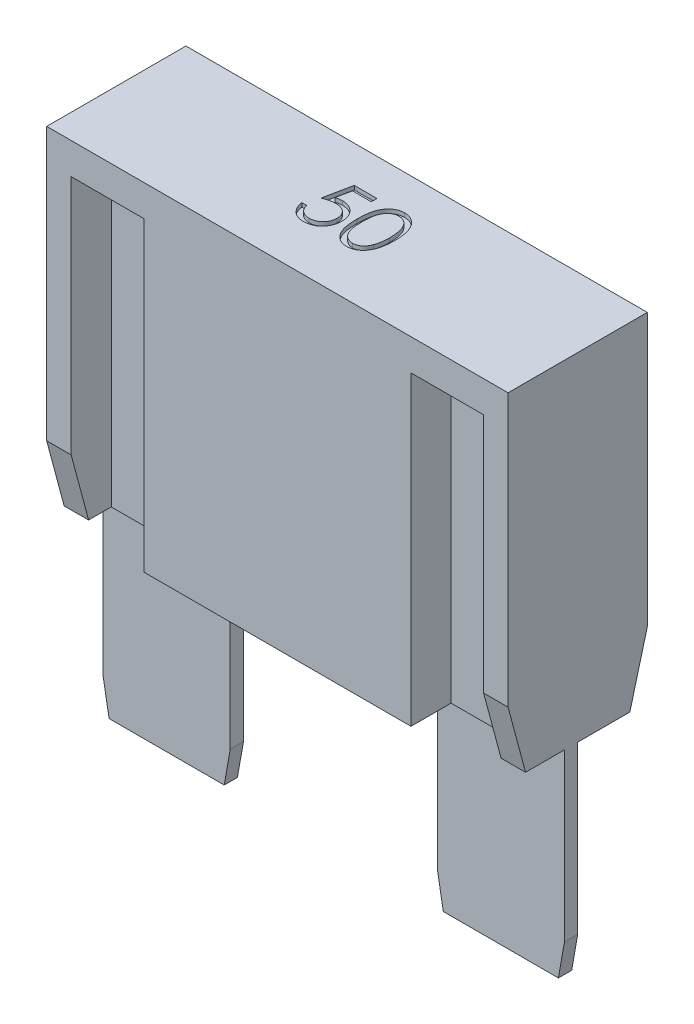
ISO-10303-21;
HEADER;
FILE_DESCRIPTION(('STEP AP214'),'2;1');
FILE_NAME('part.step','',(''),(''),'','','');
FILE_SCHEMA(('AUTOMOTIVE_DESIGN { 1 0 10303 214 1 1 1 1 }'));
ENDSEC;
DATA;
#1=APPLICATION_CONTEXT('core data for automotive mechanical design processes');
#2=APPLICATION_PROTOCOL_DEFINITION('international standard','automotive_design',2000,#1);
#3=PRODUCT_CONTEXT('',#1,'mechanical');
#4=PRODUCT('Part','Part','',(#3));
#5=PRODUCT_RELATED_PRODUCT_CATEGORY('part','',(#4));
#6=PRODUCT_DEFINITION_FORMATION('','',#4);
#7=PRODUCT_DEFINITION_CONTEXT('part definition',#1,'design');
#8=PRODUCT_DEFINITION('design','',#6,#7);
#9=PRODUCT_DEFINITION_SHAPE('','',#8);
#10=(LENGTH_UNIT() NAMED_UNIT(*) SI_UNIT(.MILLI.,.METRE.));
#11=(NAMED_UNIT(*) PLANE_ANGLE_UNIT() SI_UNIT($,.RADIAN.));
#12=(NAMED_UNIT(*) SI_UNIT($,.STERADIAN.) SOLID_ANGLE_UNIT());
#13=UNCERTAINTY_MEASURE_WITH_UNIT(LENGTH_MEASURE(1.E-05),#10,'distance_accuracy_value','');
#14=(GEOMETRIC_REPRESENTATION_CONTEXT(3) GLOBAL_UNCERTAINTY_ASSIGNED_CONTEXT((#13)) GLOBAL_UNIT_ASSIGNED_CONTEXT((#10,
#11,#12)) REPRESENTATION_CONTEXT('',''));
#15=CARTESIAN_POINT('',(0.,0.,0.));
#16=DIRECTION('',(0.,0.,1.));
#17=DIRECTION('',(1.,0.,0.));
#18=AXIS2_PLACEMENT_3D('',#15,#16,#17);
#19=CARTESIAN_POINT('',(-14.605,10.6807,4.4069));
#20=DIRECTION('',(0.,-1.,0.));
#21=DIRECTION('',(0.,0.,-1.));
#22=AXIS2_PLACEMENT_3D('',#19,#20,#21);
#23=PLANE('',#22);
#24=DIRECTION('',(1.,0.,0.));
#25=VECTOR('',#24,1.);
#26=CARTESIAN_POINT('',(-1.6324956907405,10.6807,-2.09404913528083));
#27=LINE('',#26,#25);
#28=CARTESIAN_POINT('',(-1.6324956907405,10.6807,-2.09404913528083));
#29=VERTEX_POINT('',#28);
#30=CARTESIAN_POINT('',(-0.196598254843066,10.6807,-2.09404913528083));
#31=VERTEX_POINT('',#30);
#32=EDGE_CURVE('E517',#29,#31,#27,.T.);
#33=ORIENTED_EDGE('',*,*,#32,.T.);
#34=DIRECTION('',(0.,0.,1.));
#35=VECTOR('',#34,1.);
#36=CARTESIAN_POINT('',(-0.196598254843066,10.6807,-2.09404913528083));
#37=LINE('',#36,#35);
#38=CARTESIAN_POINT('',(-0.196598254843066,10.6807,-1.73507477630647));
#39=VERTEX_POINT('',#38);
#40=EDGE_CURVE('E814',#31,#39,#37,.T.);
#41=ORIENTED_EDGE('',*,*,#40,.T.);
#42=DIRECTION('',(-1.,0.,0.));
#43=VECTOR('',#42,1.);
#44=CARTESIAN_POINT('',(-0.196598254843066,10.6807,-1.73507477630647));
#45=LINE('',#44,#43);
#46=CARTESIAN_POINT('',(-1.38710306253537,10.6807,-1.73507477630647));
#47=VERTEX_POINT('',#46);
#48=EDGE_CURVE('E817',#39,#47,#45,.T.);
#49=ORIENTED_EDGE('',*,*,#48,.T.);
#50=DIRECTION('',(-0.200705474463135,0.,0.979651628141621));
#51=VECTOR('',#50,1.);
#52=CARTESIAN_POINT('',(-1.38710306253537,10.6807,-1.73507477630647));
#53=LINE('',#52,#51);
#54=CARTESIAN_POINT('',(-1.57570482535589,10.6807,-0.814501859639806));
#55=VERTEX_POINT('',#54);
#56=EDGE_CURVE('E820',#47,#55,#53,.T.);
#57=ORIENTED_EDGE('',*,*,#56,.T.);
#58=CARTESIAN_POINT('',(-1.57570482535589,10.6807,-0.814501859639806));
#59=CARTESIAN_POINT('',(-1.53864895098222,10.6807,-0.824732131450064));
#60=CARTESIAN_POINT('',(-1.46685905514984,10.6807,-0.844551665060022));
#61=CARTESIAN_POINT('',(-1.36089919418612,10.6807,-0.866557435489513));
#62=CARTESIAN_POINT('',(-1.26030699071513,10.6807,-0.879822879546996));
#63=CARTESIAN_POINT('',(-1.19503162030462,10.6807,-0.88163419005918));
#64=CARTESIAN_POINT('',(-1.16344520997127,10.6807,-0.88251067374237));
#65=B_SPLINE_CURVE_WITH_KNOTS('',3,(#58,#59,#60,#61,#62,#63,#64),.UNSPECIFIED.,.F.,.F.,(4,1,1,1,
4),(0.,0.275068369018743,0.532901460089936,0.773973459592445,1.),.UNSPECIFIED.);
#66=CARTESIAN_POINT('',(-1.16344520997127,10.6807,-0.88251067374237));
#67=VERTEX_POINT('',#66);
#68=EDGE_CURVE('E823',#55,#67,#65,.T.);
#69=ORIENTED_EDGE('',*,*,#68,.T.);
#70=CARTESIAN_POINT('',(-1.16344520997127,10.6807,-0.88251067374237));
#71=CARTESIAN_POINT('',(-1.12436147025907,10.6807,-0.881664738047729));
#72=CARTESIAN_POINT('',(-1.04751307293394,10.6807,-0.880001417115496));
#73=CARTESIAN_POINT('',(-0.935074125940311,10.6807,-0.864029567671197));
#74=CARTESIAN_POINT('',(-0.827741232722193,10.6807,-0.838889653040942));
#75=CARTESIAN_POINT('',(-0.725738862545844,10.6807,-0.80376913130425));
#76=CARTESIAN_POINT('',(-0.628878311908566,10.6807,-0.758859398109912));
#77=CARTESIAN_POINT('',(-0.538050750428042,10.6807,-0.702759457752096));
#78=CARTESIAN_POINT('',(-0.451892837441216,10.6807,-0.637226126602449));
#79=CARTESIAN_POINT('',(-0.371950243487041,10.6807,-0.56188111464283));
#80=CARTESIAN_POINT('',(-0.299425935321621,10.6807,-0.478959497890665));
#81=CARTESIAN_POINT('',(-0.235659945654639,10.6807,-0.389801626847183));
#82=CARTESIAN_POINT('',(-0.181497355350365,10.6807,-0.295273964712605));
#83=CARTESIAN_POINT('',(-0.137936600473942,10.6807,-0.194473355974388));
#84=CARTESIAN_POINT('',(-0.103152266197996,10.6807,-0.0885142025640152));
#85=CARTESIAN_POINT('',(-0.08000027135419,10.6807,0.0237183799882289));
#86=CARTESIAN_POINT('',(-0.0645835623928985,10.6807,0.141166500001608));
#87=CARTESIAN_POINT('',(-0.0628611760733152,10.6807,0.221471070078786));
#88=CARTESIAN_POINT('',(-0.0619828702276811,10.6807,0.262421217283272));
#89=B_SPLINE_CURVE_WITH_KNOTS('',3,(#70,#71,#72,#73,#74,#75,#76,#77,#78,#79,#80,#81,#82,#83,#84,
#85,#86,#87,#88),.UNSPECIFIED.,.F.,.F.,(4,1,1,1,1,1,1,1,1,1,1,1,1,1,1,1,4),(0.,
0.0658076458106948,0.129394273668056,0.19089406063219,0.251281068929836,0.310814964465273,
0.370370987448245,0.430768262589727,0.492881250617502,0.55510394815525,0.616067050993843,
0.677256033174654,0.738259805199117,0.800762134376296,0.864777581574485,0.931045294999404,1.),.UNSPECIFIED.);
#90=CARTESIAN_POINT('',(-0.0619828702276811,10.6807,0.262421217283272));
#91=VERTEX_POINT('',#90);
#92=EDGE_CURVE('E828',#67,#91,#89,.T.);
#93=ORIENTED_EDGE('',*,*,#92,.T.);
#94=CARTESIAN_POINT('',(-0.0619828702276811,10.6807,0.262421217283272));
#95=CARTESIAN_POINT('',(-0.0626479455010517,10.6807,0.290943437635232));
#96=CARTESIAN_POINT('',(-0.063969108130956,10.6807,0.347602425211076));
#97=CARTESIAN_POINT('',(-0.0706876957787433,10.6807,0.431746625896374));
#98=CARTESIAN_POINT('',(-0.0836234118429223,10.6807,0.514109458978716));
#99=CARTESIAN_POINT('',(-0.100991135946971,10.6807,0.594701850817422));
#100=CARTESIAN_POINT('',(-0.123533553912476,10.6807,0.673371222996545));
#101=CARTESIAN_POINT('',(-0.150822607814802,10.6807,0.750342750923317));
#102=CARTESIAN_POINT('',(-0.184218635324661,10.6807,0.825137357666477));
#103=CARTESIAN_POINT('',(-0.220850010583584,10.6807,0.898462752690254));
#104=CARTESIAN_POINT('',(-0.2620964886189,10.6807,0.968661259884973));
#105=CARTESIAN_POINT('',(-0.307874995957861,10.6807,1.03431024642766));
#106=CARTESIAN_POINT('',(-0.35624048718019,10.6807,1.0963945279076));
#107=CARTESIAN_POINT('',(-0.408281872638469,10.6807,1.15424826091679));
#108=CARTESIAN_POINT('',(-0.464482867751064,10.6807,1.20749127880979));
#109=CARTESIAN_POINT('',(-0.524162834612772,10.6807,1.25643956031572));
#110=CARTESIAN_POINT('',(-0.586845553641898,10.6807,1.30192089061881));
#111=CARTESIAN_POINT('',(-0.653500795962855,10.6807,1.34208908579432));
#112=CARTESIAN_POINT('',(-0.72264327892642,10.6807,1.37905204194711));
#113=CARTESIAN_POINT('',(-0.795271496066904,10.6807,1.40937557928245));
#114=CARTESIAN_POINT('',(-0.869732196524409,10.6807,1.4364861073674));
#115=CARTESIAN_POINT('',(-0.947097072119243,10.6807,1.458095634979));
#116=CARTESIAN_POINT('',(-1.02719088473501,10.6807,1.47502818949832));
#117=CARTESIAN_POINT('',(-1.1101456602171,10.6807,1.48652879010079));
#118=CARTESIAN_POINT('',(-1.19552633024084,10.6807,1.49490522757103));
#119=CARTESIAN_POINT('',(-1.25340134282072,10.6807,1.49542958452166));
#120=CARTESIAN_POINT('',(-1.28263591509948,10.6807,1.49569445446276));
#121=B_SPLINE_CURVE_WITH_KNOTS('',3,(#94,#95,#96,#97,#98,#99,#100,#101,#102,#103,#104,#105,#106,
#107,#108,#109,#110,#111,#112,#113,#114,#115,#116,#117,#118,#119,#120),.UNSPECIFIED.,.F.,.F.,(4,
1,1,1,1,1,1,1,1,1,1,1,1,1,1,1,1,1,1,1,1,1,1,1,4),(0.,0.04401447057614,0.0874341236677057,
0.130118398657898,0.172553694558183,0.214554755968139,0.256298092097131,0.29843822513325,
0.340849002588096,0.382715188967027,0.423924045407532,0.464246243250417,0.504073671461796,
0.543861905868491,0.583566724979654,0.623094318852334,0.663229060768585,0.70355125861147,
0.743937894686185,0.784541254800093,0.825750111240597,0.867757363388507,0.91074516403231,
0.954914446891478,1.),.UNSPECIFIED.);
#122=CARTESIAN_POINT('',(-1.28263591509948,10.6807,1.49569445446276));
#123=VERTEX_POINT('',#122);
#124=EDGE_CURVE('E836',#91,#123,#121,.T.);
#125=ORIENTED_EDGE('',*,*,#124,.T.);
#126=CARTESIAN_POINT('',(-1.28263591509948,10.6807,1.49569445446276));
#127=CARTESIAN_POINT('',(-1.31751009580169,10.6807,1.4950036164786));
#128=CARTESIAN_POINT('',(-1.38612092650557,10.6807,1.49364447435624));
#129=CARTESIAN_POINT('',(-1.48664149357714,10.6807,1.47942598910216));
#130=CARTESIAN_POINT('',(-1.5833560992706,10.6807,1.45906207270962));
#131=CARTESIAN_POINT('',(-1.67548620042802,10.6807,1.42842580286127));
#132=CARTESIAN_POINT('',(-1.76385746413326,10.6807,1.39003850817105));
#133=CARTESIAN_POINT('',(-1.84728018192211,10.6807,1.34152233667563));
#134=CARTESIAN_POINT('',(-1.92788595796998,10.6807,1.28654323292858));
#135=CARTESIAN_POINT('',(-2.00239799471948,10.6807,1.22166287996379));
#136=CARTESIAN_POINT('',(-2.07155410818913,10.6807,1.15074719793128));
#137=CARTESIAN_POINT('',(-2.13346061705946,10.6807,1.07378955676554));
#138=CARTESIAN_POINT('',(-2.18859419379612,10.6807,0.992060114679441));
#139=CARTESIAN_POINT('',(-2.23607194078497,10.6807,0.905161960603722));
#140=CARTESIAN_POINT('',(-2.27656996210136,10.6807,0.813323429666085));
#141=CARTESIAN_POINT('',(-2.30838495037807,10.6807,0.716200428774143));
#142=CARTESIAN_POINT('',(-2.33406330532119,10.6807,0.614300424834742));
#143=CARTESIAN_POINT('',(-2.34492672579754,10.6807,0.544146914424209));
#144=CARTESIAN_POINT('',(-2.35044440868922,10.6807,0.508514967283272));
#145=B_SPLINE_CURVE_WITH_KNOTS('',3,(#126,#127,#128,#129,#130,#131,#132,#133,#134,#135,#136,
#137,#138,#139,#140,#141,#142,#143,#144),.UNSPECIFIED.,.F.,.F.,(4,1,1,1,1,1,1,1,1,1,1,1,1,1,1,1,
4),(0.,0.0654211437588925,0.128708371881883,0.190236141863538,0.250724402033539,
0.310637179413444,0.370766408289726,0.431614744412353,0.493522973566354,0.555883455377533,
0.61734236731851,0.678668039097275,0.740711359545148,0.802985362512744,0.866802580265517,
0.932347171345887,1.),.UNSPECIFIED.);
#146=CARTESIAN_POINT('',(-2.35044440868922,10.6807,0.508514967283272));
#147=VERTEX_POINT('',#146);
#148=EDGE_CURVE('E844',#123,#147,#145,.T.);
#149=ORIENTED_EDGE('',*,*,#148,.T.);
#150=DIRECTION('',(1.,0.,0.));
#151=VECTOR('',#150,1.);
#152=CARTESIAN_POINT('',(-2.35044440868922,10.6807,0.508514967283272));
#153=LINE('',#152,#151);
#154=CARTESIAN_POINT('',(-2.03634184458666,10.6807,0.508514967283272));
#155=VERTEX_POINT('',#154);
#156=EDGE_CURVE('E852',#147,#155,#153,.T.);
#157=ORIENTED_EDGE('',*,*,#156,.T.);
#158=CARTESIAN_POINT('',(-2.03634184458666,10.6807,0.508514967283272));
#159=CARTESIAN_POINT('',(-2.02861328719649,10.6807,0.541891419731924));
#160=CARTESIAN_POINT('',(-2.01375857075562,10.6807,0.606042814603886));
#161=CARTESIAN_POINT('',(-1.98115282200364,10.6807,0.696174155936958));
#162=CARTESIAN_POINT('',(-1.94128694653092,10.6807,0.776493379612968));
#163=CARTESIAN_POINT('',(-1.89388259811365,10.6807,0.848062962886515));
#164=CARTESIAN_POINT('',(-1.83733256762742,10.6807,0.910471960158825));
#165=CARTESIAN_POINT('',(-1.77280313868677,10.6807,0.966089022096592));
#166=CARTESIAN_POINT('',(-1.70045541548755,10.6807,1.01626415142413));
#167=CARTESIAN_POINT('',(-1.62006218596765,10.6807,1.05808691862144));
#168=CARTESIAN_POINT('',(-1.53524910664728,10.6807,1.09375567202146));
#169=CARTESIAN_POINT('',(-1.44648189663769,10.6807,1.11750736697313));
#170=CARTESIAN_POINT('',(-1.3561775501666,10.6807,1.13420825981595));
#171=CARTESIAN_POINT('',(-1.29509917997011,10.6807,1.1358800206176));
#172=CARTESIAN_POINT('',(-1.26440674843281,10.6807,1.1367200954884));
#173=B_SPLINE_CURVE_WITH_KNOTS('',3,(#158,#159,#160,#161,#162,#163,#164,#165,#166,#167,#168,
#169,#170,#171,#172),.UNSPECIFIED.,.F.,.F.,(4,1,1,1,1,1,1,1,1,1,1,1,4),(0.,0.094687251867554,
0.181994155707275,0.264376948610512,0.342179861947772,0.418617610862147,0.496509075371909,
0.577369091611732,0.661510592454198,0.746732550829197,0.831257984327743,0.915205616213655,1.),.UNSPECIFIED.);
#174=CARTESIAN_POINT('',(-1.26440674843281,10.6807,1.1367200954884));
#175=VERTEX_POINT('',#174);
#176=EDGE_CURVE('E858',#155,#175,#173,.T.);
#177=ORIENTED_EDGE('',*,*,#176,.T.);
#178=CARTESIAN_POINT('',(-1.26440674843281,10.6807,1.1367200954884));
#179=CARTESIAN_POINT('',(-1.23444830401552,10.6807,1.1358993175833));
#180=CARTESIAN_POINT('',(-1.17545988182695,10.6807,1.13428319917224));
#181=CARTESIAN_POINT('',(-1.08864849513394,10.6807,1.12184418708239));
#182=CARTESIAN_POINT('',(-1.0048356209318,10.6807,1.10268661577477));
#183=CARTESIAN_POINT('',(-0.92484826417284,10.6807,1.074016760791));
#184=CARTESIAN_POINT('',(-0.847286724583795,10.6807,1.03917204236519));
#185=CARTESIAN_POINT('',(-0.774112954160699,10.6807,0.994456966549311));
#186=CARTESIAN_POINT('',(-0.703210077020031,10.6807,0.942996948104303));
#187=CARTESIAN_POINT('',(-0.636781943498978,10.6807,0.884040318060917));
#188=CARTESIAN_POINT('',(-0.575942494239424,10.6807,0.819070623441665));
#189=CARTESIAN_POINT('',(-0.522186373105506,10.6807,0.749593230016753));
#190=CARTESIAN_POINT('',(-0.477409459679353,10.6807,0.675476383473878));
#191=CARTESIAN_POINT('',(-0.439675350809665,10.6807,0.598003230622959));
#192=CARTESIAN_POINT('',(-0.411022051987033,10.6807,0.516324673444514));
#193=CARTESIAN_POINT('',(-0.39058107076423,10.6807,0.430823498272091));
#194=CARTESIAN_POINT('',(-0.378578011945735,10.6807,0.341288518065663));
#195=CARTESIAN_POINT('',(-0.376926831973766,10.6807,0.280219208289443));
#196=CARTESIAN_POINT('',(-0.376085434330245,10.6807,0.249099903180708));
#197=B_SPLINE_CURVE_WITH_KNOTS('',3,(#178,#179,#180,#181,#182,#183,#184,#185,#186,#187,#188,
#189,#190,#191,#192,#193,#194,#195,#196),.UNSPECIFIED.,.F.,.F.,(4,1,1,1,1,1,1,1,1,1,1,1,1,1,1,1,
4),(0.,0.0642072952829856,0.126424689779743,0.187680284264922,0.248216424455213,
0.308305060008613,0.369660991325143,0.43169855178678,0.495946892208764,0.55975802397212,
0.622295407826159,0.683910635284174,0.745092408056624,0.806740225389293,0.869086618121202,
0.933290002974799,1.),.UNSPECIFIED.);
#198=CARTESIAN_POINT('',(-0.376085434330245,10.6807,0.249099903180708));
#199=VERTEX_POINT('',#198);
#200=EDGE_CURVE('E863',#175,#199,#197,.T.);
#201=ORIENTED_EDGE('',*,*,#200,.T.);
#202=CARTESIAN_POINT('',(-0.376085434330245,10.6807,0.249099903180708));
#203=CARTESIAN_POINT('',(-0.376743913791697,10.6807,0.22102415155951));
#204=CARTESIAN_POINT('',(-0.378032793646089,10.6807,0.166069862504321));
#205=CARTESIAN_POINT('',(-0.388563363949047,10.6807,0.0856706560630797));
#206=CARTESIAN_POINT('',(-0.406880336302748,10.6807,0.00959761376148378));
#207=CARTESIAN_POINT('',(-0.432304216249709,10.6807,-0.0625166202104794));
#208=CARTESIAN_POINT('',(-0.464583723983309,10.6807,-0.130740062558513));
#209=CARTESIAN_POINT('',(-0.504030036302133,10.6807,-0.195143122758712));
#210=CARTESIAN_POINT('',(-0.551383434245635,10.6807,-0.254876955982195));
#211=CARTESIAN_POINT('',(-0.605475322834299,10.6807,-0.309969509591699));
#212=CARTESIAN_POINT('',(-0.664733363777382,10.6807,-0.360814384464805));
#213=CARTESIAN_POINT('',(-0.730177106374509,10.6807,-0.404158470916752));
#214=CARTESIAN_POINT('',(-0.800437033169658,10.6807,-0.440622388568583));
#215=CARTESIAN_POINT('',(-0.874666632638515,10.6807,-0.472090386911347));
#216=CARTESIAN_POINT('',(-0.954631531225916,10.6807,-0.494691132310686));
#217=CARTESIAN_POINT('',(-1.03874816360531,10.6807,-0.511659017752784));
#218=CARTESIAN_POINT('',(-1.12792487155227,10.6807,-0.521474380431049));
#219=CARTESIAN_POINT('',(-1.18889555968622,10.6807,-0.522836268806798));
#220=CARTESIAN_POINT('',(-1.22023607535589,10.6807,-0.523536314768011));
#221=B_SPLINE_CURVE_WITH_KNOTS('',3,(#202,#203,#204,#205,#206,#207,#208,#209,#210,#211,#212,
#213,#214,#215,#216,#217,#218,#219,#220),.UNSPECIFIED.,.F.,.F.,(4,1,1,1,1,1,1,1,1,1,1,1,1,1,1,1,
4),(0.,0.0653513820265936,0.127916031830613,0.1883602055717,0.247216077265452,0.305630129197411,
0.363769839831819,0.42266091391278,0.482687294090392,0.543300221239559,0.604117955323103,
0.664964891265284,0.727413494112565,0.791467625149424,0.8580554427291,0.927036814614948,1.),.UNSPECIFIED.);
#222=CARTESIAN_POINT('',(-1.22023607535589,10.6807,-0.523536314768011));
#223=VERTEX_POINT('',#222);
#224=EDGE_CURVE('E871',#199,#223,#221,.T.);
#225=ORIENTED_EDGE('',*,*,#224,.T.);
#226=CARTESIAN_POINT('',(-1.22023607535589,10.6807,-0.523536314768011));
#227=CARTESIAN_POINT('',(-1.24736500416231,10.6807,-0.522955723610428));
#228=CARTESIAN_POINT('',(-1.30337935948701,10.6807,-0.521756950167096));
#229=CARTESIAN_POINT('',(-1.38930218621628,10.6807,-0.512930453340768));
#230=CARTESIAN_POINT('',(-1.479593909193,10.6807,-0.49869115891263));
#231=CARTESIAN_POINT('',(-1.5739084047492,10.6807,-0.479104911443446));
#232=CARTESIAN_POINT('',(-1.67252891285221,10.6807,-0.453473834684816));
#233=CARTESIAN_POINT('',(-1.77524731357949,10.6807,-0.422759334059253));
#234=CARTESIAN_POINT('',(-1.88227958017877,10.6807,-0.386037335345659));
#235=CARTESIAN_POINT('',(-1.95439730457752,10.6807,-0.358305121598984));
#236=CARTESIAN_POINT('',(-1.99147004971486,10.6807,-0.344049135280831));
#237=B_SPLINE_CURVE_WITH_KNOTS('',3,(#226,#227,#228,#229,#230,#231,#232,#233,#234,#235,#236),
.UNSPECIFIED.,.F.,.F.,(4,1,1,1,1,1,1,1,4),(0.,0.10220303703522,0.211023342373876,
0.325099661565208,0.446502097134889,0.573787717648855,0.708900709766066,0.850357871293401,1.),.UNSPECIFIED.);
#238=CARTESIAN_POINT('',(-1.99147004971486,10.6807,-0.344049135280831));
#239=VERTEX_POINT('',#238);
#240=EDGE_CURVE('E879',#223,#239,#237,.T.);
#241=ORIENTED_EDGE('',*,*,#240,.T.);
#242=DIRECTION('',(0.200944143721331,0.,-0.97960270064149));
#243=VECTOR('',#242,1.);
#244=CARTESIAN_POINT('',(-1.99147004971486,10.6807,-0.344049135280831));
#245=LINE('',#244,#243);
#246=EDGE_CURVE('E522',#239,#29,#245,.T.);
#247=ORIENTED_EDGE('',*,*,#246,.T.);
#248=EDGE_LOOP('',(#33,#41,#49,#57,#69,#93,#125,#149,#157,#177,#201,#225,#241,#247));
#249=FACE_BOUND('',#248,.T.);
#250=DIRECTION('',(-1.,0.,0.));
#251=VECTOR('',#250,1.);
#252=CARTESIAN_POINT('',(-14.605,10.6807,-4.4069));
#253=LINE('',#252,#251);
#254=CARTESIAN_POINT('',(14.605,10.6807,-4.4069));
#255=VERTEX_POINT('',#254);
#256=CARTESIAN_POINT('',(-14.605,10.6807,-4.4069));
#257=VERTEX_POINT('',#256);
#258=EDGE_CURVE('E1043',#255,#257,#253,.T.);
#259=ORIENTED_EDGE('',*,*,#258,.T.);
#260=DIRECTION('',(0.,0.,-1.));
#261=VECTOR('',#260,1.);
#262=CARTESIAN_POINT('',(-14.605,10.6807,4.4069));
#263=LINE('',#262,#261);
#264=CARTESIAN_POINT('',(-14.605,10.6807,4.4069));
#265=VERTEX_POINT('',#264);
#266=EDGE_CURVE('E41',#265,#257,#263,.T.);
#267=ORIENTED_EDGE('',*,*,#266,.F.);
#268=DIRECTION('',(-1.,0.,0.));
#269=VECTOR('',#268,1.);
#270=CARTESIAN_POINT('',(-14.605,10.6807,4.4069));
#271=LINE('',#270,#269);
#272=CARTESIAN_POINT('',(14.605,10.6807,4.4069));
#273=VERTEX_POINT('',#272);
#274=EDGE_CURVE('E1054',#273,#265,#271,.T.);
#275=ORIENTED_EDGE('',*,*,#274,.F.);
#276=DIRECTION('',(0.,0.,-1.));
#277=VECTOR('',#276,1.);
#278=CARTESIAN_POINT('',(14.605,10.6807,4.4069));
#279=LINE('',#278,#277);
#280=EDGE_CURVE('E11',#273,#255,#279,.T.);
#281=ORIENTED_EDGE('',*,*,#280,.T.);
#282=EDGE_LOOP('',(#259,#267,#275,#281));
#283=FACE_BOUND('',#282,.T.);
#284=CARTESIAN_POINT('',(1.4671637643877,10.6807,1.49569445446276));
#285=CARTESIAN_POINT('',(1.43955965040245,10.6807,1.49522809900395));
#286=CARTESIAN_POINT('',(1.38512972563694,10.6807,1.49430853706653));
#287=CARTESIAN_POINT('',(1.30447730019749,10.6807,1.48479480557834));
#288=CARTESIAN_POINT('',(1.22619485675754,10.6807,1.46949930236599));
#289=CARTESIAN_POINT('',(1.14989610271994,10.6807,1.44808269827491));
#290=CARTESIAN_POINT('',(1.07518958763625,10.6807,1.42186786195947));
#291=CARTESIAN_POINT('',(1.00309330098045,10.6807,1.38771417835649));
#292=CARTESIAN_POINT('',(0.93280561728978,10.6807,1.34838010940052));
#293=CARTESIAN_POINT('',(0.864514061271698,10.6807,1.30358468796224));
#294=CARTESIAN_POINT('',(0.799501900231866,10.6807,1.25226300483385));
#295=CARTESIAN_POINT('',(0.737403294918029,10.6807,1.19549871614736));
#296=CARTESIAN_POINT('',(0.679778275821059,10.6807,1.13187530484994));
#297=CARTESIAN_POINT('',(0.626144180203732,10.6807,1.06239738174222));
#298=CARTESIAN_POINT('',(0.575170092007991,10.6807,0.98770413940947));
#299=CARTESIAN_POINT('',(0.528280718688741,10.6807,0.906775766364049));
#300=CARTESIAN_POINT('',(0.484909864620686,10.6807,0.819933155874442));
#301=CARTESIAN_POINT('',(0.445266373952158,10.6807,0.726615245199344));
#302=CARTESIAN_POINT('',(0.41011771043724,10.6807,0.625460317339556));
#303=CARTESIAN_POINT('',(0.379070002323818,10.6807,0.515311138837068));
#304=CARTESIAN_POINT('',(0.354555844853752,10.6807,0.395195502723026));
#305=CARTESIAN_POINT('',(0.333572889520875,10.6807,0.266078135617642));
#306=CARTESIAN_POINT('',(0.316648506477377,10.6807,0.127404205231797));
#307=CARTESIAN_POINT('',(0.305094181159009,10.6807,-0.0209015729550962));
#308=CARTESIAN_POINT('',(0.297952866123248,10.6807,-0.178746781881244));
#309=CARTESIAN_POINT('',(0.29731779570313,10.6807,-0.287016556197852));
#310=CARTESIAN_POINT('',(0.296991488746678,10.6807,-0.342646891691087));
#311=B_SPLINE_CURVE_WITH_KNOTS('',3,(#284,#285,#286,#287,#288,#289,#290,#291,#292,#293,#294,
#295,#296,#297,#298,#299,#300,#301,#302,#303,#304,#305,#306,#307,#308,#309,#310),.UNSPECIFIED.,
.F.,.F.,(4,1,1,1,1,1,1,1,1,1,1,1,1,1,1,1,1,1,1,1,1,1,1,1,4),(0.,0.0337871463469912,
0.066621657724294,0.0992848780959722,0.131361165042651,0.163585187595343,0.196103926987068,
0.228902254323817,0.262158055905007,0.295991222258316,0.3302178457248,0.365059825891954,
0.400950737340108,0.437620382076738,0.475707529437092,0.515380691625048,0.556413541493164,
0.599764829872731,0.646424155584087,0.696431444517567,0.749781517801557,0.806573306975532,
0.867435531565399,0.931886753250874,1.),.UNSPECIFIED.);
#312=CARTESIAN_POINT('',(1.4671637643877,10.6807,1.49569445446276));
#313=VERTEX_POINT('',#312);
#314=CARTESIAN_POINT('',(0.296991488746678,10.6807,-0.342646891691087));
#315=VERTEX_POINT('',#314);
#316=EDGE_CURVE('E49',#313,#315,#311,.T.);
#317=ORIENTED_EDGE('',*,*,#316,.T.);
#318=CARTESIAN_POINT('',(0.296991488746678,10.6807,-0.342646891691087));
#319=CARTESIAN_POINT('',(0.297319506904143,10.6807,-0.398744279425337));
#320=CARTESIAN_POINT('',(0.297956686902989,10.6807,-0.507714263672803));
#321=CARTESIAN_POINT('',(0.30504510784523,10.6807,-0.666498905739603));
#322=CARTESIAN_POINT('',(0.316820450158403,10.6807,-0.815459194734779));
#323=CARTESIAN_POINT('',(0.332957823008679,10.6807,-0.954602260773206));
#324=CARTESIAN_POINT('',(0.352595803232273,10.6807,-1.08396402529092));
#325=CARTESIAN_POINT('',(0.378811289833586,10.6807,-1.20319878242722));
#326=CARTESIAN_POINT('',(0.40862409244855,10.6807,-1.31285838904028));
#327=CARTESIAN_POINT('',(0.443176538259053,10.6807,-1.4133004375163));
#328=CARTESIAN_POINT('',(0.482164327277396,10.6807,-1.50587814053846));
#329=CARTESIAN_POINT('',(0.524598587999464,10.6807,-1.59230334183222));
#330=CARTESIAN_POINT('',(0.572163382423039,10.6807,-1.672445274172));
#331=CARTESIAN_POINT('',(0.622140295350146,10.6807,-1.74758306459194));
#332=CARTESIAN_POINT('',(0.676552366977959,10.6807,-1.81648675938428));
#333=CARTESIAN_POINT('',(0.733851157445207,10.6807,-1.88012942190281));
#334=CARTESIAN_POINT('',(0.796273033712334,10.6807,-1.93704017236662));
#335=CARTESIAN_POINT('',(0.861696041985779,10.6807,-1.98888647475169));
#336=CARTESIAN_POINT('',(0.930712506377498,10.6807,-2.03433594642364));
#337=CARTESIAN_POINT('',(1.0013551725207,10.6807,-2.0743686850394));
#338=CARTESIAN_POINT('',(1.07411027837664,10.6807,-2.108568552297));
#339=CARTESIAN_POINT('',(1.14917646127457,10.6807,-2.13545898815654));
#340=CARTESIAN_POINT('',(1.22587901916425,10.6807,-2.15766983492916));
#341=CARTESIAN_POINT('',(1.30448608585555,10.6807,-2.17285878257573));
#342=CARTESIAN_POINT('',(1.38512744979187,10.6807,-2.18241569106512));
#343=CARTESIAN_POINT('',(1.43955888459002,10.6807,-2.18332935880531));
#344=CARTESIAN_POINT('',(1.4671637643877,10.6807,-2.18379272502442));
#345=B_SPLINE_CURVE_WITH_KNOTS('',3,(#318,#319,#320,#321,#322,#323,#324,#325,#326,#327,#328,
#329,#330,#331,#332,#333,#334,#335,#336,#337,#338,#339,#340,#341,#342,#343,#344),.UNSPECIFIED.,
.F.,.F.,(4,1,1,1,1,1,1,1,1,1,1,1,1,1,1,1,1,1,1,1,1,1,1,1,4),(0.,0.0685946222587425,
0.133246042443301,0.194312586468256,0.251279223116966,0.304513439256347,0.354234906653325,
0.400480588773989,0.443410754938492,0.484014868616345,0.523252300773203,0.56104237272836,
0.5979002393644,0.633518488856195,0.668314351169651,0.702495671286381,0.736685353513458,
0.770293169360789,0.803437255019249,0.835912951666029,0.868460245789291,0.900846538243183,
0.933466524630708,0.966257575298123,1.),.UNSPECIFIED.);
#346=CARTESIAN_POINT('',(1.4671637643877,10.6807,-2.18379272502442));
#347=VERTEX_POINT('',#346);
#348=EDGE_CURVE('E482',#315,#347,#345,.T.);
#349=ORIENTED_EDGE('',*,*,#348,.T.);
#350=CARTESIAN_POINT('',(1.4671637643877,10.6807,-2.18379272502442));
#351=CARTESIAN_POINT('',(1.49499924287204,10.6807,-2.18330490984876));
#352=CARTESIAN_POINT('',(1.55035525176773,10.6807,-2.18233479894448));
#353=CARTESIAN_POINT('',(1.63219562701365,10.6807,-2.17301085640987));
#354=CARTESIAN_POINT('',(1.71214530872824,10.6807,-2.15753973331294));
#355=CARTESIAN_POINT('',(1.78986344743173,10.6807,-2.13561875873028));
#356=CARTESIAN_POINT('',(1.8659884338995,10.6807,-2.10842308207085));
#357=CARTESIAN_POINT('',(1.93992484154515,10.6807,-2.07433596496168));
#358=CARTESIAN_POINT('',(2.0121319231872,10.6807,-2.03465709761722));
#359=CARTESIAN_POINT('',(2.0814622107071,10.6807,-1.98803322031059));
#360=CARTESIAN_POINT('',(2.14867682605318,10.6807,-1.93605094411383));
#361=CARTESIAN_POINT('',(2.21212478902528,10.6807,-1.87728827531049));
#362=CARTESIAN_POINT('',(2.27181187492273,10.6807,-1.81233855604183));
#363=CARTESIAN_POINT('',(2.32848718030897,10.6807,-1.74189669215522));
#364=CARTESIAN_POINT('',(2.38054277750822,10.6807,-1.66461160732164));
#365=CARTESIAN_POINT('',(2.43011620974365,10.6807,-1.58182749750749));
#366=CARTESIAN_POINT('',(2.47448824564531,10.6807,-1.49209663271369));
#367=CARTESIAN_POINT('',(2.5172229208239,10.6807,-1.39691616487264));
#368=CARTESIAN_POINT('',(2.55410990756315,10.6807,-1.29365250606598));
#369=CARTESIAN_POINT('',(2.58737615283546,10.6807,-1.18288774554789));
#370=CARTESIAN_POINT('',(2.6142551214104,10.6807,-1.06331355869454));
#371=CARTESIAN_POINT('',(2.63664439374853,10.6807,-0.935557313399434));
#372=CARTESIAN_POINT('',(2.65398928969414,10.6807,-0.799149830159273));
#373=CARTESIAN_POINT('',(2.66662193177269,10.6807,-0.654383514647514));
#374=CARTESIAN_POINT('',(2.67329501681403,10.6807,-0.501163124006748));
#375=CARTESIAN_POINT('',(2.6745517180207,10.6807,-0.396405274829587));
#376=CARTESIAN_POINT('',(2.67519661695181,10.6807,-0.342646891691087));
#377=B_SPLINE_CURVE_WITH_KNOTS('',3,(#350,#351,#352,#353,#354,#355,#356,#357,#358,#359,#360,
#361,#362,#363,#364,#365,#366,#367,#368,#369,#370,#371,#372,#373,#374,#375,#376),.UNSPECIFIED.,
.F.,.F.,(4,1,1,1,1,1,1,1,1,1,1,1,1,1,1,1,1,1,1,1,1,1,1,1,4),(0.,0.0337881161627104,
0.0671939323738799,0.0998624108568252,0.132566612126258,0.165151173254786,0.197913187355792,
0.231319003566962,0.265083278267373,0.299255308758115,0.334398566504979,0.369942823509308,
0.406283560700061,0.444063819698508,0.482997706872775,0.523354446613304,0.565536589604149,
0.609612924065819,0.656390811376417,0.705885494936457,0.758324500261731,0.81383178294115,
0.87279455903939,0.934722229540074,1.),.UNSPECIFIED.);
#378=CARTESIAN_POINT('',(2.67519661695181,10.6807,-0.342646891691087));
#379=VERTEX_POINT('',#378);
#380=EDGE_CURVE('E490',#347,#379,#377,.T.);
#381=ORIENTED_EDGE('',*,*,#380,.T.);
#382=CARTESIAN_POINT('',(2.67519661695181,10.6807,-0.342646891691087));
#383=CARTESIAN_POINT('',(2.67454503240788,10.6807,-0.289122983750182));
#384=CARTESIAN_POINT('',(2.67327544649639,10.6807,-0.184833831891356));
#385=CARTESIAN_POINT('',(2.66669673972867,10.6807,-0.0323028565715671));
#386=CARTESIAN_POINT('',(2.65373810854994,10.6807,0.111695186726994));
#387=CARTESIAN_POINT('',(2.63752812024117,10.6807,0.247505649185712));
#388=CARTESIAN_POINT('',(2.61507715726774,10.6807,0.374563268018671));
#389=CARTESIAN_POINT('',(2.58747199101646,10.6807,0.49330771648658));
#390=CARTESIAN_POINT('',(2.55682166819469,10.6807,0.604251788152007));
#391=CARTESIAN_POINT('',(2.51898687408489,10.6807,0.706486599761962));
#392=CARTESIAN_POINT('',(2.47757616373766,10.6807,0.801438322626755));
#393=CARTESIAN_POINT('',(2.43252096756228,10.6807,0.89010547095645));
#394=CARTESIAN_POINT('',(2.3842511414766,10.6807,0.973271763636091));
#395=CARTESIAN_POINT('',(2.33166239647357,10.6807,1.05027151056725));
#396=CARTESIAN_POINT('',(2.27560898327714,10.6807,1.12165016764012));
#397=CARTESIAN_POINT('',(2.21489119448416,10.6807,1.18614779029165));
#398=CARTESIAN_POINT('',(2.15122060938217,10.6807,1.2453184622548));
#399=CARTESIAN_POINT('',(2.08380819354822,10.6807,1.29797008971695));
#400=CARTESIAN_POINT('',(2.01339664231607,10.6807,1.34405489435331));
#401=CARTESIAN_POINT('',(1.94143756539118,10.6807,1.38526874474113));
#402=CARTESIAN_POINT('',(1.8666541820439,10.6807,1.41850143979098));
#403=CARTESIAN_POINT('',(1.79074122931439,10.6807,1.44703648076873));
#404=CARTESIAN_POINT('',(1.71261286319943,10.6807,1.46883693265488));
#405=CARTESIAN_POINT('',(1.63236647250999,10.6807,1.48391078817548));
#406=CARTESIAN_POINT('',(1.5504102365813,10.6807,1.49448263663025));
#407=CARTESIAN_POINT('',(1.49500867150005,10.6807,1.49528911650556));
#408=CARTESIAN_POINT('',(1.4671637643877,10.6807,1.49569445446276));
#409=B_SPLINE_CURVE_WITH_KNOTS('',3,(#382,#383,#384,#385,#386,#387,#388,#389,#390,#391,#392,
#393,#394,#395,#396,#397,#398,#399,#400,#401,#402,#403,#404,#405,#406,#407,#408),.UNSPECIFIED.,
.F.,.F.,(4,1,1,1,1,1,1,1,1,1,1,1,1,1,1,1,1,1,1,1,1,1,1,1,4),(0.,0.0650632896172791,
0.126773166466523,0.185515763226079,0.240764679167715,0.292979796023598,0.342250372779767,
0.38891928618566,0.43277566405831,0.474628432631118,0.514774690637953,0.553605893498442,
0.591426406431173,0.628028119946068,0.663803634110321,0.698984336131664,0.733591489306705,
0.76762846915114,0.801208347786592,0.834263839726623,0.866980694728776,0.899719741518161,
0.932701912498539,0.96617588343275,1.),.UNSPECIFIED.);
#410=EDGE_CURVE('E498',#379,#313,#409,.T.);
#411=ORIENTED_EDGE('',*,*,#410,.T.);
#412=EDGE_LOOP('',(#317,#349,#381,#411));
#413=FACE_BOUND('',#412,.T.);
#414=ADVANCED_FACE('F32',(#249,#283,#413),#23,.F.);
#415=CARTESIAN_POINT('',(-14.605,-10.6807,4.4069));
#416=DIRECTION('',(0.,1.,0.));
#417=DIRECTION('',(0.,0.,1.));
#418=AXIS2_PLACEMENT_3D('',#415,#416,#417);
#419=PLANE('',#418);
#420=DIRECTION('',(-1.,0.,0.));
#421=VECTOR('',#420,1.);
#422=CARTESIAN_POINT('',(14.605,-10.6807,0.8382));
#423=LINE('',#422,#421);
#424=CARTESIAN_POINT('',(14.605,-10.6807,0.8382));
#425=VERTEX_POINT('',#424);
#426=CARTESIAN_POINT('',(6.5532,-10.6807,0.8382));
#427=VERTEX_POINT('',#426);
#428=EDGE_CURVE('E934',#425,#427,#423,.T.);
#429=ORIENTED_EDGE('',*,*,#428,.F.);
#430=DIRECTION('',(0.,0.,-1.));
#431=VECTOR('',#430,1.);
#432=CARTESIAN_POINT('',(14.605,-10.6807,4.4069));
#433=LINE('',#432,#431);
#434=CARTESIAN_POINT('',(14.605,-10.6807,3.302));
#435=VERTEX_POINT('',#434);
#436=EDGE_CURVE('E1030',#435,#425,#433,.T.);
#437=ORIENTED_EDGE('',*,*,#436,.F.);
#438=DIRECTION('',(1.,0.,0.));
#439=VECTOR('',#438,1.);
#440=CARTESIAN_POINT('',(-14.606,-10.6807,3.302));
#441=LINE('',#440,#439);
#442=CARTESIAN_POINT('',(13.0556,-10.6807,3.302));
#443=VERTEX_POINT('',#442);
#444=EDGE_CURVE('E1207',#443,#435,#441,.T.);
#445=ORIENTED_EDGE('',*,*,#444,.F.);
#446=DIRECTION('',(0.,0.,1.));
#447=VECTOR('',#446,1.);
#448=CARTESIAN_POINT('',(13.0556,-10.6807,1.8669));
#449=LINE('',#448,#447);
#450=CARTESIAN_POINT('',(13.0556,-10.6807,1.8669));
#451=VERTEX_POINT('',#450);
#452=EDGE_CURVE('E1075',#451,#443,#449,.T.);
#453=ORIENTED_EDGE('',*,*,#452,.F.);
#454=DIRECTION('',(-1.,0.,0.));
#455=VECTOR('',#454,1.);
#456=CARTESIAN_POINT('',(13.0556,-10.6807,1.8669));
#457=LINE('',#456,#455);
#458=CARTESIAN_POINT('',(8.4582,-10.6807,1.8669));
#459=VERTEX_POINT('',#458);
#460=EDGE_CURVE('E1090',#451,#459,#457,.T.);
#461=ORIENTED_EDGE('',*,*,#460,.T.);
#462=DIRECTION('',(0.,0.,1.));
#463=VECTOR('',#462,1.);
#464=CARTESIAN_POINT('',(8.4582,-10.6807,1.8669));
#465=LINE('',#464,#463);
#466=CARTESIAN_POINT('',(8.4582,-10.6807,4.4069));
#467=VERTEX_POINT('',#466);
#468=EDGE_CURVE('E1092',#459,#467,#465,.T.);
#469=ORIENTED_EDGE('',*,*,#468,.T.);
#470=DIRECTION('',(1.,0.,0.));
#471=VECTOR('',#470,1.);
#472=CARTESIAN_POINT('',(-14.605,-10.6807,4.4069));
#473=LINE('',#472,#471);
#474=CARTESIAN_POINT('',(-8.4582,-10.6807,4.4069));
#475=VERTEX_POINT('',#474);
#476=EDGE_CURVE('E1048',#475,#467,#473,.T.);
#477=ORIENTED_EDGE('',*,*,#476,.F.);
#478=DIRECTION('',(0.,0.,1.));
#479=VECTOR('',#478,1.);
#480=CARTESIAN_POINT('',(-8.4582,-10.6807,1.8669));
#481=LINE('',#480,#479);
#482=CARTESIAN_POINT('',(-8.4582,-10.6807,1.8669));
#483=VERTEX_POINT('',#482);
#484=EDGE_CURVE('E1059',#483,#475,#481,.T.);
#485=ORIENTED_EDGE('',*,*,#484,.F.);
#486=DIRECTION('',(1.,0.,0.));
#487=VECTOR('',#486,1.);
#488=CARTESIAN_POINT('',(-13.0556,-10.6807,1.8669));
#489=LINE('',#488,#487);
#490=CARTESIAN_POINT('',(-13.0556,-10.6807,1.8669));
#491=VERTEX_POINT('',#490);
#492=EDGE_CURVE('E1081',#491,#483,#489,.T.);
#493=ORIENTED_EDGE('',*,*,#492,.F.);
#494=DIRECTION('',(0.,0.,1.));
#495=VECTOR('',#494,1.);
#496=CARTESIAN_POINT('',(-13.0556,-10.6807,1.8669));
#497=LINE('',#496,#495);
#498=CARTESIAN_POINT('',(-13.0556,-10.6807,3.302));
#499=VERTEX_POINT('',#498);
#500=EDGE_CURVE('E1057',#491,#499,#497,.T.);
#501=ORIENTED_EDGE('',*,*,#500,.T.);
#502=DIRECTION('',(-1.,0.,0.));
#503=VECTOR('',#502,1.);
#504=CARTESIAN_POINT('',(14.606,-10.6807,3.302));
#505=LINE('',#504,#503);
#506=CARTESIAN_POINT('',(-14.605,-10.6807,3.302));
#507=VERTEX_POINT('',#506);
#508=EDGE_CURVE('E1027',#499,#507,#505,.T.);
#509=ORIENTED_EDGE('',*,*,#508,.T.);
#510=DIRECTION('',(0.,0.,-1.));
#511=VECTOR('',#510,1.);
#512=CARTESIAN_POINT('',(-14.605,-10.6807,4.4069));
#513=LINE('',#512,#511);
#514=CARTESIAN_POINT('',(-14.605,-10.6807,0.8382));
#515=VERTEX_POINT('',#514);
#516=EDGE_CURVE('E1024',#507,#515,#513,.T.);
#517=ORIENTED_EDGE('',*,*,#516,.T.);
#518=DIRECTION('',(-1.,0.,0.));
#519=VECTOR('',#518,1.);
#520=CARTESIAN_POINT('',(-14.605,-10.6807,0.8382));
#521=LINE('',#520,#519);
#522=CARTESIAN_POINT('',(-6.55319999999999,-10.6807,0.8382));
#523=VERTEX_POINT('',#522);
#524=EDGE_CURVE('E973',#523,#515,#521,.T.);
#525=ORIENTED_EDGE('',*,*,#524,.F.);
#526=DIRECTION('',(0.,0.,-1.));
#527=VECTOR('',#526,1.);
#528=CARTESIAN_POINT('',(-6.55319999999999,-10.6807,0.8382));
#529=LINE('',#528,#527);
#530=CARTESIAN_POINT('',(-6.55319999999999,-10.6807,0.));
#531=VERTEX_POINT('',#530);
#532=EDGE_CURVE('E986',#523,#531,#529,.T.);
#533=ORIENTED_EDGE('',*,*,#532,.T.);
#534=DIRECTION('',(-1.,0.,0.));
#535=VECTOR('',#534,1.);
#536=CARTESIAN_POINT('',(-14.605,-10.6807,0.));
#537=LINE('',#536,#535);
#538=CARTESIAN_POINT('',(-14.605,-10.6807,0.));
#539=VERTEX_POINT('',#538);
#540=EDGE_CURVE('E983',#531,#539,#537,.T.);
#541=ORIENTED_EDGE('',*,*,#540,.T.);
#542=CARTESIAN_POINT('',(-14.605,-10.6807,-3.302));
#543=VERTEX_POINT('',#542);
#544=EDGE_CURVE('E1001',#539,#543,#513,.T.);
#545=ORIENTED_EDGE('',*,*,#544,.T.);
#546=DIRECTION('',(-1.,0.,0.));
#547=VECTOR('',#546,1.);
#548=CARTESIAN_POINT('',(14.606,-10.6807,-3.302));
#549=LINE('',#548,#547);
#550=CARTESIAN_POINT('',(-13.0556,-10.6807,-3.302));
#551=VERTEX_POINT('',#550);
#552=EDGE_CURVE('E1178',#551,#543,#549,.T.);
#553=ORIENTED_EDGE('',*,*,#552,.F.);
#554=DIRECTION('',(0.,0.,-1.));
#555=VECTOR('',#554,1.);
#556=CARTESIAN_POINT('',(-13.0556,-10.6807,-1.8669));
#557=LINE('',#556,#555);
#558=CARTESIAN_POINT('',(-13.0556,-10.6807,-1.8669));
#559=VERTEX_POINT('',#558);
#560=EDGE_CURVE('E1136',#559,#551,#557,.T.);
#561=ORIENTED_EDGE('',*,*,#560,.F.);
#562=DIRECTION('',(1.,0.,0.));
#563=VECTOR('',#562,1.);
#564=CARTESIAN_POINT('',(-13.0556,-10.6807,-1.8669));
#565=LINE('',#564,#563);
#566=CARTESIAN_POINT('',(-8.4582,-10.6807,-1.8669));
#567=VERTEX_POINT('',#566);
#568=EDGE_CURVE('E1151',#559,#567,#565,.T.);
#569=ORIENTED_EDGE('',*,*,#568,.T.);
#570=DIRECTION('',(0.,0.,-1.));
#571=VECTOR('',#570,1.);
#572=CARTESIAN_POINT('',(-8.4582,-10.6807,-1.8669));
#573=LINE('',#572,#571);
#574=CARTESIAN_POINT('',(-8.4582,-10.6807,-4.4069));
#575=VERTEX_POINT('',#574);
#576=EDGE_CURVE('E1153',#567,#575,#573,.T.);
#577=ORIENTED_EDGE('',*,*,#576,.T.);
#578=DIRECTION('',(1.,0.,0.));
#579=VECTOR('',#578,1.);
#580=CARTESIAN_POINT('',(-14.605,-10.6807,-4.4069));
#581=LINE('',#580,#579);
#582=CARTESIAN_POINT('',(8.4582,-10.6807,-4.4069));
#583=VERTEX_POINT('',#582);
#584=EDGE_CURVE('E1037',#575,#583,#581,.T.);
#585=ORIENTED_EDGE('',*,*,#584,.T.);
#586=DIRECTION('',(0.,0.,-1.));
#587=VECTOR('',#586,1.);
#588=CARTESIAN_POINT('',(8.4582,-10.6807,-1.8669));
#589=LINE('',#588,#587);
#590=CARTESIAN_POINT('',(8.4582,-10.6807,-1.8669));
#591=VERTEX_POINT('',#590);
#592=EDGE_CURVE('E1119',#591,#583,#589,.T.);
#593=ORIENTED_EDGE('',*,*,#592,.F.);
#594=DIRECTION('',(-1.,0.,0.));
#595=VECTOR('',#594,1.);
#596=CARTESIAN_POINT('',(13.0556,-10.6807,-1.8669));
#597=LINE('',#596,#595);
#598=CARTESIAN_POINT('',(13.0556,-10.6807,-1.8669));
#599=VERTEX_POINT('',#598);
#600=EDGE_CURVE('E1142',#599,#591,#597,.T.);
#601=ORIENTED_EDGE('',*,*,#600,.F.);
#602=DIRECTION('',(0.,0.,-1.));
#603=VECTOR('',#602,1.);
#604=CARTESIAN_POINT('',(13.0556,-10.6807,-1.8669));
#605=LINE('',#604,#603);
#606=CARTESIAN_POINT('',(13.0556,-10.6807,-3.302));
#607=VERTEX_POINT('',#606);
#608=EDGE_CURVE('E1116',#599,#607,#605,.T.);
#609=ORIENTED_EDGE('',*,*,#608,.T.);
#610=DIRECTION('',(1.,0.,0.));
#611=VECTOR('',#610,1.);
#612=CARTESIAN_POINT('',(-14.606,-10.6807,-3.302));
#613=LINE('',#612,#611);
#614=CARTESIAN_POINT('',(14.605,-10.6807,-3.302));
#615=VERTEX_POINT('',#614);
#616=EDGE_CURVE('E1196',#607,#615,#613,.T.);
#617=ORIENTED_EDGE('',*,*,#616,.T.);
#618=CARTESIAN_POINT('',(14.605,-10.6807,0.));
#619=VERTEX_POINT('',#618);
#620=EDGE_CURVE('E1036',#619,#615,#433,.T.);
#621=ORIENTED_EDGE('',*,*,#620,.F.);
#622=DIRECTION('',(-1.,0.,0.));
#623=VECTOR('',#622,1.);
#624=CARTESIAN_POINT('',(14.605,-10.6807,0.));
#625=LINE('',#624,#623);
#626=CARTESIAN_POINT('',(6.5532,-10.6807,0.));
#627=VERTEX_POINT('',#626);
#628=EDGE_CURVE('E926',#619,#627,#625,.T.);
#629=ORIENTED_EDGE('',*,*,#628,.T.);
#630=DIRECTION('',(0.,0.,-1.));
#631=VECTOR('',#630,1.);
#632=CARTESIAN_POINT('',(6.5532,-10.6807,0.8382));
#633=LINE('',#632,#631);
#634=EDGE_CURVE('E936',#427,#627,#633,.T.);
#635=ORIENTED_EDGE('',*,*,#634,.F.);
#636=EDGE_LOOP('',(#429,#437,#445,#453,#461,#469,#477,#485,#493,#501,#509,#517,#525,#533,#541,
#545,#553,#561,#569,#577,#585,#593,#601,#609,#617,#621,#629,#635));
#637=FACE_BOUND('',#636,.T.);
#638=ADVANCED_FACE('F702',(#637),#419,.F.);
#639=CARTESIAN_POINT('',(14.605,10.6807,4.4069));
#640=DIRECTION('',(-1.,0.,0.));
#641=DIRECTION('',(0.,-1.,0.));
#642=AXIS2_PLACEMENT_3D('',#639,#640,#641);
#643=PLANE('',#642);
#644=DIRECTION('',(0.,-0.965925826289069,-0.258819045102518));
#645=VECTOR('',#644,1.);
#646=CARTESIAN_POINT('',(14.605,-10.6807,3.302));
#647=LINE('',#646,#645);
#648=CARTESIAN_POINT('',(14.605,-6.55715706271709,4.4069));
#649=VERTEX_POINT('',#648);
#650=EDGE_CURVE('E1209',#649,#435,#647,.T.);
#651=ORIENTED_EDGE('',*,*,#650,.T.);
#652=ORIENTED_EDGE('',*,*,#436,.T.);
#653=DIRECTION('',(0.,1.,0.));
#654=VECTOR('',#653,1.);
#655=CARTESIAN_POINT('',(14.605,-10.6807,0.8382));
#656=LINE('',#655,#654);
#657=CARTESIAN_POINT('',(14.605,-21.2170836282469,0.8382));
#658=VERTEX_POINT('',#657);
#659=EDGE_CURVE('E932',#658,#425,#656,.T.);
#660=ORIENTED_EDGE('',*,*,#659,.F.);
#661=DIRECTION('',(0.,0.,-1.));
#662=VECTOR('',#661,1.);
#663=CARTESIAN_POINT('',(14.605,-21.2170836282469,0.8382));
#664=LINE('',#663,#662);
#665=CARTESIAN_POINT('',(14.605,-21.2170836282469,0.));
#666=VERTEX_POINT('',#665);
#667=EDGE_CURVE('E951',#658,#666,#664,.T.);
#668=ORIENTED_EDGE('',*,*,#667,.T.);
#669=DIRECTION('',(0.,1.,0.));
#670=VECTOR('',#669,1.);
#671=CARTESIAN_POINT('',(14.605,-10.6807,0.));
#672=LINE('',#671,#670);
#673=EDGE_CURVE('E945',#666,#619,#672,.T.);
#674=ORIENTED_EDGE('',*,*,#673,.T.);
#675=ORIENTED_EDGE('',*,*,#620,.T.);
#676=DIRECTION('',(0.,0.965925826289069,-0.258819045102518));
#677=VECTOR('',#676,1.);
#678=CARTESIAN_POINT('',(14.605,-10.6807,-3.302));
#679=LINE('',#678,#677);
#680=CARTESIAN_POINT('',(14.605,-6.55715706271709,-4.4069));
#681=VERTEX_POINT('',#680);
#682=EDGE_CURVE('E1199',#615,#681,#679,.T.);
#683=ORIENTED_EDGE('',*,*,#682,.T.);
#684=DIRECTION('',(0.,1.,0.));
#685=VECTOR('',#684,1.);
#686=CARTESIAN_POINT('',(14.605,10.6807,-4.4069));
#687=LINE('',#686,#685);
#688=EDGE_CURVE('E1045',#681,#255,#687,.T.);
#689=ORIENTED_EDGE('',*,*,#688,.T.);
#690=ORIENTED_EDGE('',*,*,#280,.F.);
#691=DIRECTION('',(0.,1.,0.));
#692=VECTOR('',#691,1.);
#693=CARTESIAN_POINT('',(14.605,10.6807,4.4069));
#694=LINE('',#693,#692);
#695=EDGE_CURVE('E1039',#649,#273,#694,.T.);
#696=ORIENTED_EDGE('',*,*,#695,.F.);
#697=EDGE_LOOP('',(#651,#652,#660,#668,#674,#675,#683,#689,#690,#696));
#698=FACE_BOUND('',#697,.T.);
#699=ADVANCED_FACE('F34',(#698),#643,.F.);
#700=CARTESIAN_POINT('',(0.,0.,4.4069));
#701=DIRECTION('',(0.,0.,1.));
#702=DIRECTION('',(1.,0.,0.));
#703=AXIS2_PLACEMENT_3D('',#700,#701,#702);
#704=PLANE('',#703);
#705=DIRECTION('',(0.,-1.,0.));
#706=VECTOR('',#705,1.);
#707=CARTESIAN_POINT('',(13.0556,-10.6807,4.4069));
#708=LINE('',#707,#706);
#709=CARTESIAN_POINT('',(13.0556,8.69914870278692,4.4069));
#710=VERTEX_POINT('',#709);
#711=CARTESIAN_POINT('',(13.0556,-6.55715706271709,4.4069));
#712=VERTEX_POINT('',#711);
#713=EDGE_CURVE('E1104',#710,#712,#708,.T.);
#714=ORIENTED_EDGE('',*,*,#713,.T.);
#715=DIRECTION('',(-1.,0.,0.));
#716=VECTOR('',#715,1.);
#717=CARTESIAN_POINT('',(-14.606,-6.55715706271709,4.4069));
#718=LINE('',#717,#716);
#719=EDGE_CURVE('E1212',#649,#712,#718,.T.);
#720=ORIENTED_EDGE('',*,*,#719,.F.);
#721=ORIENTED_EDGE('',*,*,#695,.T.);
#722=ORIENTED_EDGE('',*,*,#274,.T.);
#723=DIRECTION('',(0.,-1.,0.));
#724=VECTOR('',#723,1.);
#725=CARTESIAN_POINT('',(-14.605,10.6807,4.4069));
#726=LINE('',#725,#724);
#727=CARTESIAN_POINT('',(-14.605,-6.55715706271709,4.4069));
#728=VERTEX_POINT('',#727);
#729=EDGE_CURVE('E1051',#265,#728,#726,.T.);
#730=ORIENTED_EDGE('',*,*,#729,.T.);
#731=DIRECTION('',(1.,0.,0.));
#732=VECTOR('',#731,1.);
#733=CARTESIAN_POINT('',(14.606,-6.55715706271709,4.4069));
#734=LINE('',#733,#732);
#735=CARTESIAN_POINT('',(-13.0556,-6.55715706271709,4.4069));
#736=VERTEX_POINT('',#735);
#737=EDGE_CURVE('E1186',#728,#736,#734,.T.);
#738=ORIENTED_EDGE('',*,*,#737,.T.);
#739=DIRECTION('',(0.,-1.,0.));
#740=VECTOR('',#739,1.);
#741=CARTESIAN_POINT('',(-13.0556,-10.6807,4.4069));
#742=LINE('',#741,#740);
#743=CARTESIAN_POINT('',(-13.0556,8.69914870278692,4.4069));
#744=VERTEX_POINT('',#743);
#745=EDGE_CURVE('E1072',#744,#736,#742,.T.);
#746=ORIENTED_EDGE('',*,*,#745,.F.);
#747=DIRECTION('',(-1.,0.,0.));
#748=VECTOR('',#747,1.);
#749=CARTESIAN_POINT('',(-13.0556,8.69914870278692,4.4069));
#750=LINE('',#749,#748);
#751=CARTESIAN_POINT('',(-8.4582,8.69914870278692,4.4069));
#752=VERTEX_POINT('',#751);
#753=EDGE_CURVE('E1065',#752,#744,#750,.T.);
#754=ORIENTED_EDGE('',*,*,#753,.F.);
#755=DIRECTION('',(0.,1.,0.));
#756=VECTOR('',#755,1.);
#757=CARTESIAN_POINT('',(-8.4582,-10.6807,4.4069));
#758=LINE('',#757,#756);
#759=EDGE_CURVE('E1069',#475,#752,#758,.T.);
#760=ORIENTED_EDGE('',*,*,#759,.F.);
#761=ORIENTED_EDGE('',*,*,#476,.T.);
#762=DIRECTION('',(0.,1.,0.));
#763=VECTOR('',#762,1.);
#764=CARTESIAN_POINT('',(8.4582,-10.6807,4.4069));
#765=LINE('',#764,#763);
#766=CARTESIAN_POINT('',(8.4582,8.69914870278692,4.4069));
#767=VERTEX_POINT('',#766);
#768=EDGE_CURVE('E1097',#467,#767,#765,.T.);
#769=ORIENTED_EDGE('',*,*,#768,.T.);
#770=DIRECTION('',(1.,0.,0.));
#771=VECTOR('',#770,1.);
#772=CARTESIAN_POINT('',(13.0556,8.69914870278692,4.4069));
#773=LINE('',#772,#771);
#774=EDGE_CURVE('E1101',#767,#710,#773,.T.);
#775=ORIENTED_EDGE('',*,*,#774,.T.);
#776=EDGE_LOOP('',(#714,#720,#721,#722,#730,#738,#746,#754,#760,#761,#769,#775));
#777=FACE_BOUND('',#776,.T.);
#778=ADVANCED_FACE('F679',(#777),#704,.T.);
#779=CARTESIAN_POINT('',(13.0556,-10.6807,1.8669));
#780=DIRECTION('',(-1.,0.,0.));
#781=DIRECTION('',(0.,0.,1.));
#782=AXIS2_PLACEMENT_3D('',#779,#780,#781);
#783=PLANE('',#782);
#784=ORIENTED_EDGE('',*,*,#452,.T.);
#785=DIRECTION('',(0.,-0.965925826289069,-0.258819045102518));
#786=VECTOR('',#785,1.);
#787=CARTESIAN_POINT('',(13.0556,-10.6807,3.302));
#788=LINE('',#787,#786);
#789=EDGE_CURVE('E1205',#712,#443,#788,.T.);
#790=ORIENTED_EDGE('',*,*,#789,.F.);
#791=ORIENTED_EDGE('',*,*,#713,.F.);
#792=DIRECTION('',(0.,0.,1.));
#793=VECTOR('',#792,1.);
#794=CARTESIAN_POINT('',(13.0556,8.69914870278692,1.8669));
#795=LINE('',#794,#793);
#796=CARTESIAN_POINT('',(13.0556,8.69914870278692,1.8669));
#797=VERTEX_POINT('',#796);
#798=EDGE_CURVE('E1086',#797,#710,#795,.T.);
#799=ORIENTED_EDGE('',*,*,#798,.F.);
#800=DIRECTION('',(0.,-1.,0.));
#801=VECTOR('',#800,1.);
#802=CARTESIAN_POINT('',(13.0556,-10.6807,1.8669));
#803=LINE('',#802,#801);
#804=EDGE_CURVE('E1100',#797,#451,#803,.T.);
#805=ORIENTED_EDGE('',*,*,#804,.T.);
#806=EDGE_LOOP('',(#784,#790,#791,#799,#805));
#807=FACE_BOUND('',#806,.T.);
#808=ADVANCED_FACE('F676',(#807),#783,.T.);
#809=CARTESIAN_POINT('',(0.,0.,-4.4069));
#810=DIRECTION('',(0.,0.,1.));
#811=DIRECTION('',(1.,0.,0.));
#812=AXIS2_PLACEMENT_3D('',#809,#810,#811);
#813=PLANE('',#812);
#814=DIRECTION('',(-1.,0.,0.));
#815=VECTOR('',#814,1.);
#816=CARTESIAN_POINT('',(-14.606,-6.55715706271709,-4.4069));
#817=LINE('',#816,#815);
#818=CARTESIAN_POINT('',(13.0556,-6.55715706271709,-4.4069));
#819=VERTEX_POINT('',#818);
#820=EDGE_CURVE('E1202',#681,#819,#817,.T.);
#821=ORIENTED_EDGE('',*,*,#820,.T.);
#822=DIRECTION('',(0.,-1.,0.));
#823=VECTOR('',#822,1.);
#824=CARTESIAN_POINT('',(13.0556,-10.6807,-4.4069));
#825=LINE('',#824,#823);
#826=CARTESIAN_POINT('',(13.0556,8.69914870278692,-4.4069));
#827=VERTEX_POINT('',#826);
#828=EDGE_CURVE('E1133',#827,#819,#825,.T.);
#829=ORIENTED_EDGE('',*,*,#828,.F.);
#830=DIRECTION('',(1.,0.,0.));
#831=VECTOR('',#830,1.);
#832=CARTESIAN_POINT('',(13.0556,8.69914870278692,-4.4069));
#833=LINE('',#832,#831);
#834=CARTESIAN_POINT('',(8.4582,8.69914870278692,-4.4069));
#835=VERTEX_POINT('',#834);
#836=EDGE_CURVE('E1126',#835,#827,#833,.T.);
#837=ORIENTED_EDGE('',*,*,#836,.F.);
#838=DIRECTION('',(0.,1.,0.));
#839=VECTOR('',#838,1.);
#840=CARTESIAN_POINT('',(8.4582,-10.6807,-4.4069));
#841=LINE('',#840,#839);
#842=EDGE_CURVE('E1130',#583,#835,#841,.T.);
#843=ORIENTED_EDGE('',*,*,#842,.F.);
#844=ORIENTED_EDGE('',*,*,#584,.F.);
#845=DIRECTION('',(0.,1.,0.));
#846=VECTOR('',#845,1.);
#847=CARTESIAN_POINT('',(-8.4582,-10.6807,-4.4069));
#848=LINE('',#847,#846);
#849=CARTESIAN_POINT('',(-8.4582,8.69914870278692,-4.4069));
#850=VERTEX_POINT('',#849);
#851=EDGE_CURVE('E1158',#575,#850,#848,.T.);
#852=ORIENTED_EDGE('',*,*,#851,.T.);
#853=DIRECTION('',(-1.,0.,0.));
#854=VECTOR('',#853,1.);
#855=CARTESIAN_POINT('',(-13.0556,8.69914870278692,-4.4069));
#856=LINE('',#855,#854);
#857=CARTESIAN_POINT('',(-13.0556,8.69914870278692,-4.4069));
#858=VERTEX_POINT('',#857);
#859=EDGE_CURVE('E1162',#850,#858,#856,.T.);
#860=ORIENTED_EDGE('',*,*,#859,.T.);
#861=DIRECTION('',(0.,-1.,0.));
#862=VECTOR('',#861,1.);
#863=CARTESIAN_POINT('',(-13.0556,-10.6807,-4.4069));
#864=LINE('',#863,#862);
#865=CARTESIAN_POINT('',(-13.0556,-6.55715706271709,-4.4069));
#866=VERTEX_POINT('',#865);
#867=EDGE_CURVE('E1165',#858,#866,#864,.T.);
#868=ORIENTED_EDGE('',*,*,#867,.T.);
#869=DIRECTION('',(1.,0.,0.));
#870=VECTOR('',#869,1.);
#871=CARTESIAN_POINT('',(14.606,-6.55715706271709,-4.4069));
#872=LINE('',#871,#870);
#873=CARTESIAN_POINT('',(-14.605,-6.55715706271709,-4.4069));
#874=VERTEX_POINT('',#873);
#875=EDGE_CURVE('E1168',#874,#866,#872,.T.);
#876=ORIENTED_EDGE('',*,*,#875,.F.);
#877=DIRECTION('',(0.,-1.,0.));
#878=VECTOR('',#877,1.);
#879=CARTESIAN_POINT('',(-14.605,10.6807,-4.4069));
#880=LINE('',#879,#878);
#881=EDGE_CURVE('E1040',#257,#874,#880,.T.);
#882=ORIENTED_EDGE('',*,*,#881,.F.);
#883=ORIENTED_EDGE('',*,*,#258,.F.);
#884=ORIENTED_EDGE('',*,*,#688,.F.);
#885=EDGE_LOOP('',(#821,#829,#837,#843,#844,#852,#860,#868,#876,#882,#883,#884));
#886=FACE_BOUND('',#885,.T.);
#887=ADVANCED_FACE('F662',(#886),#813,.F.);
#888=CARTESIAN_POINT('',(13.0556,-10.6807,-1.8669));
#889=DIRECTION('',(1.,0.,0.));
#890=DIRECTION('',(0.,0.,-1.));
#891=AXIS2_PLACEMENT_3D('',#888,#889,#890);
#892=PLANE('',#891);
#893=DIRECTION('',(0.,-0.965925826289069,0.258819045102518));
#894=VECTOR('',#893,1.);
#895=CARTESIAN_POINT('',(13.0556,-10.6807,-3.302));
#896=LINE('',#895,#894);
#897=EDGE_CURVE('E1192',#819,#607,#896,.T.);
#898=ORIENTED_EDGE('',*,*,#897,.T.);
#899=ORIENTED_EDGE('',*,*,#608,.F.);
#900=DIRECTION('',(0.,-1.,0.));
#901=VECTOR('',#900,1.);
#902=CARTESIAN_POINT('',(13.0556,-10.6807,-1.8669));
#903=LINE('',#902,#901);
#904=CARTESIAN_POINT('',(13.0556,8.69914870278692,-1.8669));
#905=VERTEX_POINT('',#904);
#906=EDGE_CURVE('E1129',#905,#599,#903,.T.);
#907=ORIENTED_EDGE('',*,*,#906,.F.);
#908=DIRECTION('',(0.,0.,-1.));
#909=VECTOR('',#908,1.);
#910=CARTESIAN_POINT('',(13.0556,8.69914870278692,-1.8669));
#911=LINE('',#910,#909);
#912=EDGE_CURVE('E1107',#905,#827,#911,.T.);
#913=ORIENTED_EDGE('',*,*,#912,.T.);
#914=ORIENTED_EDGE('',*,*,#828,.T.);
#915=EDGE_LOOP('',(#898,#899,#907,#913,#914));
#916=FACE_BOUND('',#915,.T.);
#917=ADVANCED_FACE('F658',(#916),#892,.F.);
#918=CARTESIAN_POINT('',(-14.605,10.6807,4.4069));
#919=DIRECTION('',(1.,0.,0.));
#920=DIRECTION('',(0.,0.,-1.));
#921=AXIS2_PLACEMENT_3D('',#918,#919,#920);
#922=PLANE('',#921);
#923=ORIENTED_EDGE('',*,*,#516,.F.);
#924=DIRECTION('',(0.,-0.965925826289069,-0.258819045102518));
#925=VECTOR('',#924,1.);
#926=CARTESIAN_POINT('',(-14.605,-10.6807,3.302));
#927=LINE('',#926,#925);
#928=EDGE_CURVE('E1190',#728,#507,#927,.T.);
#929=ORIENTED_EDGE('',*,*,#928,.F.);
#930=ORIENTED_EDGE('',*,*,#729,.F.);
#931=ORIENTED_EDGE('',*,*,#266,.T.);
#932=ORIENTED_EDGE('',*,*,#881,.T.);
#933=DIRECTION('',(0.,0.965925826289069,-0.258819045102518));
#934=VECTOR('',#933,1.);
#935=CARTESIAN_POINT('',(-14.605,-10.6807,-3.302));
#936=LINE('',#935,#934);
#937=EDGE_CURVE('E1181',#543,#874,#936,.T.);
#938=ORIENTED_EDGE('',*,*,#937,.F.);
#939=ORIENTED_EDGE('',*,*,#544,.F.);
#940=DIRECTION('',(0.,-1.,0.));
#941=VECTOR('',#940,1.);
#942=CARTESIAN_POINT('',(-14.605,-10.6807,0.));
#943=LINE('',#942,#941);
#944=CARTESIAN_POINT('',(-14.605,-21.2170836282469,0.));
#945=VERTEX_POINT('',#944);
#946=EDGE_CURVE('E963',#539,#945,#943,.T.);
#947=ORIENTED_EDGE('',*,*,#946,.T.);
#948=DIRECTION('',(0.,0.,-1.));
#949=VECTOR('',#948,1.);
#950=CARTESIAN_POINT('',(-14.605,-21.2170836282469,0.8382));
#951=LINE('',#950,#949);
#952=CARTESIAN_POINT('',(-14.605,-21.2170836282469,0.8382));
#953=VERTEX_POINT('',#952);
#954=EDGE_CURVE('E999',#953,#945,#951,.T.);
#955=ORIENTED_EDGE('',*,*,#954,.F.);
#956=DIRECTION('',(0.,-1.,0.));
#957=VECTOR('',#956,1.);
#958=CARTESIAN_POINT('',(-14.605,-10.6807,0.8382));
#959=LINE('',#958,#957);
#960=EDGE_CURVE('E967',#515,#953,#959,.T.);
#961=ORIENTED_EDGE('',*,*,#960,.F.);
#962=EDGE_LOOP('',(#923,#929,#930,#931,#932,#938,#939,#947,#955,#961));
#963=FACE_BOUND('',#962,.T.);
#964=ADVANCED_FACE('F661',(#963),#922,.F.);
#965=CARTESIAN_POINT('',(-13.0556,-10.6807,1.8669));
#966=DIRECTION('',(-1.,0.,0.));
#967=DIRECTION('',(0.,0.,1.));
#968=AXIS2_PLACEMENT_3D('',#965,#966,#967);
#969=PLANE('',#968);
#970=ORIENTED_EDGE('',*,*,#745,.T.);
#971=DIRECTION('',(0.,0.965925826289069,0.258819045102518));
#972=VECTOR('',#971,1.);
#973=CARTESIAN_POINT('',(-13.0556,-10.6807,3.302));
#974=LINE('',#973,#972);
#975=EDGE_CURVE('E1183',#499,#736,#974,.T.);
#976=ORIENTED_EDGE('',*,*,#975,.F.);
#977=ORIENTED_EDGE('',*,*,#500,.F.);
#978=DIRECTION('',(0.,-1.,0.));
#979=VECTOR('',#978,1.);
#980=CARTESIAN_POINT('',(-13.0556,-10.6807,1.8669));
#981=LINE('',#980,#979);
#982=CARTESIAN_POINT('',(-13.0556,8.69914870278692,1.8669));
#983=VERTEX_POINT('',#982);
#984=EDGE_CURVE('E1068',#983,#491,#981,.T.);
#985=ORIENTED_EDGE('',*,*,#984,.F.);
#986=DIRECTION('',(0.,0.,1.));
#987=VECTOR('',#986,1.);
#988=CARTESIAN_POINT('',(-13.0556,8.69914870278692,1.8669));
#989=LINE('',#988,#987);
#990=EDGE_CURVE('E1047',#983,#744,#989,.T.);
#991=ORIENTED_EDGE('',*,*,#990,.T.);
#992=EDGE_LOOP('',(#970,#976,#977,#985,#991));
#993=FACE_BOUND('',#992,.T.);
#994=ADVANCED_FACE('F688',(#993),#969,.F.);
#995=CARTESIAN_POINT('',(-13.0556,8.69914870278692,1.8669));
#996=DIRECTION('',(0.,1.,0.));
#997=DIRECTION('',(0.,0.,1.));
#998=AXIS2_PLACEMENT_3D('',#995,#996,#997);
#999=PLANE('',#998);
#1000=ORIENTED_EDGE('',*,*,#753,.T.);
#1001=ORIENTED_EDGE('',*,*,#990,.F.);
#1002=DIRECTION('',(-1.,0.,0.));
#1003=VECTOR('',#1002,1.);
#1004=CARTESIAN_POINT('',(-13.0556,8.69914870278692,1.8669));
#1005=LINE('',#1004,#1003);
#1006=CARTESIAN_POINT('',(-8.4582,8.69914870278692,1.8669));
#1007=VERTEX_POINT('',#1006);
#1008=EDGE_CURVE('E1060',#1007,#983,#1005,.T.);
#1009=ORIENTED_EDGE('',*,*,#1008,.F.);
#1010=DIRECTION('',(0.,0.,1.));
#1011=VECTOR('',#1010,1.);
#1012=CARTESIAN_POINT('',(-8.4582,8.69914870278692,1.8669));
#1013=LINE('',#1012,#1011);
#1014=EDGE_CURVE('E1062',#1007,#752,#1013,.T.);
#1015=ORIENTED_EDGE('',*,*,#1014,.T.);
#1016=EDGE_LOOP('',(#1000,#1001,#1009,#1015));
#1017=FACE_BOUND('',#1016,.T.);
#1018=ADVANCED_FACE('F685',(#1017),#999,.F.);
#1019=CARTESIAN_POINT('',(-8.4582,-10.6807,1.8669));
#1020=DIRECTION('',(1.,0.,0.));
#1021=DIRECTION('',(0.,0.,-1.));
#1022=AXIS2_PLACEMENT_3D('',#1019,#1020,#1021);
#1023=PLANE('',#1022);
#1024=ORIENTED_EDGE('',*,*,#759,.T.);
#1025=ORIENTED_EDGE('',*,*,#1014,.F.);
#1026=DIRECTION('',(0.,1.,0.));
#1027=VECTOR('',#1026,1.);
#1028=CARTESIAN_POINT('',(-8.4582,-10.6807,1.8669));
#1029=LINE('',#1028,#1027);
#1030=EDGE_CURVE('E1078',#483,#1007,#1029,.T.);
#1031=ORIENTED_EDGE('',*,*,#1030,.F.);
#1032=ORIENTED_EDGE('',*,*,#484,.T.);
#1033=EDGE_LOOP('',(#1024,#1025,#1031,#1032));
#1034=FACE_BOUND('',#1033,.T.);
#1035=ADVANCED_FACE('F683',(#1034),#1023,.F.);
#1036=CARTESIAN_POINT('',(0.,0.,1.8669));
#1037=DIRECTION('',(0.,0.,-1.));
#1038=DIRECTION('',(-1.,0.,0.));
#1039=AXIS2_PLACEMENT_3D('',#1036,#1037,#1038);
#1040=PLANE('',#1039);
#1041=ORIENTED_EDGE('',*,*,#984,.T.);
#1042=ORIENTED_EDGE('',*,*,#492,.T.);
#1043=ORIENTED_EDGE('',*,*,#1030,.T.);
#1044=ORIENTED_EDGE('',*,*,#1008,.T.);
#1045=EDGE_LOOP('',(#1041,#1042,#1043,#1044));
#1046=FACE_BOUND('',#1045,.T.);
#1047=ADVANCED_FACE('F671',(#1046),#1040,.F.);
#1048=CARTESIAN_POINT('',(8.4582,-10.6807,1.8669));
#1049=DIRECTION('',(1.,0.,0.));
#1050=DIRECTION('',(0.,0.,-1.));
#1051=AXIS2_PLACEMENT_3D('',#1048,#1049,#1050);
#1052=PLANE('',#1051);
#1053=ORIENTED_EDGE('',*,*,#768,.F.);
#1054=ORIENTED_EDGE('',*,*,#468,.F.);
#1055=DIRECTION('',(0.,1.,0.));
#1056=VECTOR('',#1055,1.);
#1057=CARTESIAN_POINT('',(8.4582,-10.6807,1.8669));
#1058=LINE('',#1057,#1056);
#1059=CARTESIAN_POINT('',(8.4582,8.69914870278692,1.8669));
#1060=VERTEX_POINT('',#1059);
#1061=EDGE_CURVE('E1110',#459,#1060,#1058,.T.);
#1062=ORIENTED_EDGE('',*,*,#1061,.T.);
#1063=DIRECTION('',(0.,0.,1.));
#1064=VECTOR('',#1063,1.);
#1065=CARTESIAN_POINT('',(8.4582,8.69914870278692,1.8669));
#1066=LINE('',#1065,#1064);
#1067=EDGE_CURVE('E1089',#1060,#767,#1066,.T.);
#1068=ORIENTED_EDGE('',*,*,#1067,.T.);
#1069=EDGE_LOOP('',(#1053,#1054,#1062,#1068));
#1070=FACE_BOUND('',#1069,.T.);
#1071=ADVANCED_FACE('F668',(#1070),#1052,.T.);
#1072=CARTESIAN_POINT('',(13.0556,8.69914870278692,1.8669));
#1073=DIRECTION('',(0.,-1.,0.));
#1074=DIRECTION('',(0.,0.,-1.));
#1075=AXIS2_PLACEMENT_3D('',#1072,#1073,#1074);
#1076=PLANE('',#1075);
#1077=ORIENTED_EDGE('',*,*,#774,.F.);
#1078=ORIENTED_EDGE('',*,*,#1067,.F.);
#1079=DIRECTION('',(1.,0.,0.));
#1080=VECTOR('',#1079,1.);
#1081=CARTESIAN_POINT('',(13.0556,8.69914870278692,1.8669));
#1082=LINE('',#1081,#1080);
#1083=EDGE_CURVE('E1112',#1060,#797,#1082,.T.);
#1084=ORIENTED_EDGE('',*,*,#1083,.T.);
#1085=ORIENTED_EDGE('',*,*,#798,.T.);
#1086=EDGE_LOOP('',(#1077,#1078,#1084,#1085));
#1087=FACE_BOUND('',#1086,.T.);
#1088=ADVANCED_FACE('F666',(#1087),#1076,.T.);
#1089=CARTESIAN_POINT('',(0.,0.,1.8669));
#1090=DIRECTION('',(0.,0.,-1.));
#1091=DIRECTION('',(1.,0.,0.));
#1092=AXIS2_PLACEMENT_3D('',#1089,#1090,#1091);
#1093=PLANE('',#1092);
#1094=ORIENTED_EDGE('',*,*,#804,.F.);
#1095=ORIENTED_EDGE('',*,*,#1083,.F.);
#1096=ORIENTED_EDGE('',*,*,#1061,.F.);
#1097=ORIENTED_EDGE('',*,*,#460,.F.);
#1098=EDGE_LOOP('',(#1094,#1095,#1096,#1097));
#1099=FACE_BOUND('',#1098,.T.);
#1100=ADVANCED_FACE('F653',(#1099),#1093,.F.);
#1101=CARTESIAN_POINT('',(13.0556,8.69914870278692,-1.8669));
#1102=DIRECTION('',(0.,1.,0.));
#1103=DIRECTION('',(0.,0.,1.));
#1104=AXIS2_PLACEMENT_3D('',#1101,#1102,#1103);
#1105=PLANE('',#1104);
#1106=ORIENTED_EDGE('',*,*,#836,.T.);
#1107=ORIENTED_EDGE('',*,*,#912,.F.);
#1108=DIRECTION('',(1.,0.,0.));
#1109=VECTOR('',#1108,1.);
#1110=CARTESIAN_POINT('',(13.0556,8.69914870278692,-1.8669));
#1111=LINE('',#1110,#1109);
#1112=CARTESIAN_POINT('',(8.4582,8.69914870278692,-1.8669));
#1113=VERTEX_POINT('',#1112);
#1114=EDGE_CURVE('E1120',#1113,#905,#1111,.T.);
#1115=ORIENTED_EDGE('',*,*,#1114,.F.);
#1116=DIRECTION('',(0.,0.,-1.));
#1117=VECTOR('',#1116,1.);
#1118=CARTESIAN_POINT('',(8.4582,8.69914870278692,-1.8669));
#1119=LINE('',#1118,#1117);
#1120=EDGE_CURVE('E1123',#1113,#835,#1119,.T.);
#1121=ORIENTED_EDGE('',*,*,#1120,.T.);
#1122=EDGE_LOOP('',(#1106,#1107,#1115,#1121));
#1123=FACE_BOUND('',#1122,.T.);
#1124=ADVANCED_FACE('F650',(#1123),#1105,.F.);
#1125=CARTESIAN_POINT('',(8.4582,-10.6807,-1.8669));
#1126=DIRECTION('',(-1.,0.,0.));
#1127=DIRECTION('',(0.,0.,1.));
#1128=AXIS2_PLACEMENT_3D('',#1125,#1126,#1127);
#1129=PLANE('',#1128);
#1130=ORIENTED_EDGE('',*,*,#842,.T.);
#1131=ORIENTED_EDGE('',*,*,#1120,.F.);
#1132=DIRECTION('',(0.,1.,0.));
#1133=VECTOR('',#1132,1.);
#1134=CARTESIAN_POINT('',(8.4582,-10.6807,-1.8669));
#1135=LINE('',#1134,#1133);
#1136=EDGE_CURVE('E1139',#591,#1113,#1135,.T.);
#1137=ORIENTED_EDGE('',*,*,#1136,.F.);
#1138=ORIENTED_EDGE('',*,*,#592,.T.);
#1139=EDGE_LOOP('',(#1130,#1131,#1137,#1138));
#1140=FACE_BOUND('',#1139,.T.);
#1141=ADVANCED_FACE('F648',(#1140),#1129,.F.);
#1142=CARTESIAN_POINT('',(0.,0.,-1.8669));
#1143=DIRECTION('',(0.,0.,1.));
#1144=DIRECTION('',(1.,0.,0.));
#1145=AXIS2_PLACEMENT_3D('',#1142,#1143,#1144);
#1146=PLANE('',#1145);
#1147=ORIENTED_EDGE('',*,*,#906,.T.);
#1148=ORIENTED_EDGE('',*,*,#600,.T.);
#1149=ORIENTED_EDGE('',*,*,#1136,.T.);
#1150=ORIENTED_EDGE('',*,*,#1114,.T.);
#1151=EDGE_LOOP('',(#1147,#1148,#1149,#1150));
#1152=FACE_BOUND('',#1151,.T.);
#1153=ADVANCED_FACE('F644',(#1152),#1146,.F.);
#1154=CARTESIAN_POINT('',(-13.0556,-10.6807,-1.8669));
#1155=DIRECTION('',(1.,0.,0.));
#1156=DIRECTION('',(0.,0.,-1.));
#1157=AXIS2_PLACEMENT_3D('',#1154,#1155,#1156);
#1158=PLANE('',#1157);
#1159=DIRECTION('',(0.,0.965925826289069,-0.258819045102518));
#1160=VECTOR('',#1159,1.);
#1161=CARTESIAN_POINT('',(-13.0556,-10.6807,-3.302));
#1162=LINE('',#1161,#1160);
#1163=EDGE_CURVE('E1180',#551,#866,#1162,.T.);
#1164=ORIENTED_EDGE('',*,*,#1163,.T.);
#1165=ORIENTED_EDGE('',*,*,#867,.F.);
#1166=DIRECTION('',(0.,0.,-1.));
#1167=VECTOR('',#1166,1.);
#1168=CARTESIAN_POINT('',(-13.0556,8.69914870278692,-1.8669));
#1169=LINE('',#1168,#1167);
#1170=CARTESIAN_POINT('',(-13.0556,8.69914870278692,-1.8669));
#1171=VERTEX_POINT('',#1170);
#1172=EDGE_CURVE('E1147',#1171,#858,#1169,.T.);
#1173=ORIENTED_EDGE('',*,*,#1172,.F.);
#1174=DIRECTION('',(0.,-1.,0.));
#1175=VECTOR('',#1174,1.);
#1176=CARTESIAN_POINT('',(-13.0556,-10.6807,-1.8669));
#1177=LINE('',#1176,#1175);
#1178=EDGE_CURVE('E1161',#1171,#559,#1177,.T.);
#1179=ORIENTED_EDGE('',*,*,#1178,.T.);
#1180=ORIENTED_EDGE('',*,*,#560,.T.);
#1181=EDGE_LOOP('',(#1164,#1165,#1173,#1179,#1180));
#1182=FACE_BOUND('',#1181,.T.);
#1183=ADVANCED_FACE('F637',(#1182),#1158,.T.);
#1184=CARTESIAN_POINT('',(-8.4582,-10.6807,-1.8669));
#1185=DIRECTION('',(-1.,0.,0.));
#1186=DIRECTION('',(0.,0.,1.));
#1187=AXIS2_PLACEMENT_3D('',#1184,#1185,#1186);
#1188=PLANE('',#1187);
#1189=ORIENTED_EDGE('',*,*,#851,.F.);
#1190=ORIENTED_EDGE('',*,*,#576,.F.);
#1191=DIRECTION('',(0.,1.,0.));
#1192=VECTOR('',#1191,1.);
#1193=CARTESIAN_POINT('',(-8.4582,-10.6807,-1.8669));
#1194=LINE('',#1193,#1192);
#1195=CARTESIAN_POINT('',(-8.4582,8.69914870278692,-1.8669));
#1196=VERTEX_POINT('',#1195);
#1197=EDGE_CURVE('E1171',#567,#1196,#1194,.T.);
#1198=ORIENTED_EDGE('',*,*,#1197,.T.);
#1199=DIRECTION('',(0.,0.,-1.));
#1200=VECTOR('',#1199,1.);
#1201=CARTESIAN_POINT('',(-8.4582,8.69914870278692,-1.8669));
#1202=LINE('',#1201,#1200);
#1203=EDGE_CURVE('E1150',#1196,#850,#1202,.T.);
#1204=ORIENTED_EDGE('',*,*,#1203,.T.);
#1205=EDGE_LOOP('',(#1189,#1190,#1198,#1204));
#1206=FACE_BOUND('',#1205,.T.);
#1207=ADVANCED_FACE('F634',(#1206),#1188,.T.);
#1208=CARTESIAN_POINT('',(-13.0556,8.69914870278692,-1.8669));
#1209=DIRECTION('',(0.,-1.,0.));
#1210=DIRECTION('',(0.,0.,-1.));
#1211=AXIS2_PLACEMENT_3D('',#1208,#1209,#1210);
#1212=PLANE('',#1211);
#1213=ORIENTED_EDGE('',*,*,#859,.F.);
#1214=ORIENTED_EDGE('',*,*,#1203,.F.);
#1215=DIRECTION('',(-1.,0.,0.));
#1216=VECTOR('',#1215,1.);
#1217=CARTESIAN_POINT('',(-13.0556,8.69914870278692,-1.8669));
#1218=LINE('',#1217,#1216);
#1219=EDGE_CURVE('E1173',#1196,#1171,#1218,.T.);
#1220=ORIENTED_EDGE('',*,*,#1219,.T.);
#1221=ORIENTED_EDGE('',*,*,#1172,.T.);
#1222=EDGE_LOOP('',(#1213,#1214,#1220,#1221));
#1223=FACE_BOUND('',#1222,.T.);
#1224=ADVANCED_FACE('F632',(#1223),#1212,.T.);
#1225=CARTESIAN_POINT('',(0.,0.,-1.8669));
#1226=DIRECTION('',(0.,0.,1.));
#1227=DIRECTION('',(-1.,0.,0.));
#1228=AXIS2_PLACEMENT_3D('',#1225,#1226,#1227);
#1229=PLANE('',#1228);
#1230=ORIENTED_EDGE('',*,*,#1178,.F.);
#1231=ORIENTED_EDGE('',*,*,#1219,.F.);
#1232=ORIENTED_EDGE('',*,*,#1197,.F.);
#1233=ORIENTED_EDGE('',*,*,#568,.F.);
#1234=EDGE_LOOP('',(#1230,#1231,#1232,#1233));
#1235=FACE_BOUND('',#1234,.T.);
#1236=ADVANCED_FACE('F628',(#1235),#1229,.F.);
#1237=CARTESIAN_POINT('',(14.606,-10.6807,-3.302));
#1238=DIRECTION('',(0.,0.258819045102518,0.965925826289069));
#1239=DIRECTION('',(0.,-0.965925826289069,0.258819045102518));
#1240=AXIS2_PLACEMENT_3D('',#1237,#1238,#1239);
#1241=PLANE('',#1240);
#1242=ORIENTED_EDGE('',*,*,#552,.T.);
#1243=ORIENTED_EDGE('',*,*,#937,.T.);
#1244=ORIENTED_EDGE('',*,*,#875,.T.);
#1245=ORIENTED_EDGE('',*,*,#1163,.F.);
#1246=EDGE_LOOP('',(#1242,#1243,#1244,#1245));
#1247=FACE_BOUND('',#1246,.T.);
#1248=ADVANCED_FACE('F624',(#1247),#1241,.F.);
#1249=CARTESIAN_POINT('',(14.606,-10.6807,3.302));
#1250=DIRECTION('',(0.,0.258819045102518,-0.965925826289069));
#1251=DIRECTION('',(0.,0.965925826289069,0.258819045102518));
#1252=AXIS2_PLACEMENT_3D('',#1249,#1250,#1251);
#1253=PLANE('',#1252);
#1254=ORIENTED_EDGE('',*,*,#975,.T.);
#1255=ORIENTED_EDGE('',*,*,#737,.F.);
#1256=ORIENTED_EDGE('',*,*,#928,.T.);
#1257=ORIENTED_EDGE('',*,*,#508,.F.);
#1258=EDGE_LOOP('',(#1254,#1255,#1256,#1257));
#1259=FACE_BOUND('',#1258,.T.);
#1260=ADVANCED_FACE('F620',(#1259),#1253,.F.);
#1261=CARTESIAN_POINT('',(-14.606,-10.6807,-3.302));
#1262=DIRECTION('',(0.,-0.258819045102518,-0.965925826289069));
#1263=DIRECTION('',(0.,0.965925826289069,-0.258819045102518));
#1264=AXIS2_PLACEMENT_3D('',#1261,#1262,#1263);
#1265=PLANE('',#1264);
#1266=ORIENTED_EDGE('',*,*,#820,.F.);
#1267=ORIENTED_EDGE('',*,*,#682,.F.);
#1268=ORIENTED_EDGE('',*,*,#616,.F.);
#1269=ORIENTED_EDGE('',*,*,#897,.F.);
#1270=EDGE_LOOP('',(#1266,#1267,#1268,#1269));
#1271=FACE_BOUND('',#1270,.T.);
#1272=ADVANCED_FACE('F616',(#1271),#1265,.T.);
#1273=CARTESIAN_POINT('',(-14.606,-10.6807,3.302));
#1274=DIRECTION('',(0.,-0.258819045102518,0.965925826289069));
#1275=DIRECTION('',(0.,-0.965925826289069,-0.258819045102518));
#1276=AXIS2_PLACEMENT_3D('',#1273,#1274,#1275);
#1277=PLANE('',#1276);
#1278=ORIENTED_EDGE('',*,*,#789,.T.);
#1279=ORIENTED_EDGE('',*,*,#444,.T.);
#1280=ORIENTED_EDGE('',*,*,#650,.F.);
#1281=ORIENTED_EDGE('',*,*,#719,.T.);
#1282=EDGE_LOOP('',(#1278,#1279,#1280,#1281));
#1283=FACE_BOUND('',#1282,.T.);
#1284=ADVANCED_FACE('F612',(#1283),#1277,.T.);
#1285=CARTESIAN_POINT('',(-14.605,-21.2170836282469,0.8382));
#1286=DIRECTION('',(0.984807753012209,0.173648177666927,0.));
#1287=DIRECTION('',(-0.173648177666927,0.984807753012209,0.));
#1288=AXIS2_PLACEMENT_3D('',#1285,#1286,#1287);
#1289=PLANE('',#1288);
#1290=DIRECTION('',(0.173648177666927,-0.984807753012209,0.));
#1291=VECTOR('',#1290,1.);
#1292=CARTESIAN_POINT('',(-14.605,-21.2170836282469,0.));
#1293=LINE('',#1292,#1291);
#1294=CARTESIAN_POINT('',(-14.2234960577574,-23.3807,0.));
#1295=VERTEX_POINT('',#1294);
#1296=EDGE_CURVE('E974',#945,#1295,#1293,.T.);
#1297=ORIENTED_EDGE('',*,*,#1296,.T.);
#1298=DIRECTION('',(0.,0.,-1.));
#1299=VECTOR('',#1298,1.);
#1300=CARTESIAN_POINT('',(-14.2234960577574,-23.3807,0.8382));
#1301=LINE('',#1300,#1299);
#1302=CARTESIAN_POINT('',(-14.2234960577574,-23.3807,0.8382));
#1303=VERTEX_POINT('',#1302);
#1304=EDGE_CURVE('E1215',#1303,#1295,#1301,.T.);
#1305=ORIENTED_EDGE('',*,*,#1304,.F.);
#1306=DIRECTION('',(0.173648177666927,-0.984807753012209,0.));
#1307=VECTOR('',#1306,1.);
#1308=CARTESIAN_POINT('',(-14.605,-21.2170836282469,0.8382));
#1309=LINE('',#1308,#1307);
#1310=EDGE_CURVE('E964',#953,#1303,#1309,.T.);
#1311=ORIENTED_EDGE('',*,*,#1310,.F.);
#1312=ORIENTED_EDGE('',*,*,#954,.T.);
#1313=EDGE_LOOP('',(#1297,#1305,#1311,#1312));
#1314=FACE_BOUND('',#1313,.T.);
#1315=ADVANCED_FACE('F608',(#1314),#1289,.F.);
#1316=CARTESIAN_POINT('',(-14.2234960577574,-23.3807,0.8382));
#1317=DIRECTION('',(0.,1.,0.));
#1318=DIRECTION('',(0.,0.,1.));
#1319=AXIS2_PLACEMENT_3D('',#1316,#1317,#1318);
#1320=PLANE('',#1319);
#1321=DIRECTION('',(1.,0.,0.));
#1322=VECTOR('',#1321,1.);
#1323=CARTESIAN_POINT('',(-14.2234960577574,-23.3807,0.));
#1324=LINE('',#1323,#1322);
#1325=CARTESIAN_POINT('',(-6.93470394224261,-23.3807,0.));
#1326=VERTEX_POINT('',#1325);
#1327=EDGE_CURVE('E976',#1295,#1326,#1324,.T.);
#1328=ORIENTED_EDGE('',*,*,#1327,.T.);
#1329=DIRECTION('',(0.,0.,-1.));
#1330=VECTOR('',#1329,1.);
#1331=CARTESIAN_POINT('',(-6.93470394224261,-23.3807,0.8382));
#1332=LINE('',#1331,#1330);
#1333=CARTESIAN_POINT('',(-6.93470394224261,-23.3807,0.8382));
#1334=VERTEX_POINT('',#1333);
#1335=EDGE_CURVE('E1014',#1334,#1326,#1332,.T.);
#1336=ORIENTED_EDGE('',*,*,#1335,.F.);
#1337=DIRECTION('',(1.,0.,0.));
#1338=VECTOR('',#1337,1.);
#1339=CARTESIAN_POINT('',(-14.2234960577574,-23.3807,0.8382));
#1340=LINE('',#1339,#1338);
#1341=EDGE_CURVE('E966',#1303,#1334,#1340,.T.);
#1342=ORIENTED_EDGE('',*,*,#1341,.F.);
#1343=ORIENTED_EDGE('',*,*,#1304,.T.);
#1344=EDGE_LOOP('',(#1328,#1336,#1342,#1343));
#1345=FACE_BOUND('',#1344,.T.);
#1346=ADVANCED_FACE('F604',(#1345),#1320,.F.);
#1347=CARTESIAN_POINT('',(-6.5532,-21.2170836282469,0.8382));
#1348=DIRECTION('',(-0.984807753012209,0.173648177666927,0.));
#1349=DIRECTION('',(-0.173648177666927,-0.984807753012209,0.));
#1350=AXIS2_PLACEMENT_3D('',#1347,#1348,#1349);
#1351=PLANE('',#1350);
#1352=DIRECTION('',(0.173648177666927,0.984807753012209,0.));
#1353=VECTOR('',#1352,1.);
#1354=CARTESIAN_POINT('',(-6.5532,-21.2170836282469,0.));
#1355=LINE('',#1354,#1353);
#1356=CARTESIAN_POINT('',(-6.5532,-21.2170836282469,0.));
#1357=VERTEX_POINT('',#1356);
#1358=EDGE_CURVE('E978',#1326,#1357,#1355,.T.);
#1359=ORIENTED_EDGE('',*,*,#1358,.T.);
#1360=DIRECTION('',(0.,0.,-1.));
#1361=VECTOR('',#1360,1.);
#1362=CARTESIAN_POINT('',(-6.5532,-21.2170836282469,0.8382));
#1363=LINE('',#1362,#1361);
#1364=CARTESIAN_POINT('',(-6.5532,-21.2170836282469,0.8382));
#1365=VERTEX_POINT('',#1364);
#1366=EDGE_CURVE('E1012',#1365,#1357,#1363,.T.);
#1367=ORIENTED_EDGE('',*,*,#1366,.F.);
#1368=DIRECTION('',(0.173648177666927,0.984807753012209,0.));
#1369=VECTOR('',#1368,1.);
#1370=CARTESIAN_POINT('',(-6.5532,-21.2170836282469,0.8382));
#1371=LINE('',#1370,#1369);
#1372=EDGE_CURVE('E969',#1334,#1365,#1371,.T.);
#1373=ORIENTED_EDGE('',*,*,#1372,.F.);
#1374=ORIENTED_EDGE('',*,*,#1335,.T.);
#1375=EDGE_LOOP('',(#1359,#1367,#1373,#1374));
#1376=FACE_BOUND('',#1375,.T.);
#1377=ADVANCED_FACE('F600',(#1376),#1351,.F.);
#1378=CARTESIAN_POINT('',(-6.55319999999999,-10.6807,0.8382));
#1379=DIRECTION('',(-1.,0.,0.));
#1380=DIRECTION('',(0.,-1.,0.));
#1381=AXIS2_PLACEMENT_3D('',#1378,#1379,#1380);
#1382=PLANE('',#1381);
#1383=DIRECTION('',(0.,1.,0.));
#1384=VECTOR('',#1383,1.);
#1385=CARTESIAN_POINT('',(-6.55319999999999,-10.6807,0.));
#1386=LINE('',#1385,#1384);
#1387=EDGE_CURVE('E980',#1357,#531,#1386,.T.);
#1388=ORIENTED_EDGE('',*,*,#1387,.T.);
#1389=ORIENTED_EDGE('',*,*,#532,.F.);
#1390=DIRECTION('',(0.,1.,0.));
#1391=VECTOR('',#1390,1.);
#1392=CARTESIAN_POINT('',(-6.55319999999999,-10.6807,0.8382));
#1393=LINE('',#1392,#1391);
#1394=EDGE_CURVE('E971',#1365,#523,#1393,.T.);
#1395=ORIENTED_EDGE('',*,*,#1394,.F.);
#1396=ORIENTED_EDGE('',*,*,#1366,.T.);
#1397=EDGE_LOOP('',(#1388,#1389,#1395,#1396));
#1398=FACE_BOUND('',#1397,.T.);
#1399=ADVANCED_FACE('F593',(#1398),#1382,.F.);
#1400=CARTESIAN_POINT('',(0.,0.,0.8382));
#1401=DIRECTION('',(0.,0.,1.));
#1402=DIRECTION('',(1.,0.,0.));
#1403=AXIS2_PLACEMENT_3D('',#1400,#1401,#1402);
#1404=PLANE('',#1403);
#1405=ORIENTED_EDGE('',*,*,#960,.T.);
#1406=ORIENTED_EDGE('',*,*,#1310,.T.);
#1407=ORIENTED_EDGE('',*,*,#1341,.T.);
#1408=ORIENTED_EDGE('',*,*,#1372,.T.);
#1409=ORIENTED_EDGE('',*,*,#1394,.T.);
#1410=ORIENTED_EDGE('',*,*,#524,.T.);
#1411=EDGE_LOOP('',(#1405,#1406,#1407,#1408,#1409,#1410));
#1412=FACE_BOUND('',#1411,.T.);
#1413=ADVANCED_FACE('F590',(#1412),#1404,.T.);
#1414=CARTESIAN_POINT('',(0.,0.,0.));
#1415=DIRECTION('',(0.,0.,1.));
#1416=DIRECTION('',(1.,0.,0.));
#1417=AXIS2_PLACEMENT_3D('',#1414,#1415,#1416);
#1418=PLANE('',#1417);
#1419=ORIENTED_EDGE('',*,*,#946,.F.);
#1420=ORIENTED_EDGE('',*,*,#540,.F.);
#1421=ORIENTED_EDGE('',*,*,#1387,.F.);
#1422=ORIENTED_EDGE('',*,*,#1358,.F.);
#1423=ORIENTED_EDGE('',*,*,#1327,.F.);
#1424=ORIENTED_EDGE('',*,*,#1296,.F.);
#1425=EDGE_LOOP('',(#1419,#1420,#1421,#1422,#1423,#1424));
#1426=FACE_BOUND('',#1425,.T.);
#1427=ADVANCED_FACE('F588',(#1426),#1418,.F.);
#1428=CARTESIAN_POINT('',(6.5532,-10.6807,0.8382));
#1429=DIRECTION('',(1.,0.,0.));
#1430=DIRECTION('',(0.,1.,0.));
#1431=AXIS2_PLACEMENT_3D('',#1428,#1429,#1430);
#1432=PLANE('',#1431);
#1433=DIRECTION('',(0.,-1.,0.));
#1434=VECTOR('',#1433,1.);
#1435=CARTESIAN_POINT('',(6.5532,-10.6807,0.));
#1436=LINE('',#1435,#1434);
#1437=CARTESIAN_POINT('',(6.5532,-21.2170836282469,0.));
#1438=VERTEX_POINT('',#1437);
#1439=EDGE_CURVE('E921',#627,#1438,#1436,.T.);
#1440=ORIENTED_EDGE('',*,*,#1439,.T.);
#1441=DIRECTION('',(0.,0.,-1.));
#1442=VECTOR('',#1441,1.);
#1443=CARTESIAN_POINT('',(6.5532,-21.2170836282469,0.8382));
#1444=LINE('',#1443,#1442);
#1445=CARTESIAN_POINT('',(6.5532,-21.2170836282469,0.8382));
#1446=VERTEX_POINT('',#1445);
#1447=EDGE_CURVE('E960',#1446,#1438,#1444,.T.);
#1448=ORIENTED_EDGE('',*,*,#1447,.F.);
#1449=DIRECTION('',(0.,-1.,0.));
#1450=VECTOR('',#1449,1.);
#1451=CARTESIAN_POINT('',(6.5532,-10.6807,0.8382));
#1452=LINE('',#1451,#1450);
#1453=EDGE_CURVE('E922',#427,#1446,#1452,.T.);
#1454=ORIENTED_EDGE('',*,*,#1453,.F.);
#1455=ORIENTED_EDGE('',*,*,#634,.T.);
#1456=EDGE_LOOP('',(#1440,#1448,#1454,#1455));
#1457=FACE_BOUND('',#1456,.T.);
#1458=ADVANCED_FACE('F584',(#1457),#1432,.F.);
#1459=CARTESIAN_POINT('',(6.5532,-21.2170836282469,0.8382));
#1460=DIRECTION('',(0.984807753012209,0.173648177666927,0.));
#1461=DIRECTION('',(-0.173648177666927,0.984807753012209,0.));
#1462=AXIS2_PLACEMENT_3D('',#1459,#1460,#1461);
#1463=PLANE('',#1462);
#1464=DIRECTION('',(0.173648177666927,-0.984807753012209,0.));
#1465=VECTOR('',#1464,1.);
#1466=CARTESIAN_POINT('',(6.5532,-21.2170836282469,0.));
#1467=LINE('',#1466,#1465);
#1468=CARTESIAN_POINT('',(6.93470394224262,-23.3807,0.));
#1469=VERTEX_POINT('',#1468);
#1470=EDGE_CURVE('E939',#1438,#1469,#1467,.T.);
#1471=ORIENTED_EDGE('',*,*,#1470,.T.);
#1472=DIRECTION('',(0.,0.,-1.));
#1473=VECTOR('',#1472,1.);
#1474=CARTESIAN_POINT('',(6.93470394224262,-23.3807,0.8382));
#1475=LINE('',#1474,#1473);
#1476=CARTESIAN_POINT('',(6.93470394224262,-23.3807,0.8382));
#1477=VERTEX_POINT('',#1476);
#1478=EDGE_CURVE('E957',#1477,#1469,#1475,.T.);
#1479=ORIENTED_EDGE('',*,*,#1478,.F.);
#1480=DIRECTION('',(0.173648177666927,-0.984807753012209,0.));
#1481=VECTOR('',#1480,1.);
#1482=CARTESIAN_POINT('',(6.5532,-21.2170836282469,0.8382));
#1483=LINE('',#1482,#1481);
#1484=EDGE_CURVE('E925',#1446,#1477,#1483,.T.);
#1485=ORIENTED_EDGE('',*,*,#1484,.F.);
#1486=ORIENTED_EDGE('',*,*,#1447,.T.);
#1487=EDGE_LOOP('',(#1471,#1479,#1485,#1486));
#1488=FACE_BOUND('',#1487,.T.);
#1489=ADVANCED_FACE('F580',(#1488),#1463,.F.);
#1490=CARTESIAN_POINT('',(14.2234960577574,-23.3807,0.8382));
#1491=DIRECTION('',(0.,1.,0.));
#1492=DIRECTION('',(-1.,0.,0.));
#1493=AXIS2_PLACEMENT_3D('',#1490,#1491,#1492);
#1494=PLANE('',#1493);
#1495=DIRECTION('',(1.,0.,0.));
#1496=VECTOR('',#1495,1.);
#1497=CARTESIAN_POINT('',(14.2234960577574,-23.3807,0.));
#1498=LINE('',#1497,#1496);
#1499=CARTESIAN_POINT('',(14.2234960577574,-23.3807,0.));
#1500=VERTEX_POINT('',#1499);
#1501=EDGE_CURVE('E941',#1469,#1500,#1498,.T.);
#1502=ORIENTED_EDGE('',*,*,#1501,.T.);
#1503=DIRECTION('',(0.,0.,-1.));
#1504=VECTOR('',#1503,1.);
#1505=CARTESIAN_POINT('',(14.2234960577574,-23.3807,0.8382));
#1506=LINE('',#1505,#1504);
#1507=CARTESIAN_POINT('',(14.2234960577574,-23.3807,0.8382));
#1508=VERTEX_POINT('',#1507);
#1509=EDGE_CURVE('E954',#1508,#1500,#1506,.T.);
#1510=ORIENTED_EDGE('',*,*,#1509,.F.);
#1511=DIRECTION('',(1.,0.,0.));
#1512=VECTOR('',#1511,1.);
#1513=CARTESIAN_POINT('',(14.2234960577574,-23.3807,0.8382));
#1514=LINE('',#1513,#1512);
#1515=EDGE_CURVE('E928',#1477,#1508,#1514,.T.);
#1516=ORIENTED_EDGE('',*,*,#1515,.F.);
#1517=ORIENTED_EDGE('',*,*,#1478,.T.);
#1518=EDGE_LOOP('',(#1502,#1510,#1516,#1517));
#1519=FACE_BOUND('',#1518,.T.);
#1520=ADVANCED_FACE('F576',(#1519),#1494,.F.);
#1521=CARTESIAN_POINT('',(14.605,-21.2170836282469,0.8382));
#1522=DIRECTION('',(-0.984807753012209,0.173648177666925,0.));
#1523=DIRECTION('',(-0.173648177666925,-0.984807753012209,0.));
#1524=AXIS2_PLACEMENT_3D('',#1521,#1522,#1523);
#1525=PLANE('',#1524);
#1526=DIRECTION('',(0.173648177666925,0.984807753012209,0.));
#1527=VECTOR('',#1526,1.);
#1528=CARTESIAN_POINT('',(14.605,-21.2170836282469,0.));
#1529=LINE('',#1528,#1527);
#1530=EDGE_CURVE('E943',#1500,#666,#1529,.T.);
#1531=ORIENTED_EDGE('',*,*,#1530,.T.);
#1532=ORIENTED_EDGE('',*,*,#667,.F.);
#1533=DIRECTION('',(0.173648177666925,0.984807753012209,0.));
#1534=VECTOR('',#1533,1.);
#1535=CARTESIAN_POINT('',(14.605,-21.2170836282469,0.8382));
#1536=LINE('',#1535,#1534);
#1537=EDGE_CURVE('E930',#1508,#658,#1536,.T.);
#1538=ORIENTED_EDGE('',*,*,#1537,.F.);
#1539=ORIENTED_EDGE('',*,*,#1509,.T.);
#1540=EDGE_LOOP('',(#1531,#1532,#1538,#1539));
#1541=FACE_BOUND('',#1540,.T.);
#1542=ADVANCED_FACE('F569',(#1541),#1525,.F.);
#1543=CARTESIAN_POINT('',(0.,0.,0.8382));
#1544=DIRECTION('',(0.,0.,-1.));
#1545=DIRECTION('',(-1.,0.,0.));
#1546=AXIS2_PLACEMENT_3D('',#1543,#1544,#1545);
#1547=PLANE('',#1546);
#1548=ORIENTED_EDGE('',*,*,#1453,.T.);
#1549=ORIENTED_EDGE('',*,*,#1484,.T.);
#1550=ORIENTED_EDGE('',*,*,#1515,.T.);
#1551=ORIENTED_EDGE('',*,*,#1537,.T.);
#1552=ORIENTED_EDGE('',*,*,#659,.T.);
#1553=ORIENTED_EDGE('',*,*,#428,.T.);
#1554=EDGE_LOOP('',(#1548,#1549,#1550,#1551,#1552,#1553));
#1555=FACE_BOUND('',#1554,.T.);
#1556=ADVANCED_FACE('F566',(#1555),#1547,.F.);
#1557=CARTESIAN_POINT('',(0.,0.,0.));
#1558=DIRECTION('',(0.,0.,-1.));
#1559=DIRECTION('',(-1.,0.,0.));
#1560=AXIS2_PLACEMENT_3D('',#1557,#1558,#1559);
#1561=PLANE('',#1560);
#1562=ORIENTED_EDGE('',*,*,#1439,.F.);
#1563=ORIENTED_EDGE('',*,*,#628,.F.);
#1564=ORIENTED_EDGE('',*,*,#673,.F.);
#1565=ORIENTED_EDGE('',*,*,#1530,.F.);
#1566=ORIENTED_EDGE('',*,*,#1501,.F.);
#1567=ORIENTED_EDGE('',*,*,#1470,.F.);
#1568=EDGE_LOOP('',(#1562,#1563,#1564,#1565,#1566,#1567));
#1569=FACE_BOUND('',#1568,.T.);
#1570=ADVANCED_FACE('F564',(#1569),#1561,.T.);
#1571=CARTESIAN_POINT('',(-1.6324956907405,10.4267,-2.09404913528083));
#1572=DIRECTION('',(0.,0.,1.));
#1573=DIRECTION('',(1.,0.,0.));
#1574=AXIS2_PLACEMENT_3D('',#1571,#1572,#1573);
#1575=PLANE('',#1574);
#1576=ORIENTED_EDGE('',*,*,#32,.F.);
#1577=DIRECTION('',(0.,1.,0.));
#1578=VECTOR('',#1577,1.);
#1579=CARTESIAN_POINT('',(-1.6324956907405,10.4267,-2.09404913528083));
#1580=LINE('',#1579,#1578);
#1581=CARTESIAN_POINT('',(-1.6324956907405,10.4267,-2.09404913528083));
#1582=VERTEX_POINT('',#1581);
#1583=EDGE_CURVE('E812',#1582,#29,#1580,.T.);
#1584=ORIENTED_EDGE('',*,*,#1583,.F.);
#1585=DIRECTION('',(1.,0.,0.));
#1586=VECTOR('',#1585,1.);
#1587=CARTESIAN_POINT('',(-1.6324956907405,10.4267,-2.09404913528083));
#1588=LINE('',#1587,#1586);
#1589=CARTESIAN_POINT('',(-0.196598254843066,10.4267,-2.09404913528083));
#1590=VERTEX_POINT('',#1589);
#1591=EDGE_CURVE('E518',#1582,#1590,#1588,.T.);
#1592=ORIENTED_EDGE('',*,*,#1591,.T.);
#1593=DIRECTION('',(0.,1.,0.));
#1594=VECTOR('',#1593,1.);
#1595=CARTESIAN_POINT('',(-0.196598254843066,10.4267,-2.09404913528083));
#1596=LINE('',#1595,#1594);
#1597=EDGE_CURVE('E918',#1590,#31,#1596,.T.);
#1598=ORIENTED_EDGE('',*,*,#1597,.T.);
#1599=EDGE_LOOP('',(#1576,#1584,#1592,#1598));
#1600=FACE_BOUND('',#1599,.T.);
#1601=ADVANCED_FACE('F560',(#1600),#1575,.T.);
#1602=CARTESIAN_POINT('',(-0.196598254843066,10.4267,-2.09404913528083));
#1603=DIRECTION('',(-1.,0.,0.));
#1604=DIRECTION('',(0.,0.,1.));
#1605=AXIS2_PLACEMENT_3D('',#1602,#1603,#1604);
#1606=PLANE('',#1605);
#1607=ORIENTED_EDGE('',*,*,#40,.F.);
#1608=ORIENTED_EDGE('',*,*,#1597,.F.);
#1609=DIRECTION('',(0.,0.,1.));
#1610=VECTOR('',#1609,1.);
#1611=CARTESIAN_POINT('',(-0.196598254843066,10.4267,-2.09404913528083));
#1612=LINE('',#1611,#1610);
#1613=CARTESIAN_POINT('',(-0.196598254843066,10.4267,-1.73507477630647));
#1614=VERTEX_POINT('',#1613);
#1615=EDGE_CURVE('E521',#1590,#1614,#1612,.T.);
#1616=ORIENTED_EDGE('',*,*,#1615,.T.);
#1617=DIRECTION('',(0.,1.,0.));
#1618=VECTOR('',#1617,1.);
#1619=CARTESIAN_POINT('',(-0.196598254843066,10.4267,-1.73507477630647));
#1620=LINE('',#1619,#1618);
#1621=EDGE_CURVE('E916',#1614,#39,#1620,.T.);
#1622=ORIENTED_EDGE('',*,*,#1621,.T.);
#1623=EDGE_LOOP('',(#1607,#1608,#1616,#1622));
#1624=FACE_BOUND('',#1623,.T.);
#1625=ADVANCED_FACE('F556',(#1624),#1606,.T.);
#1626=CARTESIAN_POINT('',(-0.196598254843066,10.4267,-1.73507477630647));
#1627=DIRECTION('',(0.,0.,-1.));
#1628=DIRECTION('',(-1.,0.,0.));
#1629=AXIS2_PLACEMENT_3D('',#1626,#1627,#1628);
#1630=PLANE('',#1629);
#1631=ORIENTED_EDGE('',*,*,#48,.F.);
#1632=ORIENTED_EDGE('',*,*,#1621,.F.);
#1633=DIRECTION('',(-1.,0.,0.));
#1634=VECTOR('',#1633,1.);
#1635=CARTESIAN_POINT('',(-0.196598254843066,10.4267,-1.73507477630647));
#1636=LINE('',#1635,#1634);
#1637=CARTESIAN_POINT('',(-1.38710306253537,10.4267,-1.73507477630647));
#1638=VERTEX_POINT('',#1637);
#1639=EDGE_CURVE('E524',#1614,#1638,#1636,.T.);
#1640=ORIENTED_EDGE('',*,*,#1639,.T.);
#1641=DIRECTION('',(0.,1.,0.));
#1642=VECTOR('',#1641,1.);
#1643=CARTESIAN_POINT('',(-1.38710306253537,10.4267,-1.73507477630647));
#1644=LINE('',#1643,#1642);
#1645=EDGE_CURVE('E914',#1638,#47,#1644,.T.);
#1646=ORIENTED_EDGE('',*,*,#1645,.T.);
#1647=EDGE_LOOP('',(#1631,#1632,#1640,#1646));
#1648=FACE_BOUND('',#1647,.T.);
#1649=ADVANCED_FACE('F552',(#1648),#1630,.T.);
#1650=CARTESIAN_POINT('',(-1.38710306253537,10.4267,-1.73507477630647));
#1651=DIRECTION('',(-0.979651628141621,0.,-0.200705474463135));
#1652=DIRECTION('',(-0.200705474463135,0.,0.979651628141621));
#1653=AXIS2_PLACEMENT_3D('',#1650,#1651,#1652);
#1654=PLANE('',#1653);
#1655=ORIENTED_EDGE('',*,*,#56,.F.);
#1656=ORIENTED_EDGE('',*,*,#1645,.F.);
#1657=DIRECTION('',(-0.200705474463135,0.,0.979651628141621));
#1658=VECTOR('',#1657,1.);
#1659=CARTESIAN_POINT('',(-1.38710306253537,10.4267,-1.73507477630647));
#1660=LINE('',#1659,#1658);
#1661=CARTESIAN_POINT('',(-1.57570482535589,10.4267,-0.814501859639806));
#1662=VERTEX_POINT('',#1661);
#1663=EDGE_CURVE('E526',#1638,#1662,#1660,.T.);
#1664=ORIENTED_EDGE('',*,*,#1663,.T.);
#1665=DIRECTION('',(0.,1.,0.));
#1666=VECTOR('',#1665,1.);
#1667=CARTESIAN_POINT('',(-1.57570482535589,10.4267,-0.814501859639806));
#1668=LINE('',#1667,#1666);
#1669=EDGE_CURVE('E912',#1662,#55,#1668,.T.);
#1670=ORIENTED_EDGE('',*,*,#1669,.T.);
#1671=EDGE_LOOP('',(#1655,#1656,#1664,#1670));
#1672=FACE_BOUND('',#1671,.T.);
#1673=ADVANCED_FACE('F547',(#1672),#1654,.T.);
#1674=CARTESIAN_POINT('',(-1.57570482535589,10.4267,-0.814501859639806));
#1675=CARTESIAN_POINT('',(-1.53864895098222,10.4267,-0.824732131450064));
#1676=CARTESIAN_POINT('',(-1.46685905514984,10.4267,-0.844551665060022));
#1677=CARTESIAN_POINT('',(-1.36089919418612,10.4267,-0.866557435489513));
#1678=CARTESIAN_POINT('',(-1.26030699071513,10.4267,-0.879822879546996));
#1679=CARTESIAN_POINT('',(-1.19503162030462,10.4267,-0.88163419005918));
#1680=CARTESIAN_POINT('',(-1.16344520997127,10.4267,-0.88251067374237));
#1681=B_SPLINE_CURVE_WITH_KNOTS('',3,(#1674,#1675,#1676,#1677,#1678,#1679,#1680),.UNSPECIFIED.,
.F.,.F.,(4,1,1,1,4),(0.,0.275068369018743,0.532901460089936,0.773973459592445,1.),.UNSPECIFIED.);
#1682=DIRECTION('',(0.,1.,0.));
#1683=VECTOR('',#1682,1.);
#1684=SURFACE_OF_LINEAR_EXTRUSION('',#1681,#1683);
#1685=ORIENTED_EDGE('',*,*,#68,.F.);
#1686=ORIENTED_EDGE('',*,*,#1669,.F.);
#1687=CARTESIAN_POINT('',(-1.16344520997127,10.4267,-0.88251067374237));
#1688=VERTEX_POINT('',#1687);
#1689=EDGE_CURVE('E528',#1662,#1688,#1681,.T.);
#1690=ORIENTED_EDGE('',*,*,#1689,.T.);
#1691=DIRECTION('',(0.,1.,0.));
#1692=VECTOR('',#1691,1.);
#1693=CARTESIAN_POINT('',(-1.16344520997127,10.4267,-0.88251067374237));
#1694=LINE('',#1693,#1692);
#1695=EDGE_CURVE('E910',#1688,#67,#1694,.T.);
#1696=ORIENTED_EDGE('',*,*,#1695,.T.);
#1697=EDGE_LOOP('',(#1685,#1686,#1690,#1696));
#1698=FACE_BOUND('',#1697,.T.);
#1699=ADVANCED_FACE('F542',(#1698),#1684,.T.);
#1700=CARTESIAN_POINT('',(-1.16344520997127,10.4267,-0.88251067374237));
#1701=CARTESIAN_POINT('',(-1.12436147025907,10.4267,-0.881664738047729));
#1702=CARTESIAN_POINT('',(-1.04751307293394,10.4267,-0.880001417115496));
#1703=CARTESIAN_POINT('',(-0.935074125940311,10.4267,-0.864029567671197));
#1704=CARTESIAN_POINT('',(-0.827741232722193,10.4267,-0.838889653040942));
#1705=CARTESIAN_POINT('',(-0.725738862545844,10.4267,-0.80376913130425));
#1706=CARTESIAN_POINT('',(-0.628878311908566,10.4267,-0.758859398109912));
#1707=CARTESIAN_POINT('',(-0.538050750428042,10.4267,-0.702759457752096));
#1708=CARTESIAN_POINT('',(-0.451892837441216,10.4267,-0.637226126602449));
#1709=CARTESIAN_POINT('',(-0.371950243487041,10.4267,-0.56188111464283));
#1710=CARTESIAN_POINT('',(-0.299425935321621,10.4267,-0.478959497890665));
#1711=CARTESIAN_POINT('',(-0.235659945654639,10.4267,-0.389801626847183));
#1712=CARTESIAN_POINT('',(-0.181497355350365,10.4267,-0.295273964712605));
#1713=CARTESIAN_POINT('',(-0.137936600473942,10.4267,-0.194473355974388));
#1714=CARTESIAN_POINT('',(-0.103152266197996,10.4267,-0.0885142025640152));
#1715=CARTESIAN_POINT('',(-0.08000027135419,10.4267,0.0237183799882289));
#1716=CARTESIAN_POINT('',(-0.0645835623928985,10.4267,0.141166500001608));
#1717=CARTESIAN_POINT('',(-0.0628611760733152,10.4267,0.221471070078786));
#1718=CARTESIAN_POINT('',(-0.0619828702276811,10.4267,0.262421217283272));
#1719=B_SPLINE_CURVE_WITH_KNOTS('',3,(#1700,#1701,#1702,#1703,#1704,#1705,#1706,#1707,#1708,
#1709,#1710,#1711,#1712,#1713,#1714,#1715,#1716,#1717,#1718),.UNSPECIFIED.,.F.,.F.,(4,1,1,1,1,1,
1,1,1,1,1,1,1,1,1,1,4),(0.,0.0658076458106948,0.129394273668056,0.19089406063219,
0.251281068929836,0.310814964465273,0.370370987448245,0.430768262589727,0.492881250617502,
0.55510394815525,0.616067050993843,0.677256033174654,0.738259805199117,0.800762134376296,
0.864777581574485,0.931045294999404,1.),.UNSPECIFIED.);
#1720=DIRECTION('',(0.,1.,0.));
#1721=VECTOR('',#1720,1.);
#1722=SURFACE_OF_LINEAR_EXTRUSION('',#1719,#1721);
#1723=ORIENTED_EDGE('',*,*,#92,.F.);
#1724=ORIENTED_EDGE('',*,*,#1695,.F.);
#1725=CARTESIAN_POINT('',(-0.0619828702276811,10.4267,0.262421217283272));
#1726=VERTEX_POINT('',#1725);
#1727=EDGE_CURVE('E533',#1688,#1726,#1719,.T.);
#1728=ORIENTED_EDGE('',*,*,#1727,.T.);
#1729=DIRECTION('',(0.,1.,0.));
#1730=VECTOR('',#1729,1.);
#1731=CARTESIAN_POINT('',(-0.0619828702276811,10.4267,0.262421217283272));
#1732=LINE('',#1731,#1730);
#1733=EDGE_CURVE('E908',#1726,#91,#1732,.T.);
#1734=ORIENTED_EDGE('',*,*,#1733,.T.);
#1735=EDGE_LOOP('',(#1723,#1724,#1728,#1734));
#1736=FACE_BOUND('',#1735,.T.);
#1737=ADVANCED_FACE('F546',(#1736),#1722,.T.);
#1738=CARTESIAN_POINT('',(-0.0619828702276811,10.4267,0.262421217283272));
#1739=CARTESIAN_POINT('',(-0.0626479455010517,10.4267,0.290943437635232));
#1740=CARTESIAN_POINT('',(-0.063969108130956,10.4267,0.347602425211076));
#1741=CARTESIAN_POINT('',(-0.0706876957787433,10.4267,0.431746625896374));
#1742=CARTESIAN_POINT('',(-0.0836234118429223,10.4267,0.514109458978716));
#1743=CARTESIAN_POINT('',(-0.100991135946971,10.4267,0.594701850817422));
#1744=CARTESIAN_POINT('',(-0.123533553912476,10.4267,0.673371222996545));
#1745=CARTESIAN_POINT('',(-0.150822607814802,10.4267,0.750342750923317));
#1746=CARTESIAN_POINT('',(-0.184218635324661,10.4267,0.825137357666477));
#1747=CARTESIAN_POINT('',(-0.220850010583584,10.4267,0.898462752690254));
#1748=CARTESIAN_POINT('',(-0.2620964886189,10.4267,0.968661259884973));
#1749=CARTESIAN_POINT('',(-0.307874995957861,10.4267,1.03431024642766));
#1750=CARTESIAN_POINT('',(-0.35624048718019,10.4267,1.0963945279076));
#1751=CARTESIAN_POINT('',(-0.408281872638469,10.4267,1.15424826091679));
#1752=CARTESIAN_POINT('',(-0.464482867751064,10.4267,1.20749127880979));
#1753=CARTESIAN_POINT('',(-0.524162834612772,10.4267,1.25643956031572));
#1754=CARTESIAN_POINT('',(-0.586845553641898,10.4267,1.30192089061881));
#1755=CARTESIAN_POINT('',(-0.653500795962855,10.4267,1.34208908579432));
#1756=CARTESIAN_POINT('',(-0.72264327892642,10.4267,1.37905204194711));
#1757=CARTESIAN_POINT('',(-0.795271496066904,10.4267,1.40937557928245));
#1758=CARTESIAN_POINT('',(-0.869732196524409,10.4267,1.4364861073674));
#1759=CARTESIAN_POINT('',(-0.947097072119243,10.4267,1.458095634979));
#1760=CARTESIAN_POINT('',(-1.02719088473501,10.4267,1.47502818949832));
#1761=CARTESIAN_POINT('',(-1.1101456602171,10.4267,1.48652879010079));
#1762=CARTESIAN_POINT('',(-1.19552633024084,10.4267,1.49490522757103));
#1763=CARTESIAN_POINT('',(-1.25340134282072,10.4267,1.49542958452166));
#1764=CARTESIAN_POINT('',(-1.28263591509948,10.4267,1.49569445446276));
#1765=B_SPLINE_CURVE_WITH_KNOTS('',3,(#1738,#1739,#1740,#1741,#1742,#1743,#1744,#1745,#1746,
#1747,#1748,#1749,#1750,#1751,#1752,#1753,#1754,#1755,#1756,#1757,#1758,#1759,#1760,#1761,#1762,
#1763,#1764),.UNSPECIFIED.,.F.,.F.,(4,1,1,1,1,1,1,1,1,1,1,1,1,1,1,1,1,1,1,1,1,1,1,1,4),(0.,
0.04401447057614,0.0874341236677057,0.130118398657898,0.172553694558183,0.214554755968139,
0.256298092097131,0.29843822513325,0.340849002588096,0.382715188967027,0.423924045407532,
0.464246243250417,0.504073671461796,0.543861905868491,0.583566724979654,0.623094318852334,
0.663229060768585,0.70355125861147,0.743937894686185,0.784541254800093,0.825750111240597,
0.867757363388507,0.91074516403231,0.954914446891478,1.),.UNSPECIFIED.);
#1766=DIRECTION('',(0.,1.,0.));
#1767=VECTOR('',#1766,1.);
#1768=SURFACE_OF_LINEAR_EXTRUSION('',#1765,#1767);
#1769=ORIENTED_EDGE('',*,*,#124,.F.);
#1770=ORIENTED_EDGE('',*,*,#1733,.F.);
#1771=CARTESIAN_POINT('',(-1.28263591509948,10.4267,1.49569445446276));
#1772=VERTEX_POINT('',#1771);
#1773=EDGE_CURVE('E1743',#1726,#1772,#1765,.T.);
#1774=ORIENTED_EDGE('',*,*,#1773,.T.);
#1775=DIRECTION('',(0.,1.,0.));
#1776=VECTOR('',#1775,1.);
#1777=CARTESIAN_POINT('',(-1.28263591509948,10.4267,1.49569445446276));
#1778=LINE('',#1777,#1776);
#1779=EDGE_CURVE('E906',#1772,#123,#1778,.T.);
#1780=ORIENTED_EDGE('',*,*,#1779,.T.);
#1781=EDGE_LOOP('',(#1769,#1770,#1774,#1780));
#1782=FACE_BOUND('',#1781,.T.);
#1783=ADVANCED_FACE('F1385',(#1782),#1768,.T.);
#1784=CARTESIAN_POINT('',(-1.28263591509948,10.4267,1.49569445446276));
#1785=CARTESIAN_POINT('',(-1.31751009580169,10.4267,1.4950036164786));
#1786=CARTESIAN_POINT('',(-1.38612092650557,10.4267,1.49364447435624));
#1787=CARTESIAN_POINT('',(-1.48664149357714,10.4267,1.47942598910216));
#1788=CARTESIAN_POINT('',(-1.5833560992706,10.4267,1.45906207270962));
#1789=CARTESIAN_POINT('',(-1.67548620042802,10.4267,1.42842580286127));
#1790=CARTESIAN_POINT('',(-1.76385746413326,10.4267,1.39003850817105));
#1791=CARTESIAN_POINT('',(-1.84728018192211,10.4267,1.34152233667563));
#1792=CARTESIAN_POINT('',(-1.92788595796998,10.4267,1.28654323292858));
#1793=CARTESIAN_POINT('',(-2.00239799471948,10.4267,1.22166287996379));
#1794=CARTESIAN_POINT('',(-2.07155410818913,10.4267,1.15074719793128));
#1795=CARTESIAN_POINT('',(-2.13346061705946,10.4267,1.07378955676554));
#1796=CARTESIAN_POINT('',(-2.18859419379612,10.4267,0.992060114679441));
#1797=CARTESIAN_POINT('',(-2.23607194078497,10.4267,0.905161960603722));
#1798=CARTESIAN_POINT('',(-2.27656996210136,10.4267,0.813323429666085));
#1799=CARTESIAN_POINT('',(-2.30838495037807,10.4267,0.716200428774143));
#1800=CARTESIAN_POINT('',(-2.33406330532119,10.4267,0.614300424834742));
#1801=CARTESIAN_POINT('',(-2.34492672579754,10.4267,0.544146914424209));
#1802=CARTESIAN_POINT('',(-2.35044440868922,10.4267,0.508514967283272));
#1803=B_SPLINE_CURVE_WITH_KNOTS('',3,(#1784,#1785,#1786,#1787,#1788,#1789,#1790,#1791,#1792,
#1793,#1794,#1795,#1796,#1797,#1798,#1799,#1800,#1801,#1802),.UNSPECIFIED.,.F.,.F.,(4,1,1,1,1,1,
1,1,1,1,1,1,1,1,1,1,4),(0.,0.0654211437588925,0.128708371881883,0.190236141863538,
0.250724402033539,0.310637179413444,0.370766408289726,0.431614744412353,0.493522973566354,
0.555883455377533,0.61734236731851,0.678668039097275,0.740711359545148,0.802985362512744,
0.866802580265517,0.932347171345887,1.),.UNSPECIFIED.);
#1804=DIRECTION('',(0.,1.,0.));
#1805=VECTOR('',#1804,1.);
#1806=SURFACE_OF_LINEAR_EXTRUSION('',#1803,#1805);
#1807=ORIENTED_EDGE('',*,*,#148,.F.);
#1808=ORIENTED_EDGE('',*,*,#1779,.F.);
#1809=CARTESIAN_POINT('',(-2.35044440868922,10.4267,0.508514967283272));
#1810=VERTEX_POINT('',#1809);
#1811=EDGE_CURVE('E1739',#1772,#1810,#1803,.T.);
#1812=ORIENTED_EDGE('',*,*,#1811,.T.);
#1813=DIRECTION('',(0.,1.,0.));
#1814=VECTOR('',#1813,1.);
#1815=CARTESIAN_POINT('',(-2.35044440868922,10.4267,0.508514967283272));
#1816=LINE('',#1815,#1814);
#1817=EDGE_CURVE('E904',#1810,#147,#1816,.T.);
#1818=ORIENTED_EDGE('',*,*,#1817,.T.);
#1819=EDGE_LOOP('',(#1807,#1808,#1812,#1818));
#1820=FACE_BOUND('',#1819,.T.);
#1821=ADVANCED_FACE('F1393',(#1820),#1806,.T.);
#1822=CARTESIAN_POINT('',(-2.35044440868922,10.4267,0.508514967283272));
#1823=DIRECTION('',(0.,0.,1.));
#1824=DIRECTION('',(1.,0.,0.));
#1825=AXIS2_PLACEMENT_3D('',#1822,#1823,#1824);
#1826=PLANE('',#1825);
#1827=ORIENTED_EDGE('',*,*,#156,.F.);
#1828=ORIENTED_EDGE('',*,*,#1817,.F.);
#1829=DIRECTION('',(1.,0.,0.));
#1830=VECTOR('',#1829,1.);
#1831=CARTESIAN_POINT('',(-2.35044440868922,10.4267,0.508514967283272));
#1832=LINE('',#1831,#1830);
#1833=CARTESIAN_POINT('',(-2.03634184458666,10.4267,0.508514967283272));
#1834=VERTEX_POINT('',#1833);
#1835=EDGE_CURVE('E1726',#1810,#1834,#1832,.T.);
#1836=ORIENTED_EDGE('',*,*,#1835,.T.);
#1837=DIRECTION('',(0.,1.,0.));
#1838=VECTOR('',#1837,1.);
#1839=CARTESIAN_POINT('',(-2.03634184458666,10.4267,0.508514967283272));
#1840=LINE('',#1839,#1838);
#1841=EDGE_CURVE('E902',#1834,#155,#1840,.T.);
#1842=ORIENTED_EDGE('',*,*,#1841,.T.);
#1843=EDGE_LOOP('',(#1827,#1828,#1836,#1842));
#1844=FACE_BOUND('',#1843,.T.);
#1845=ADVANCED_FACE('F1401',(#1844),#1826,.T.);
#1846=CARTESIAN_POINT('',(-2.03634184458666,10.4267,0.508514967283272));
#1847=CARTESIAN_POINT('',(-2.02861328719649,10.4267,0.541891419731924));
#1848=CARTESIAN_POINT('',(-2.01375857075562,10.4267,0.606042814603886));
#1849=CARTESIAN_POINT('',(-1.98115282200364,10.4267,0.696174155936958));
#1850=CARTESIAN_POINT('',(-1.94128694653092,10.4267,0.776493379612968));
#1851=CARTESIAN_POINT('',(-1.89388259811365,10.4267,0.848062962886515));
#1852=CARTESIAN_POINT('',(-1.83733256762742,10.4267,0.910471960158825));
#1853=CARTESIAN_POINT('',(-1.77280313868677,10.4267,0.966089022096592));
#1854=CARTESIAN_POINT('',(-1.70045541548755,10.4267,1.01626415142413));
#1855=CARTESIAN_POINT('',(-1.62006218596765,10.4267,1.05808691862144));
#1856=CARTESIAN_POINT('',(-1.53524910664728,10.4267,1.09375567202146));
#1857=CARTESIAN_POINT('',(-1.44648189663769,10.4267,1.11750736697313));
#1858=CARTESIAN_POINT('',(-1.3561775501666,10.4267,1.13420825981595));
#1859=CARTESIAN_POINT('',(-1.29509917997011,10.4267,1.1358800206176));
#1860=CARTESIAN_POINT('',(-1.26440674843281,10.4267,1.1367200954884));
#1861=B_SPLINE_CURVE_WITH_KNOTS('',3,(#1846,#1847,#1848,#1849,#1850,#1851,#1852,#1853,#1854,
#1855,#1856,#1857,#1858,#1859,#1860),.UNSPECIFIED.,.F.,.F.,(4,1,1,1,1,1,1,1,1,1,1,1,4),(0.,
0.094687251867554,0.181994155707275,0.264376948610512,0.342179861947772,0.418617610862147,
0.496509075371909,0.577369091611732,0.661510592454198,0.746732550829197,0.831257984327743,
0.915205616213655,1.),.UNSPECIFIED.);
#1862=DIRECTION('',(0.,1.,0.));
#1863=VECTOR('',#1862,1.);
#1864=SURFACE_OF_LINEAR_EXTRUSION('',#1861,#1863);
#1865=ORIENTED_EDGE('',*,*,#176,.F.);
#1866=ORIENTED_EDGE('',*,*,#1841,.F.);
#1867=CARTESIAN_POINT('',(-1.26440674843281,10.4267,1.1367200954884));
#1868=VERTEX_POINT('',#1867);
#1869=EDGE_CURVE('E1725',#1834,#1868,#1861,.T.);
#1870=ORIENTED_EDGE('',*,*,#1869,.T.);
#1871=DIRECTION('',(0.,1.,0.));
#1872=VECTOR('',#1871,1.);
#1873=CARTESIAN_POINT('',(-1.26440674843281,10.4267,1.1367200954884));
#1874=LINE('',#1873,#1872);
#1875=EDGE_CURVE('E900',#1868,#175,#1874,.T.);
#1876=ORIENTED_EDGE('',*,*,#1875,.T.);
#1877=EDGE_LOOP('',(#1865,#1866,#1870,#1876));
#1878=FACE_BOUND('',#1877,.T.);
#1879=ADVANCED_FACE('F1410',(#1878),#1864,.T.);
#1880=CARTESIAN_POINT('',(-1.26440674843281,10.4267,1.1367200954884));
#1881=CARTESIAN_POINT('',(-1.23444830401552,10.4267,1.1358993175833));
#1882=CARTESIAN_POINT('',(-1.17545988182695,10.4267,1.13428319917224));
#1883=CARTESIAN_POINT('',(-1.08864849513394,10.4267,1.12184418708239));
#1884=CARTESIAN_POINT('',(-1.0048356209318,10.4267,1.10268661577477));
#1885=CARTESIAN_POINT('',(-0.92484826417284,10.4267,1.074016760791));
#1886=CARTESIAN_POINT('',(-0.847286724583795,10.4267,1.03917204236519));
#1887=CARTESIAN_POINT('',(-0.774112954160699,10.4267,0.994456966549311));
#1888=CARTESIAN_POINT('',(-0.703210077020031,10.4267,0.942996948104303));
#1889=CARTESIAN_POINT('',(-0.636781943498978,10.4267,0.884040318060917));
#1890=CARTESIAN_POINT('',(-0.575942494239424,10.4267,0.819070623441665));
#1891=CARTESIAN_POINT('',(-0.522186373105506,10.4267,0.749593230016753));
#1892=CARTESIAN_POINT('',(-0.477409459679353,10.4267,0.675476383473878));
#1893=CARTESIAN_POINT('',(-0.439675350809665,10.4267,0.598003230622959));
#1894=CARTESIAN_POINT('',(-0.411022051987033,10.4267,0.516324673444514));
#1895=CARTESIAN_POINT('',(-0.39058107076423,10.4267,0.430823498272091));
#1896=CARTESIAN_POINT('',(-0.378578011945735,10.4267,0.341288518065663));
#1897=CARTESIAN_POINT('',(-0.376926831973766,10.4267,0.280219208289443));
#1898=CARTESIAN_POINT('',(-0.376085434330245,10.4267,0.249099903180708));
#1899=B_SPLINE_CURVE_WITH_KNOTS('',3,(#1880,#1881,#1882,#1883,#1884,#1885,#1886,#1887,#1888,
#1889,#1890,#1891,#1892,#1893,#1894,#1895,#1896,#1897,#1898),.UNSPECIFIED.,.F.,.F.,(4,1,1,1,1,1,
1,1,1,1,1,1,1,1,1,1,4),(0.,0.0642072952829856,0.126424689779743,0.187680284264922,
0.248216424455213,0.308305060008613,0.369660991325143,0.43169855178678,0.495946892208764,
0.55975802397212,0.622295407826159,0.683910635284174,0.745092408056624,0.806740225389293,
0.869086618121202,0.933290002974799,1.),.UNSPECIFIED.);
#1900=DIRECTION('',(0.,1.,0.));
#1901=VECTOR('',#1900,1.);
#1902=SURFACE_OF_LINEAR_EXTRUSION('',#1899,#1901);
#1903=ORIENTED_EDGE('',*,*,#200,.F.);
#1904=ORIENTED_EDGE('',*,*,#1875,.F.);
#1905=CARTESIAN_POINT('',(-0.376085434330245,10.4267,0.249099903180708));
#1906=VERTEX_POINT('',#1905);
#1907=EDGE_CURVE('E1723',#1868,#1906,#1899,.T.);
#1908=ORIENTED_EDGE('',*,*,#1907,.T.);
#1909=DIRECTION('',(0.,1.,0.));
#1910=VECTOR('',#1909,1.);
#1911=CARTESIAN_POINT('',(-0.376085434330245,10.4267,0.249099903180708));
#1912=LINE('',#1911,#1910);
#1913=EDGE_CURVE('E898',#1906,#199,#1912,.T.);
#1914=ORIENTED_EDGE('',*,*,#1913,.T.);
#1915=EDGE_LOOP('',(#1903,#1904,#1908,#1914));
#1916=FACE_BOUND('',#1915,.T.);
#1917=ADVANCED_FACE('F1419',(#1916),#1902,.T.);
#1918=CARTESIAN_POINT('',(-0.376085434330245,10.4267,0.249099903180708));
#1919=CARTESIAN_POINT('',(-0.376743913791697,10.4267,0.22102415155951));
#1920=CARTESIAN_POINT('',(-0.378032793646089,10.4267,0.166069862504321));
#1921=CARTESIAN_POINT('',(-0.388563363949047,10.4267,0.0856706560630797));
#1922=CARTESIAN_POINT('',(-0.406880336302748,10.4267,0.00959761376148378));
#1923=CARTESIAN_POINT('',(-0.432304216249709,10.4267,-0.0625166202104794));
#1924=CARTESIAN_POINT('',(-0.464583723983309,10.4267,-0.130740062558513));
#1925=CARTESIAN_POINT('',(-0.504030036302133,10.4267,-0.195143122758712));
#1926=CARTESIAN_POINT('',(-0.551383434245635,10.4267,-0.254876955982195));
#1927=CARTESIAN_POINT('',(-0.605475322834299,10.4267,-0.309969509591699));
#1928=CARTESIAN_POINT('',(-0.664733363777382,10.4267,-0.360814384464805));
#1929=CARTESIAN_POINT('',(-0.730177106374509,10.4267,-0.404158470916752));
#1930=CARTESIAN_POINT('',(-0.800437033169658,10.4267,-0.440622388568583));
#1931=CARTESIAN_POINT('',(-0.874666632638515,10.4267,-0.472090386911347));
#1932=CARTESIAN_POINT('',(-0.954631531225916,10.4267,-0.494691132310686));
#1933=CARTESIAN_POINT('',(-1.03874816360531,10.4267,-0.511659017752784));
#1934=CARTESIAN_POINT('',(-1.12792487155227,10.4267,-0.521474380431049));
#1935=CARTESIAN_POINT('',(-1.18889555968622,10.4267,-0.522836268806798));
#1936=CARTESIAN_POINT('',(-1.22023607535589,10.4267,-0.523536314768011));
#1937=B_SPLINE_CURVE_WITH_KNOTS('',3,(#1918,#1919,#1920,#1921,#1922,#1923,#1924,#1925,#1926,
#1927,#1928,#1929,#1930,#1931,#1932,#1933,#1934,#1935,#1936),.UNSPECIFIED.,.F.,.F.,(4,1,1,1,1,1,
1,1,1,1,1,1,1,1,1,1,4),(0.,0.0653513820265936,0.127916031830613,0.1883602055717,
0.247216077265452,0.305630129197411,0.363769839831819,0.42266091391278,0.482687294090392,
0.543300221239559,0.604117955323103,0.664964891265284,0.727413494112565,0.791467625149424,
0.8580554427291,0.927036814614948,1.),.UNSPECIFIED.);
#1938=DIRECTION('',(0.,1.,0.));
#1939=VECTOR('',#1938,1.);
#1940=SURFACE_OF_LINEAR_EXTRUSION('',#1937,#1939);
#1941=ORIENTED_EDGE('',*,*,#224,.F.);
#1942=ORIENTED_EDGE('',*,*,#1913,.F.);
#1943=CARTESIAN_POINT('',(-1.22023607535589,10.4267,-0.523536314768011));
#1944=VERTEX_POINT('',#1943);
#1945=EDGE_CURVE('E803',#1906,#1944,#1937,.T.);
#1946=ORIENTED_EDGE('',*,*,#1945,.T.);
#1947=DIRECTION('',(0.,1.,0.));
#1948=VECTOR('',#1947,1.);
#1949=CARTESIAN_POINT('',(-1.22023607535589,10.4267,-0.523536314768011));
#1950=LINE('',#1949,#1948);
#1951=EDGE_CURVE('E896',#1944,#223,#1950,.T.);
#1952=ORIENTED_EDGE('',*,*,#1951,.T.);
#1953=EDGE_LOOP('',(#1941,#1942,#1946,#1952));
#1954=FACE_BOUND('',#1953,.T.);
#1955=ADVANCED_FACE('F793',(#1954),#1940,.T.);
#1956=CARTESIAN_POINT('',(-1.22023607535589,10.4267,-0.523536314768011));
#1957=CARTESIAN_POINT('',(-1.24736500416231,10.4267,-0.522955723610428));
#1958=CARTESIAN_POINT('',(-1.30337935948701,10.4267,-0.521756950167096));
#1959=CARTESIAN_POINT('',(-1.38930218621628,10.4267,-0.512930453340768));
#1960=CARTESIAN_POINT('',(-1.479593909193,10.4267,-0.49869115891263));
#1961=CARTESIAN_POINT('',(-1.5739084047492,10.4267,-0.479104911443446));
#1962=CARTESIAN_POINT('',(-1.67252891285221,10.4267,-0.453473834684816));
#1963=CARTESIAN_POINT('',(-1.77524731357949,10.4267,-0.422759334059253));
#1964=CARTESIAN_POINT('',(-1.88227958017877,10.4267,-0.386037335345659));
#1965=CARTESIAN_POINT('',(-1.95439730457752,10.4267,-0.358305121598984));
#1966=CARTESIAN_POINT('',(-1.99147004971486,10.4267,-0.344049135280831));
#1967=B_SPLINE_CURVE_WITH_KNOTS('',3,(#1956,#1957,#1958,#1959,#1960,#1961,#1962,#1963,#1964,
#1965,#1966),.UNSPECIFIED.,.F.,.F.,(4,1,1,1,1,1,1,1,4),(0.,0.10220303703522,0.211023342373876,
0.325099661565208,0.446502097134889,0.573787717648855,0.708900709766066,0.850357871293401,1.),.UNSPECIFIED.);
#1968=DIRECTION('',(0.,1.,0.));
#1969=VECTOR('',#1968,1.);
#1970=SURFACE_OF_LINEAR_EXTRUSION('',#1967,#1969);
#1971=ORIENTED_EDGE('',*,*,#240,.F.);
#1972=ORIENTED_EDGE('',*,*,#1951,.F.);
#1973=CARTESIAN_POINT('',(-1.99147004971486,10.4267,-0.344049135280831));
#1974=VERTEX_POINT('',#1973);
#1975=EDGE_CURVE('E797',#1944,#1974,#1967,.T.);
#1976=ORIENTED_EDGE('',*,*,#1975,.T.);
#1977=DIRECTION('',(0.,1.,0.));
#1978=VECTOR('',#1977,1.);
#1979=CARTESIAN_POINT('',(-1.99147004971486,10.4267,-0.344049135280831));
#1980=LINE('',#1979,#1978);
#1981=EDGE_CURVE('E894',#1974,#239,#1980,.T.);
#1982=ORIENTED_EDGE('',*,*,#1981,.T.);
#1983=EDGE_LOOP('',(#1971,#1972,#1976,#1982));
#1984=FACE_BOUND('',#1983,.T.);
#1985=ADVANCED_FACE('F788',(#1984),#1970,.T.);
#1986=CARTESIAN_POINT('',(-1.99147004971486,10.4267,-0.344049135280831));
#1987=DIRECTION('',(0.97960270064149,0.,0.200944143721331));
#1988=DIRECTION('',(0.200944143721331,0.,-0.97960270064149));
#1989=AXIS2_PLACEMENT_3D('',#1986,#1987,#1988);
#1990=PLANE('',#1989);
#1991=ORIENTED_EDGE('',*,*,#246,.F.);
#1992=ORIENTED_EDGE('',*,*,#1981,.F.);
#1993=DIRECTION('',(0.200944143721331,0.,-0.97960270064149));
#1994=VECTOR('',#1993,1.);
#1995=CARTESIAN_POINT('',(-1.99147004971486,10.4267,-0.344049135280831));
#1996=LINE('',#1995,#1994);
#1997=EDGE_CURVE('E802',#1974,#1582,#1996,.T.);
#1998=ORIENTED_EDGE('',*,*,#1997,.T.);
#1999=ORIENTED_EDGE('',*,*,#1583,.T.);
#2000=EDGE_LOOP('',(#1991,#1992,#1998,#1999));
#2001=FACE_BOUND('',#2000,.T.);
#2002=ADVANCED_FACE('F784',(#2001),#1990,.T.);
#2003=CARTESIAN_POINT('',(-1.37195266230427,10.4267,-0.863328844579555));
#2004=DIRECTION('',(0.,1.,0.));
#2005=DIRECTION('',(0.,0.,1.));
#2006=AXIS2_PLACEMENT_3D('',#2003,#2004,#2005);
#2007=PLANE('',#2006);
#2008=ORIENTED_EDGE('',*,*,#1591,.F.);
#2009=ORIENTED_EDGE('',*,*,#1997,.F.);
#2010=ORIENTED_EDGE('',*,*,#1975,.F.);
#2011=ORIENTED_EDGE('',*,*,#1945,.F.);
#2012=ORIENTED_EDGE('',*,*,#1907,.F.);
#2013=ORIENTED_EDGE('',*,*,#1869,.F.);
#2014=ORIENTED_EDGE('',*,*,#1835,.F.);
#2015=ORIENTED_EDGE('',*,*,#1811,.F.);
#2016=ORIENTED_EDGE('',*,*,#1773,.F.);
#2017=ORIENTED_EDGE('',*,*,#1727,.F.);
#2018=ORIENTED_EDGE('',*,*,#1689,.F.);
#2019=ORIENTED_EDGE('',*,*,#1663,.F.);
#2020=ORIENTED_EDGE('',*,*,#1639,.F.);
#2021=ORIENTED_EDGE('',*,*,#1615,.F.);
#2022=EDGE_LOOP('',(#2008,#2009,#2010,#2011,#2012,#2013,#2014,#2015,#2016,#2017,#2018,#2019,
#2020,#2021));
#2023=FACE_BOUND('',#2022,.T.);
#2024=ADVANCED_FACE('F781',(#2023),#2007,.T.);
#2025=CARTESIAN_POINT('',(1.4671637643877,10.4267,1.49569445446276));
#2026=CARTESIAN_POINT('',(1.43955965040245,10.4267,1.49522809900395));
#2027=CARTESIAN_POINT('',(1.38512972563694,10.4267,1.49430853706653));
#2028=CARTESIAN_POINT('',(1.30447730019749,10.4267,1.48479480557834));
#2029=CARTESIAN_POINT('',(1.22619485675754,10.4267,1.46949930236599));
#2030=CARTESIAN_POINT('',(1.14989610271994,10.4267,1.44808269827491));
#2031=CARTESIAN_POINT('',(1.07518958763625,10.4267,1.42186786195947));
#2032=CARTESIAN_POINT('',(1.00309330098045,10.4267,1.38771417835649));
#2033=CARTESIAN_POINT('',(0.93280561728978,10.4267,1.34838010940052));
#2034=CARTESIAN_POINT('',(0.864514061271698,10.4267,1.30358468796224));
#2035=CARTESIAN_POINT('',(0.799501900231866,10.4267,1.25226300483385));
#2036=CARTESIAN_POINT('',(0.737403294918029,10.4267,1.19549871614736));
#2037=CARTESIAN_POINT('',(0.679778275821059,10.4267,1.13187530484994));
#2038=CARTESIAN_POINT('',(0.626144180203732,10.4267,1.06239738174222));
#2039=CARTESIAN_POINT('',(0.575170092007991,10.4267,0.98770413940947));
#2040=CARTESIAN_POINT('',(0.528280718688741,10.4267,0.906775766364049));
#2041=CARTESIAN_POINT('',(0.484909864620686,10.4267,0.819933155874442));
#2042=CARTESIAN_POINT('',(0.445266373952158,10.4267,0.726615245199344));
#2043=CARTESIAN_POINT('',(0.41011771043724,10.4267,0.625460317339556));
#2044=CARTESIAN_POINT('',(0.379070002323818,10.4267,0.515311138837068));
#2045=CARTESIAN_POINT('',(0.354555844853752,10.4267,0.395195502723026));
#2046=CARTESIAN_POINT('',(0.333572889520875,10.4267,0.266078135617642));
#2047=CARTESIAN_POINT('',(0.316648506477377,10.4267,0.127404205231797));
#2048=CARTESIAN_POINT('',(0.305094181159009,10.4267,-0.0209015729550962));
#2049=CARTESIAN_POINT('',(0.297952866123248,10.4267,-0.178746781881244));
#2050=CARTESIAN_POINT('',(0.29731779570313,10.4267,-0.287016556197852));
#2051=CARTESIAN_POINT('',(0.296991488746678,10.4267,-0.342646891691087));
#2052=B_SPLINE_CURVE_WITH_KNOTS('',3,(#2025,#2026,#2027,#2028,#2029,#2030,#2031,#2032,#2033,
#2034,#2035,#2036,#2037,#2038,#2039,#2040,#2041,#2042,#2043,#2044,#2045,#2046,#2047,#2048,#2049,
#2050,#2051),.UNSPECIFIED.,.F.,.F.,(4,1,1,1,1,1,1,1,1,1,1,1,1,1,1,1,1,1,1,1,1,1,1,1,4),(0.,
0.0337871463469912,0.066621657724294,0.0992848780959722,0.131361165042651,0.163585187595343,
0.196103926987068,0.228902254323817,0.262158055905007,0.295991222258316,0.3302178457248,
0.365059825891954,0.400950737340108,0.437620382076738,0.475707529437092,0.515380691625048,
0.556413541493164,0.599764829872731,0.646424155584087,0.696431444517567,0.749781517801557,
0.806573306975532,0.867435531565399,0.931886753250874,1.),.UNSPECIFIED.);
#2053=DIRECTION('',(0.,1.,0.));
#2054=VECTOR('',#2053,1.);
#2055=SURFACE_OF_LINEAR_EXTRUSION('',#2052,#2054);
#2056=ORIENTED_EDGE('',*,*,#316,.F.);
#2057=DIRECTION('',(0.,1.,0.));
#2058=VECTOR('',#2057,1.);
#2059=CARTESIAN_POINT('',(1.4671637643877,10.4267,1.49569445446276));
#2060=LINE('',#2059,#2058);
#2061=CARTESIAN_POINT('',(1.4671637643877,10.4267,1.49569445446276));
#2062=VERTEX_POINT('',#2061);
#2063=EDGE_CURVE('E470',#2062,#313,#2060,.T.);
#2064=ORIENTED_EDGE('',*,*,#2063,.F.);
#2065=CARTESIAN_POINT('',(0.296991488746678,10.4267,-0.342646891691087));
#2066=VERTEX_POINT('',#2065);
#2067=EDGE_CURVE('E506',#2062,#2066,#2052,.T.);
#2068=ORIENTED_EDGE('',*,*,#2067,.T.);
#2069=DIRECTION('',(0.,1.,0.));
#2070=VECTOR('',#2069,1.);
#2071=CARTESIAN_POINT('',(0.296991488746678,10.4267,-0.342646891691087));
#2072=LINE('',#2071,#2070);
#2073=EDGE_CURVE('E515',#2066,#315,#2072,.T.);
#2074=ORIENTED_EDGE('',*,*,#2073,.T.);
#2075=EDGE_LOOP('',(#2056,#2064,#2068,#2074));
#2076=FACE_BOUND('',#2075,.T.);
#2077=ADVANCED_FACE('F777',(#2076),#2055,.T.);
#2078=CARTESIAN_POINT('',(0.296991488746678,10.4267,-0.342646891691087));
#2079=CARTESIAN_POINT('',(0.297319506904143,10.4267,-0.398744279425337));
#2080=CARTESIAN_POINT('',(0.297956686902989,10.4267,-0.507714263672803));
#2081=CARTESIAN_POINT('',(0.30504510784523,10.4267,-0.666498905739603));
#2082=CARTESIAN_POINT('',(0.316820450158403,10.4267,-0.815459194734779));
#2083=CARTESIAN_POINT('',(0.332957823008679,10.4267,-0.954602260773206));
#2084=CARTESIAN_POINT('',(0.352595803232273,10.4267,-1.08396402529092));
#2085=CARTESIAN_POINT('',(0.378811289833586,10.4267,-1.20319878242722));
#2086=CARTESIAN_POINT('',(0.40862409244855,10.4267,-1.31285838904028));
#2087=CARTESIAN_POINT('',(0.443176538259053,10.4267,-1.4133004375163));
#2088=CARTESIAN_POINT('',(0.482164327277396,10.4267,-1.50587814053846));
#2089=CARTESIAN_POINT('',(0.524598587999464,10.4267,-1.59230334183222));
#2090=CARTESIAN_POINT('',(0.572163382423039,10.4267,-1.672445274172));
#2091=CARTESIAN_POINT('',(0.622140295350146,10.4267,-1.74758306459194));
#2092=CARTESIAN_POINT('',(0.676552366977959,10.4267,-1.81648675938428));
#2093=CARTESIAN_POINT('',(0.733851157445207,10.4267,-1.88012942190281));
#2094=CARTESIAN_POINT('',(0.796273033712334,10.4267,-1.93704017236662));
#2095=CARTESIAN_POINT('',(0.861696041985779,10.4267,-1.98888647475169));
#2096=CARTESIAN_POINT('',(0.930712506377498,10.4267,-2.03433594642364));
#2097=CARTESIAN_POINT('',(1.0013551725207,10.4267,-2.0743686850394));
#2098=CARTESIAN_POINT('',(1.07411027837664,10.4267,-2.108568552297));
#2099=CARTESIAN_POINT('',(1.14917646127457,10.4267,-2.13545898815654));
#2100=CARTESIAN_POINT('',(1.22587901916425,10.4267,-2.15766983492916));
#2101=CARTESIAN_POINT('',(1.30448608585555,10.4267,-2.17285878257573));
#2102=CARTESIAN_POINT('',(1.38512744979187,10.4267,-2.18241569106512));
#2103=CARTESIAN_POINT('',(1.43955888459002,10.4267,-2.18332935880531));
#2104=CARTESIAN_POINT('',(1.4671637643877,10.4267,-2.18379272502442));
#2105=B_SPLINE_CURVE_WITH_KNOTS('',3,(#2078,#2079,#2080,#2081,#2082,#2083,#2084,#2085,#2086,
#2087,#2088,#2089,#2090,#2091,#2092,#2093,#2094,#2095,#2096,#2097,#2098,#2099,#2100,#2101,#2102,
#2103,#2104),.UNSPECIFIED.,.F.,.F.,(4,1,1,1,1,1,1,1,1,1,1,1,1,1,1,1,1,1,1,1,1,1,1,1,4),(0.,
0.0685946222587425,0.133246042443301,0.194312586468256,0.251279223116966,0.304513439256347,
0.354234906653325,0.400480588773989,0.443410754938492,0.484014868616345,0.523252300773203,
0.56104237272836,0.5979002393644,0.633518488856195,0.668314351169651,0.702495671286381,
0.736685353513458,0.770293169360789,0.803437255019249,0.835912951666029,0.868460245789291,
0.900846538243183,0.933466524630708,0.966257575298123,1.),.UNSPECIFIED.);
#2106=DIRECTION('',(0.,1.,0.));
#2107=VECTOR('',#2106,1.);
#2108=SURFACE_OF_LINEAR_EXTRUSION('',#2105,#2107);
#2109=ORIENTED_EDGE('',*,*,#348,.F.);
#2110=ORIENTED_EDGE('',*,*,#2073,.F.);
#2111=CARTESIAN_POINT('',(1.4671637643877,10.4267,-2.18379272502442));
#2112=VERTEX_POINT('',#2111);
#2113=EDGE_CURVE('E769',#2066,#2112,#2105,.T.);
#2114=ORIENTED_EDGE('',*,*,#2113,.T.);
#2115=DIRECTION('',(0.,1.,0.));
#2116=VECTOR('',#2115,1.);
#2117=CARTESIAN_POINT('',(1.4671637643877,10.4267,-2.18379272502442));
#2118=LINE('',#2117,#2116);
#2119=EDGE_CURVE('E513',#2112,#347,#2118,.T.);
#2120=ORIENTED_EDGE('',*,*,#2119,.T.);
#2121=EDGE_LOOP('',(#2109,#2110,#2114,#2120));
#2122=FACE_BOUND('',#2121,.T.);
#2123=ADVANCED_FACE('F780',(#2122),#2108,.T.);
#2124=CARTESIAN_POINT('',(1.4671637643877,10.4267,-2.18379272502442));
#2125=CARTESIAN_POINT('',(1.49499924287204,10.4267,-2.18330490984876));
#2126=CARTESIAN_POINT('',(1.55035525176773,10.4267,-2.18233479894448));
#2127=CARTESIAN_POINT('',(1.63219562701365,10.4267,-2.17301085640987));
#2128=CARTESIAN_POINT('',(1.71214530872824,10.4267,-2.15753973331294));
#2129=CARTESIAN_POINT('',(1.78986344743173,10.4267,-2.13561875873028));
#2130=CARTESIAN_POINT('',(1.8659884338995,10.4267,-2.10842308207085));
#2131=CARTESIAN_POINT('',(1.93992484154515,10.4267,-2.07433596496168));
#2132=CARTESIAN_POINT('',(2.0121319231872,10.4267,-2.03465709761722));
#2133=CARTESIAN_POINT('',(2.0814622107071,10.4267,-1.98803322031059));
#2134=CARTESIAN_POINT('',(2.14867682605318,10.4267,-1.93605094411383));
#2135=CARTESIAN_POINT('',(2.21212478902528,10.4267,-1.87728827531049));
#2136=CARTESIAN_POINT('',(2.27181187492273,10.4267,-1.81233855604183));
#2137=CARTESIAN_POINT('',(2.32848718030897,10.4267,-1.74189669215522));
#2138=CARTESIAN_POINT('',(2.38054277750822,10.4267,-1.66461160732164));
#2139=CARTESIAN_POINT('',(2.43011620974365,10.4267,-1.58182749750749));
#2140=CARTESIAN_POINT('',(2.47448824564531,10.4267,-1.49209663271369));
#2141=CARTESIAN_POINT('',(2.5172229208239,10.4267,-1.39691616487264));
#2142=CARTESIAN_POINT('',(2.55410990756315,10.4267,-1.29365250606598));
#2143=CARTESIAN_POINT('',(2.58737615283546,10.4267,-1.18288774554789));
#2144=CARTESIAN_POINT('',(2.6142551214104,10.4267,-1.06331355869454));
#2145=CARTESIAN_POINT('',(2.63664439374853,10.4267,-0.935557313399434));
#2146=CARTESIAN_POINT('',(2.65398928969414,10.4267,-0.799149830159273));
#2147=CARTESIAN_POINT('',(2.66662193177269,10.4267,-0.654383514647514));
#2148=CARTESIAN_POINT('',(2.67329501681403,10.4267,-0.501163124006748));
#2149=CARTESIAN_POINT('',(2.6745517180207,10.4267,-0.396405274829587));
#2150=CARTESIAN_POINT('',(2.67519661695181,10.4267,-0.342646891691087));
#2151=B_SPLINE_CURVE_WITH_KNOTS('',3,(#2124,#2125,#2126,#2127,#2128,#2129,#2130,#2131,#2132,
#2133,#2134,#2135,#2136,#2137,#2138,#2139,#2140,#2141,#2142,#2143,#2144,#2145,#2146,#2147,#2148,
#2149,#2150),.UNSPECIFIED.,.F.,.F.,(4,1,1,1,1,1,1,1,1,1,1,1,1,1,1,1,1,1,1,1,1,1,1,1,4),(0.,
0.0337881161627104,0.0671939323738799,0.0998624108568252,0.132566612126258,0.165151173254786,
0.197913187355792,0.231319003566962,0.265083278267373,0.299255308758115,0.334398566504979,
0.369942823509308,0.406283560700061,0.444063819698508,0.482997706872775,0.523354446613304,
0.565536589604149,0.609612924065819,0.656390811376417,0.705885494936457,0.758324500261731,
0.81383178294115,0.87279455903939,0.934722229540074,1.),.UNSPECIFIED.);
#2152=DIRECTION('',(0.,1.,0.));
#2153=VECTOR('',#2152,1.);
#2154=SURFACE_OF_LINEAR_EXTRUSION('',#2151,#2153);
#2155=ORIENTED_EDGE('',*,*,#380,.F.);
#2156=ORIENTED_EDGE('',*,*,#2119,.F.);
#2157=CARTESIAN_POINT('',(2.67519661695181,10.4267,-0.342646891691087));
#2158=VERTEX_POINT('',#2157);
#2159=EDGE_CURVE('E471',#2112,#2158,#2151,.T.);
#2160=ORIENTED_EDGE('',*,*,#2159,.T.);
#2161=DIRECTION('',(0.,1.,0.));
#2162=VECTOR('',#2161,1.);
#2163=CARTESIAN_POINT('',(2.67519661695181,10.4267,-0.342646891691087));
#2164=LINE('',#2163,#2162);
#2165=EDGE_CURVE('E511',#2158,#379,#2164,.T.);
#2166=ORIENTED_EDGE('',*,*,#2165,.T.);
#2167=EDGE_LOOP('',(#2155,#2156,#2160,#2166));
#2168=FACE_BOUND('',#2167,.T.);
#2169=ADVANCED_FACE('F461',(#2168),#2154,.T.);
#2170=CARTESIAN_POINT('',(2.67519661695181,10.4267,-0.342646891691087));
#2171=CARTESIAN_POINT('',(2.67454503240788,10.4267,-0.289122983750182));
#2172=CARTESIAN_POINT('',(2.67327544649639,10.4267,-0.184833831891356));
#2173=CARTESIAN_POINT('',(2.66669673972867,10.4267,-0.0323028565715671));
#2174=CARTESIAN_POINT('',(2.65373810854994,10.4267,0.111695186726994));
#2175=CARTESIAN_POINT('',(2.63752812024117,10.4267,0.247505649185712));
#2176=CARTESIAN_POINT('',(2.61507715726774,10.4267,0.374563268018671));
#2177=CARTESIAN_POINT('',(2.58747199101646,10.4267,0.49330771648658));
#2178=CARTESIAN_POINT('',(2.55682166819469,10.4267,0.604251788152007));
#2179=CARTESIAN_POINT('',(2.51898687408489,10.4267,0.706486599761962));
#2180=CARTESIAN_POINT('',(2.47757616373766,10.4267,0.801438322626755));
#2181=CARTESIAN_POINT('',(2.43252096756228,10.4267,0.89010547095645));
#2182=CARTESIAN_POINT('',(2.3842511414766,10.4267,0.973271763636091));
#2183=CARTESIAN_POINT('',(2.33166239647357,10.4267,1.05027151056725));
#2184=CARTESIAN_POINT('',(2.27560898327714,10.4267,1.12165016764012));
#2185=CARTESIAN_POINT('',(2.21489119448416,10.4267,1.18614779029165));
#2186=CARTESIAN_POINT('',(2.15122060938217,10.4267,1.2453184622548));
#2187=CARTESIAN_POINT('',(2.08380819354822,10.4267,1.29797008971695));
#2188=CARTESIAN_POINT('',(2.01339664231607,10.4267,1.34405489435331));
#2189=CARTESIAN_POINT('',(1.94143756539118,10.4267,1.38526874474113));
#2190=CARTESIAN_POINT('',(1.8666541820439,10.4267,1.41850143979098));
#2191=CARTESIAN_POINT('',(1.79074122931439,10.4267,1.44703648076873));
#2192=CARTESIAN_POINT('',(1.71261286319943,10.4267,1.46883693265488));
#2193=CARTESIAN_POINT('',(1.63236647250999,10.4267,1.48391078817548));
#2194=CARTESIAN_POINT('',(1.5504102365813,10.4267,1.49448263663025));
#2195=CARTESIAN_POINT('',(1.49500867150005,10.4267,1.49528911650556));
#2196=CARTESIAN_POINT('',(1.4671637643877,10.4267,1.49569445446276));
#2197=B_SPLINE_CURVE_WITH_KNOTS('',3,(#2170,#2171,#2172,#2173,#2174,#2175,#2176,#2177,#2178,
#2179,#2180,#2181,#2182,#2183,#2184,#2185,#2186,#2187,#2188,#2189,#2190,#2191,#2192,#2193,#2194,
#2195,#2196),.UNSPECIFIED.,.F.,.F.,(4,1,1,1,1,1,1,1,1,1,1,1,1,1,1,1,1,1,1,1,1,1,1,1,4),(0.,
0.0650632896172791,0.126773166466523,0.185515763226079,0.240764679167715,0.292979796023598,
0.342250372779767,0.38891928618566,0.43277566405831,0.474628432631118,0.514774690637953,
0.553605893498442,0.591426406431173,0.628028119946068,0.663803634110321,0.698984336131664,
0.733591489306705,0.76762846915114,0.801208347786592,0.834263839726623,0.866980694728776,
0.899719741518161,0.932701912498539,0.96617588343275,1.),.UNSPECIFIED.);
#2198=DIRECTION('',(0.,1.,0.));
#2199=VECTOR('',#2198,1.);
#2200=SURFACE_OF_LINEAR_EXTRUSION('',#2197,#2199);
#2201=ORIENTED_EDGE('',*,*,#410,.F.);
#2202=ORIENTED_EDGE('',*,*,#2165,.F.);
#2203=EDGE_CURVE('E465',#2158,#2062,#2197,.T.);
#2204=ORIENTED_EDGE('',*,*,#2203,.T.);
#2205=ORIENTED_EDGE('',*,*,#2063,.T.);
#2206=EDGE_LOOP('',(#2201,#2202,#2204,#2205));
#2207=FACE_BOUND('',#2206,.T.);
#2208=ADVANCED_FACE('F457',(#2207),#2200,.T.);
#2209=CARTESIAN_POINT('',(0.502509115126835,10.4267,0.854535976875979));
#2210=DIRECTION('',(0.,1.,2.12819329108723E-13));
#2211=DIRECTION('',(0.,-2.12819329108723E-13,1.));
#2212=AXIS2_PLACEMENT_3D('',#2209,#2210,#2211);
#2213=PLANE('',#2212);
#2214=CARTESIAN_POINT('',(2.36109405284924,10.4267,-0.344049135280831));
#2215=CARTESIAN_POINT('',(2.36054386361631,10.4267,-0.386116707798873));
#2216=CARTESIAN_POINT('',(2.35946757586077,10.4267,-0.46840987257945));
#2217=CARTESIAN_POINT('',(2.35535358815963,10.4267,-0.588928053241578));
#2218=CARTESIAN_POINT('',(2.34473001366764,10.4267,-0.703395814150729));
#2219=CARTESIAN_POINT('',(2.33293089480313,10.4267,-0.812306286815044));
#2220=CARTESIAN_POINT('',(2.31553367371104,10.4267,-0.915056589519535));
#2221=CARTESIAN_POINT('',(2.29677586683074,10.4267,-1.01250689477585));
#2222=CARTESIAN_POINT('',(2.27157465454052,10.4267,-1.1034499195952));
#2223=CARTESIAN_POINT('',(2.24465487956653,10.4267,-1.18930950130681));
#2224=CARTESIAN_POINT('',(2.2138444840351,10.4267,-1.2691101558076));
#2225=CARTESIAN_POINT('',(2.17992874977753,10.4267,-1.34322394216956));
#2226=CARTESIAN_POINT('',(2.14370699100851,10.4267,-1.41200866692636));
#2227=CARTESIAN_POINT('',(2.10436475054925,10.4267,-1.47527560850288));
#2228=CARTESIAN_POINT('',(2.06236906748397,10.4267,-1.53330815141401));
#2229=CARTESIAN_POINT('',(2.01661151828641,10.4267,-1.58494274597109));
#2230=CARTESIAN_POINT('',(1.96890714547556,10.4267,-1.63177971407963));
#2231=CARTESIAN_POINT('',(1.90208995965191,10.4267,-1.68524228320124));
#2232=CARTESIAN_POINT('',(1.81461566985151,10.4267,-1.73975397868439));
#2233=CARTESIAN_POINT('',(1.70577002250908,10.4267,-1.78991973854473));
#2234=CARTESIAN_POINT('',(1.59249937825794,10.4267,-1.81872803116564));
#2235=CARTESIAN_POINT('',(1.51592592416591,10.4267,-1.82278971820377));
#2236=CARTESIAN_POINT('',(1.47768059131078,10.4267,-1.82481836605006));
#2237=B_SPLINE_CURVE_WITH_KNOTS('',3,(#2214,#2215,#2216,#2217,#2218,#2219,#2220,#2221,#2222,
#2223,#2224,#2225,#2226,#2227,#2228,#2229,#2230,#2231,#2232,#2233,#2234,#2235,#2236),
.UNSPECIFIED.,.F.,.F.,(4,1,1,1,1,1,1,1,1,1,1,1,1,1,1,1,1,1,1,1,4),(0.,0.0656811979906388,
0.128486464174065,0.188175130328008,0.245106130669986,0.299448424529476,0.350822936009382,
0.399941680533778,0.446671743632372,0.491254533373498,0.533376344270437,0.573852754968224,
0.612526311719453,0.649597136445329,0.68553204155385,0.720105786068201,0.75383766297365,
0.818925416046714,0.880493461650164,0.940311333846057,1.),.UNSPECIFIED.);
#2238=CARTESIAN_POINT('',(2.36109405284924,10.4267,-0.344049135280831));
#2239=VERTEX_POINT('',#2238);
#2240=CARTESIAN_POINT('',(1.47768059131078,10.4267,-1.82481836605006));
#2241=VERTEX_POINT('',#2240);
#2242=EDGE_CURVE('E419',#2239,#2241,#2237,.T.);
#2243=ORIENTED_EDGE('',*,*,#2242,.F.);
#2244=CARTESIAN_POINT('',(2.22858203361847,10.4267,0.535858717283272));
#2245=CARTESIAN_POINT('',(2.23913380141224,10.4267,0.504628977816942));
#2246=CARTESIAN_POINT('',(2.2605584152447,10.4267,0.441219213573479));
#2247=CARTESIAN_POINT('',(2.28817018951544,10.4267,0.342855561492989));
#2248=CARTESIAN_POINT('',(2.30991558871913,10.4267,0.239652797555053));
#2249=CARTESIAN_POINT('',(2.32947895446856,10.4267,0.132227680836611));
#2250=CARTESIAN_POINT('',(2.34283201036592,10.4267,0.0197879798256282));
#2251=CARTESIAN_POINT('',(2.35357982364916,10.4267,-0.0973184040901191));
#2252=CARTESIAN_POINT('',(2.35991051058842,10.4267,-0.219179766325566));
#2253=CARTESIAN_POINT('',(2.36069526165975,10.4267,-0.301974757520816));
#2254=CARTESIAN_POINT('',(2.36109405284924,10.4267,-0.344049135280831));
#2255=B_SPLINE_CURVE_WITH_KNOTS('',3,(#2244,#2245,#2246,#2247,#2248,#2249,#2250,#2251,#2252,
#2253,#2254),.UNSPECIFIED.,.F.,.F.,(4,1,1,1,1,1,1,1,4),(0.,0.110588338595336,0.224541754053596,
0.342503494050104,0.464324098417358,0.590756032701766,0.722227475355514,0.858842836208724,1.),.UNSPECIFIED.);
#2256=CARTESIAN_POINT('',(2.22858203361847,10.4267,0.535858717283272));
#2257=VERTEX_POINT('',#2256);
#2258=EDGE_CURVE('E1788',#2257,#2239,#2255,.T.);
#2259=ORIENTED_EDGE('',*,*,#2258,.F.);
#2260=CARTESIAN_POINT('',(1.47768059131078,10.4267,1.1367200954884));
#2261=CARTESIAN_POINT('',(1.51643826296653,10.4267,1.13512231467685));
#2262=CARTESIAN_POINT('',(1.59387358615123,10.4267,1.1319300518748));
#2263=CARTESIAN_POINT('',(1.70700738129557,10.4267,1.10113131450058));
#2264=CARTESIAN_POINT('',(1.81683765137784,10.4267,1.0546617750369));
#2265=CARTESIAN_POINT('',(1.90290959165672,10.4267,0.999714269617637));
#2266=CARTESIAN_POINT('',(1.96839213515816,10.4267,0.947385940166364));
#2267=CARTESIAN_POINT('',(2.01530912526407,10.4267,0.902771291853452));
#2268=CARTESIAN_POINT('',(2.05837117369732,10.4267,0.852815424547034));
#2269=CARTESIAN_POINT('',(2.09921324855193,10.4267,0.798916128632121));
#2270=CARTESIAN_POINT('',(2.13667232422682,10.4267,0.740043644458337));
#2271=CARTESIAN_POINT('',(2.17073546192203,10.4267,0.676481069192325));
#2272=CARTESIAN_POINT('',(2.20181880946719,10.4267,0.608051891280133));
#2273=CARTESIAN_POINT('',(2.21952785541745,10.4267,0.560282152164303));
#2274=CARTESIAN_POINT('',(2.22858203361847,10.4267,0.535858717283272));
#2275=B_SPLINE_CURVE_WITH_KNOTS('',3,(#2260,#2261,#2262,#2263,#2264,#2265,#2266,#2267,#2268,
#2269,#2270,#2271,#2272,#2273,#2274),.UNSPECIFIED.,.F.,.F.,(4,1,1,1,1,1,1,1,1,1,1,1,4),(0.,
0.112813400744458,0.225393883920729,0.339594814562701,0.459675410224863,0.521735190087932,
0.583925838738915,0.648174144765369,0.713881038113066,0.781004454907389,0.851450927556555,
0.924050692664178,1.),.UNSPECIFIED.);
#2276=CARTESIAN_POINT('',(1.47768059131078,10.4267,1.1367200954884));
#2277=VERTEX_POINT('',#2276);
#2278=EDGE_CURVE('E430',#2277,#2257,#2275,.T.);
#2279=ORIENTED_EDGE('',*,*,#2278,.F.);
#2280=CARTESIAN_POINT('',(0.611094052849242,10.4267,-0.344049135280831));
#2281=CARTESIAN_POINT('',(0.611213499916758,10.4267,-0.297300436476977));
#2282=CARTESIAN_POINT('',(0.611445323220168,10.4267,-0.206570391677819));
#2283=CARTESIAN_POINT('',(0.617501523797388,10.4267,-0.0747271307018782));
#2284=CARTESIAN_POINT('',(0.625751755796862,10.4267,0.0482431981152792));
#2285=CARTESIAN_POINT('',(0.636393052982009,10.4267,0.162496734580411));
#2286=CARTESIAN_POINT('',(0.652196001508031,10.4267,0.26764674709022));
#2287=CARTESIAN_POINT('',(0.669902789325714,10.4267,0.364416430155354));
#2288=CARTESIAN_POINT('',(0.691450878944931,10.4267,0.452293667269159));
#2289=CARTESIAN_POINT('',(0.716945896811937,10.4267,0.531881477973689));
#2290=CARTESIAN_POINT('',(0.745984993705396,10.4267,0.604530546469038));
#2291=CARTESIAN_POINT('',(0.777690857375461,10.4267,0.672131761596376));
#2292=CARTESIAN_POINT('',(0.811751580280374,10.4267,0.735483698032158));
#2293=CARTESIAN_POINT('',(0.849870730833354,10.4267,0.794017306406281));
#2294=CARTESIAN_POINT('',(0.891385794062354,10.4267,0.847923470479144));
#2295=CARTESIAN_POINT('',(0.935359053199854,10.4267,0.898156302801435));
#2296=CARTESIAN_POINT('',(0.983431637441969,10.4267,0.942953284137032));
#2297=CARTESIAN_POINT('',(1.04993537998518,10.4267,0.996680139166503));
#2298=CARTESIAN_POINT('',(1.13773185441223,10.4267,1.0521992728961));
#2299=CARTESIAN_POINT('',(1.24835230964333,10.4267,1.10054536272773));
#2300=CARTESIAN_POINT('',(1.36202076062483,10.4267,1.13092781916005));
#2301=CARTESIAN_POINT('',(1.43917201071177,10.4267,1.13479157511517));
#2302=CARTESIAN_POINT('',(1.47768059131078,10.4267,1.1367200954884));
#2303=B_SPLINE_CURVE_WITH_KNOTS('',3,(#2280,#2281,#2282,#2283,#2284,#2285,#2286,#2287,#2288,
#2289,#2290,#2291,#2292,#2293,#2294,#2295,#2296,#2297,#2298,#2299,#2300,#2301,#2302),
.UNSPECIFIED.,.F.,.F.,(4,1,1,1,1,1,1,1,1,1,1,1,1,1,1,1,1,1,1,1,4),(0.,0.0729510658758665,
0.141583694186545,0.205926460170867,0.265301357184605,0.320597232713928,0.37181650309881,
0.418789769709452,0.461698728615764,0.502133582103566,0.540804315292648,0.578180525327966,
0.614296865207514,0.649678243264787,0.684299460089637,0.718358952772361,0.752080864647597,
0.817652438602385,0.879722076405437,0.939965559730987,1.),.UNSPECIFIED.);
#2304=CARTESIAN_POINT('',(0.611094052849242,10.4267,-0.344049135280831));
#2305=VERTEX_POINT('',#2304);
#2306=EDGE_CURVE('E411',#2305,#2277,#2303,.T.);
#2307=ORIENTED_EDGE('',*,*,#2306,.F.);
#2308=CARTESIAN_POINT('',(1.47768059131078,10.4267,-1.82481836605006));
#2309=CARTESIAN_POINT('',(1.43896999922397,10.4267,-1.82278691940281));
#2310=CARTESIAN_POINT('',(1.36147829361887,10.4267,-1.81872032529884));
#2311=CARTESIAN_POINT('',(1.2470303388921,10.4267,-1.79002707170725));
#2312=CARTESIAN_POINT('',(1.13732598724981,10.4267,-1.74001410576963));
#2313=CARTESIAN_POINT('',(1.05008301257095,10.4267,-1.68506173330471));
#2314=CARTESIAN_POINT('',(0.983219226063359,10.4267,-1.63272342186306));
#2315=CARTESIAN_POINT('',(0.936136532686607,10.4267,-1.5873369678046));
#2316=CARTESIAN_POINT('',(0.89199036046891,10.4267,-1.53769071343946));
#2317=CARTESIAN_POINT('',(0.851322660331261,10.4267,-1.48328879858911));
#2318=CARTESIAN_POINT('',(0.813233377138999,10.4267,-1.42482343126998));
#2319=CARTESIAN_POINT('',(0.778252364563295,10.4267,-1.36183466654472));
#2320=CARTESIAN_POINT('',(0.746735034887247,10.4267,-1.29400330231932));
#2321=CARTESIAN_POINT('',(0.717650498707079,10.4267,-1.22138686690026));
#2322=CARTESIAN_POINT('',(0.692077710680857,10.4267,-1.14180592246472));
#2323=CARTESIAN_POINT('',(0.67098374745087,10.4267,-1.05403692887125));
#2324=CARTESIAN_POINT('',(0.651496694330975,10.4267,-0.957575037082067));
#2325=CARTESIAN_POINT('',(0.637701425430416,10.4267,-0.851855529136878));
#2326=CARTESIAN_POINT('',(0.625437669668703,10.4267,-0.737573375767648));
#2327=CARTESIAN_POINT('',(0.617556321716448,10.4267,-0.614296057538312));
#2328=CARTESIAN_POINT('',(0.611425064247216,10.4267,-0.482231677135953));
#2329=CARTESIAN_POINT('',(0.611206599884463,10.4267,-0.391032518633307));
#2330=CARTESIAN_POINT('',(0.611094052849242,10.4267,-0.344049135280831));
#2331=B_SPLINE_CURVE_WITH_KNOTS('',3,(#2308,#2309,#2310,#2311,#2312,#2313,#2314,#2315,#2316,
#2317,#2318,#2319,#2320,#2321,#2322,#2323,#2324,#2325,#2326,#2327,#2328,#2329,#2330),
.UNSPECIFIED.,.F.,.F.,(4,1,1,1,1,1,1,1,1,1,1,1,1,1,1,1,1,1,1,1,4),(0.,0.0603866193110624,
0.120883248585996,0.18275461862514,0.247811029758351,0.281299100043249,0.315087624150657,
0.349702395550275,0.384856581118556,0.420966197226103,0.458511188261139,0.497174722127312,
0.53760204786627,0.580503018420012,0.627467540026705,0.678388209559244,0.733983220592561,
0.793746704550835,0.857713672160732,0.926697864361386,1.),.UNSPECIFIED.);
#2332=EDGE_CURVE('E426',#2241,#2305,#2331,.T.);
#2333=ORIENTED_EDGE('',*,*,#2332,.F.);
#2334=EDGE_LOOP('',(#2243,#2259,#2279,#2307,#2333));
#2335=FACE_BOUND('',#2334,.T.);
#2336=ORIENTED_EDGE('',*,*,#2067,.F.);
#2337=ORIENTED_EDGE('',*,*,#2203,.F.);
#2338=ORIENTED_EDGE('',*,*,#2159,.F.);
#2339=ORIENTED_EDGE('',*,*,#2113,.F.);
#2340=EDGE_LOOP('',(#2336,#2337,#2338,#2339));
#2341=FACE_BOUND('',#2340,.T.);
#2342=ADVANCED_FACE('F424',(#2335,#2341),#2213,.T.);
#2343=DIRECTION('',(0.,1.,0.));
#2344=VECTOR('',#2343,1.);
#2345=SURFACE_OF_LINEAR_EXTRUSION('',#2331,#2344);
#2346=CARTESIAN_POINT('',(1.47768059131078,10.6807,-1.82481836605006));
#2347=CARTESIAN_POINT('',(1.43896999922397,10.6807,-1.82278691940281));
#2348=CARTESIAN_POINT('',(1.36147829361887,10.6807,-1.81872032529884));
#2349=CARTESIAN_POINT('',(1.2470303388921,10.6807,-1.79002707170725));
#2350=CARTESIAN_POINT('',(1.13732598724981,10.6807,-1.74001410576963));
#2351=CARTESIAN_POINT('',(1.05008301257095,10.6807,-1.68506173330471));
#2352=CARTESIAN_POINT('',(0.983219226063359,10.6807,-1.63272342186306));
#2353=CARTESIAN_POINT('',(0.936136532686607,10.6807,-1.5873369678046));
#2354=CARTESIAN_POINT('',(0.89199036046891,10.6807,-1.53769071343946));
#2355=CARTESIAN_POINT('',(0.851322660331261,10.6807,-1.48328879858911));
#2356=CARTESIAN_POINT('',(0.813233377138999,10.6807,-1.42482343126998));
#2357=CARTESIAN_POINT('',(0.778252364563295,10.6807,-1.36183466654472));
#2358=CARTESIAN_POINT('',(0.746735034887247,10.6807,-1.29400330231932));
#2359=CARTESIAN_POINT('',(0.717650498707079,10.6807,-1.22138686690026));
#2360=CARTESIAN_POINT('',(0.692077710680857,10.6807,-1.14180592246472));
#2361=CARTESIAN_POINT('',(0.67098374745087,10.6807,-1.05403692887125));
#2362=CARTESIAN_POINT('',(0.651496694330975,10.6807,-0.957575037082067));
#2363=CARTESIAN_POINT('',(0.637701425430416,10.6807,-0.851855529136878));
#2364=CARTESIAN_POINT('',(0.625437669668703,10.6807,-0.737573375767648));
#2365=CARTESIAN_POINT('',(0.617556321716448,10.6807,-0.614296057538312));
#2366=CARTESIAN_POINT('',(0.611425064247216,10.6807,-0.482231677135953));
#2367=CARTESIAN_POINT('',(0.611206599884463,10.6807,-0.391032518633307));
#2368=CARTESIAN_POINT('',(0.611094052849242,10.6807,-0.344049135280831));
#2369=B_SPLINE_CURVE_WITH_KNOTS('',3,(#2346,#2347,#2348,#2349,#2350,#2351,#2352,#2353,#2354,
#2355,#2356,#2357,#2358,#2359,#2360,#2361,#2362,#2363,#2364,#2365,#2366,#2367,#2368),
.UNSPECIFIED.,.F.,.F.,(4,1,1,1,1,1,1,1,1,1,1,1,1,1,1,1,1,1,1,1,4),(0.,0.0603866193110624,
0.120883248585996,0.18275461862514,0.247811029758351,0.281299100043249,0.315087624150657,
0.349702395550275,0.384856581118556,0.420966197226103,0.458511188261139,0.497174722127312,
0.53760204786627,0.580503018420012,0.627467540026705,0.678388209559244,0.733983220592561,
0.793746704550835,0.857713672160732,0.926697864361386,1.),.UNSPECIFIED.);
#2370=CARTESIAN_POINT('',(1.47768059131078,10.6807,-1.82481836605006));
#2371=VERTEX_POINT('',#2370);
#2372=CARTESIAN_POINT('',(0.611094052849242,10.6807,-0.344049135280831));
#2373=VERTEX_POINT('',#2372);
#2374=EDGE_CURVE('E721',#2371,#2373,#2369,.T.);
#2375=ORIENTED_EDGE('',*,*,#2374,.F.);
#2376=DIRECTION('',(0.,1.,0.));
#2377=VECTOR('',#2376,1.);
#2378=CARTESIAN_POINT('',(1.47768059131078,10.4267,-1.82481836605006));
#2379=LINE('',#2378,#2377);
#2380=EDGE_CURVE('E433',#2241,#2371,#2379,.T.);
#2381=ORIENTED_EDGE('',*,*,#2380,.F.);
#2382=ORIENTED_EDGE('',*,*,#2332,.T.);
#2383=DIRECTION('',(0.,1.,0.));
#2384=VECTOR('',#2383,1.);
#2385=CARTESIAN_POINT('',(0.611094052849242,10.4267,-0.344049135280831));
#2386=LINE('',#2385,#2384);
#2387=EDGE_CURVE('E408',#2305,#2373,#2386,.T.);
#2388=ORIENTED_EDGE('',*,*,#2387,.T.);
#2389=EDGE_LOOP('',(#2375,#2381,#2382,#2388));
#2390=FACE_BOUND('',#2389,.T.);
#2391=ADVANCED_FACE('F432',(#2390),#2345,.T.);
#2392=DIRECTION('',(0.,1.,0.));
#2393=VECTOR('',#2392,1.);
#2394=SURFACE_OF_LINEAR_EXTRUSION('',#2237,#2393);
#2395=CARTESIAN_POINT('',(2.36109405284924,10.6807,-0.344049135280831));
#2396=CARTESIAN_POINT('',(2.36054386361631,10.6807,-0.386116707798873));
#2397=CARTESIAN_POINT('',(2.35946757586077,10.6807,-0.46840987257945));
#2398=CARTESIAN_POINT('',(2.35535358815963,10.6807,-0.588928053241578));
#2399=CARTESIAN_POINT('',(2.34473001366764,10.6807,-0.703395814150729));
#2400=CARTESIAN_POINT('',(2.33293089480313,10.6807,-0.812306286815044));
#2401=CARTESIAN_POINT('',(2.31553367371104,10.6807,-0.915056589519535));
#2402=CARTESIAN_POINT('',(2.29677586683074,10.6807,-1.01250689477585));
#2403=CARTESIAN_POINT('',(2.27157465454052,10.6807,-1.1034499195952));
#2404=CARTESIAN_POINT('',(2.24465487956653,10.6807,-1.18930950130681));
#2405=CARTESIAN_POINT('',(2.2138444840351,10.6807,-1.2691101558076));
#2406=CARTESIAN_POINT('',(2.17992874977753,10.6807,-1.34322394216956));
#2407=CARTESIAN_POINT('',(2.14370699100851,10.6807,-1.41200866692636));
#2408=CARTESIAN_POINT('',(2.10436475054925,10.6807,-1.47527560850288));
#2409=CARTESIAN_POINT('',(2.06236906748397,10.6807,-1.53330815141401));
#2410=CARTESIAN_POINT('',(2.01661151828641,10.6807,-1.58494274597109));
#2411=CARTESIAN_POINT('',(1.96890714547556,10.6807,-1.63177971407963));
#2412=CARTESIAN_POINT('',(1.90208995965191,10.6807,-1.68524228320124));
#2413=CARTESIAN_POINT('',(1.81461566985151,10.6807,-1.73975397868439));
#2414=CARTESIAN_POINT('',(1.70577002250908,10.6807,-1.78991973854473));
#2415=CARTESIAN_POINT('',(1.59249937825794,10.6807,-1.81872803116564));
#2416=CARTESIAN_POINT('',(1.51592592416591,10.6807,-1.82278971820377));
#2417=CARTESIAN_POINT('',(1.47768059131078,10.6807,-1.82481836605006));
#2418=B_SPLINE_CURVE_WITH_KNOTS('',3,(#2395,#2396,#2397,#2398,#2399,#2400,#2401,#2402,#2403,
#2404,#2405,#2406,#2407,#2408,#2409,#2410,#2411,#2412,#2413,#2414,#2415,#2416,#2417),
.UNSPECIFIED.,.F.,.F.,(4,1,1,1,1,1,1,1,1,1,1,1,1,1,1,1,1,1,1,1,4),(0.,0.0656811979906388,
0.128486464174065,0.188175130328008,0.245106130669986,0.299448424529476,0.350822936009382,
0.399941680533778,0.446671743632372,0.491254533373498,0.533376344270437,0.573852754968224,
0.612526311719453,0.649597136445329,0.68553204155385,0.720105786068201,0.75383766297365,
0.818925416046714,0.880493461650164,0.940311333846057,1.),.UNSPECIFIED.);
#2419=CARTESIAN_POINT('',(2.36109405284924,10.6807,-0.344049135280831));
#2420=VERTEX_POINT('',#2419);
#2421=EDGE_CURVE('E434',#2420,#2371,#2418,.T.);
#2422=ORIENTED_EDGE('',*,*,#2421,.F.);
#2423=DIRECTION('',(0.,1.,0.));
#2424=VECTOR('',#2423,1.);
#2425=CARTESIAN_POINT('',(2.36109405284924,10.4267,-0.344049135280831));
#2426=LINE('',#2425,#2424);
#2427=EDGE_CURVE('E760',#2239,#2420,#2426,.T.);
#2428=ORIENTED_EDGE('',*,*,#2427,.F.);
#2429=ORIENTED_EDGE('',*,*,#2242,.T.);
#2430=ORIENTED_EDGE('',*,*,#2380,.T.);
#2431=EDGE_LOOP('',(#2422,#2428,#2429,#2430));
#2432=FACE_BOUND('',#2431,.T.);
#2433=ADVANCED_FACE('F453',(#2432),#2394,.T.);
#2434=DIRECTION('',(0.,1.,0.));
#2435=VECTOR('',#2434,1.);
#2436=SURFACE_OF_LINEAR_EXTRUSION('',#2255,#2435);
#2437=CARTESIAN_POINT('',(2.22858203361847,10.6807,0.535858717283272));
#2438=CARTESIAN_POINT('',(2.23913380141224,10.6807,0.504628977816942));
#2439=CARTESIAN_POINT('',(2.2605584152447,10.6807,0.441219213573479));
#2440=CARTESIAN_POINT('',(2.28817018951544,10.6807,0.342855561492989));
#2441=CARTESIAN_POINT('',(2.30991558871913,10.6807,0.239652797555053));
#2442=CARTESIAN_POINT('',(2.32947895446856,10.6807,0.132227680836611));
#2443=CARTESIAN_POINT('',(2.34283201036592,10.6807,0.0197879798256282));
#2444=CARTESIAN_POINT('',(2.35357982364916,10.6807,-0.0973184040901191));
#2445=CARTESIAN_POINT('',(2.35991051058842,10.6807,-0.219179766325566));
#2446=CARTESIAN_POINT('',(2.36069526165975,10.6807,-0.301974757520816));
#2447=CARTESIAN_POINT('',(2.36109405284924,10.6807,-0.344049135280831));
#2448=B_SPLINE_CURVE_WITH_KNOTS('',3,(#2437,#2438,#2439,#2440,#2441,#2442,#2443,#2444,#2445,
#2446,#2447),.UNSPECIFIED.,.F.,.F.,(4,1,1,1,1,1,1,1,4),(0.,0.110588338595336,0.224541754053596,
0.342503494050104,0.464324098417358,0.590756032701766,0.722227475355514,0.858842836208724,1.),.UNSPECIFIED.);
#2449=CARTESIAN_POINT('',(2.22858203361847,10.6807,0.535858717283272));
#2450=VERTEX_POINT('',#2449);
#2451=EDGE_CURVE('E437',#2450,#2420,#2448,.T.);
#2452=ORIENTED_EDGE('',*,*,#2451,.F.);
#2453=DIRECTION('',(0.,1.,0.));
#2454=VECTOR('',#2453,1.);
#2455=CARTESIAN_POINT('',(2.22858203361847,10.4267,0.535858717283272));
#2456=LINE('',#2455,#2454);
#2457=EDGE_CURVE('E762',#2257,#2450,#2456,.T.);
#2458=ORIENTED_EDGE('',*,*,#2457,.F.);
#2459=ORIENTED_EDGE('',*,*,#2258,.T.);
#2460=ORIENTED_EDGE('',*,*,#2427,.T.);
#2461=EDGE_LOOP('',(#2452,#2458,#2459,#2460));
#2462=FACE_BOUND('',#2461,.T.);
#2463=ADVANCED_FACE('F1319',(#2462),#2436,.T.);
#2464=DIRECTION('',(0.,1.,0.));
#2465=VECTOR('',#2464,1.);
#2466=SURFACE_OF_LINEAR_EXTRUSION('',#2275,#2465);
#2467=CARTESIAN_POINT('',(1.47768059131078,10.6807,1.1367200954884));
#2468=CARTESIAN_POINT('',(1.51643826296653,10.6807,1.13512231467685));
#2469=CARTESIAN_POINT('',(1.59387358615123,10.6807,1.1319300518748));
#2470=CARTESIAN_POINT('',(1.70700738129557,10.6807,1.10113131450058));
#2471=CARTESIAN_POINT('',(1.81683765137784,10.6807,1.0546617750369));
#2472=CARTESIAN_POINT('',(1.90290959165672,10.6807,0.999714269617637));
#2473=CARTESIAN_POINT('',(1.96839213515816,10.6807,0.947385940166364));
#2474=CARTESIAN_POINT('',(2.01530912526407,10.6807,0.902771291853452));
#2475=CARTESIAN_POINT('',(2.05837117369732,10.6807,0.852815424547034));
#2476=CARTESIAN_POINT('',(2.09921324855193,10.6807,0.798916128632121));
#2477=CARTESIAN_POINT('',(2.13667232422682,10.6807,0.740043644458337));
#2478=CARTESIAN_POINT('',(2.17073546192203,10.6807,0.676481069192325));
#2479=CARTESIAN_POINT('',(2.20181880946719,10.6807,0.608051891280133));
#2480=CARTESIAN_POINT('',(2.21952785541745,10.6807,0.560282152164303));
#2481=CARTESIAN_POINT('',(2.22858203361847,10.6807,0.535858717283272));
#2482=B_SPLINE_CURVE_WITH_KNOTS('',3,(#2467,#2468,#2469,#2470,#2471,#2472,#2473,#2474,#2475,
#2476,#2477,#2478,#2479,#2480,#2481),.UNSPECIFIED.,.F.,.F.,(4,1,1,1,1,1,1,1,1,1,1,1,4),(0.,
0.112813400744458,0.225393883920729,0.339594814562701,0.459675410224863,0.521735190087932,
0.583925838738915,0.648174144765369,0.713881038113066,0.781004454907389,0.851450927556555,
0.924050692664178,1.),.UNSPECIFIED.);
#2483=CARTESIAN_POINT('',(1.47768059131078,10.6807,1.1367200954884));
#2484=VERTEX_POINT('',#2483);
#2485=EDGE_CURVE('E57',#2484,#2450,#2482,.T.);
#2486=ORIENTED_EDGE('',*,*,#2485,.F.);
#2487=DIRECTION('',(0.,1.,0.));
#2488=VECTOR('',#2487,1.);
#2489=CARTESIAN_POINT('',(1.47768059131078,10.4267,1.1367200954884));
#2490=LINE('',#2489,#2488);
#2491=EDGE_CURVE('E418',#2277,#2484,#2490,.T.);
#2492=ORIENTED_EDGE('',*,*,#2491,.F.);
#2493=ORIENTED_EDGE('',*,*,#2278,.T.);
#2494=ORIENTED_EDGE('',*,*,#2457,.T.);
#2495=EDGE_LOOP('',(#2486,#2492,#2493,#2494));
#2496=FACE_BOUND('',#2495,.T.);
#2497=ADVANCED_FACE('F720',(#2496),#2466,.T.);
#2498=DIRECTION('',(0.,1.,0.));
#2499=VECTOR('',#2498,1.);
#2500=SURFACE_OF_LINEAR_EXTRUSION('',#2303,#2499);
#2501=CARTESIAN_POINT('',(0.611094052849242,10.6807,-0.344049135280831));
#2502=CARTESIAN_POINT('',(0.611213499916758,10.6807,-0.297300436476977));
#2503=CARTESIAN_POINT('',(0.611445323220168,10.6807,-0.206570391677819));
#2504=CARTESIAN_POINT('',(0.617501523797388,10.6807,-0.0747271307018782));
#2505=CARTESIAN_POINT('',(0.625751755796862,10.6807,0.0482431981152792));
#2506=CARTESIAN_POINT('',(0.636393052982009,10.6807,0.162496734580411));
#2507=CARTESIAN_POINT('',(0.652196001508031,10.6807,0.26764674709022));
#2508=CARTESIAN_POINT('',(0.669902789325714,10.6807,0.364416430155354));
#2509=CARTESIAN_POINT('',(0.691450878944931,10.6807,0.452293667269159));
#2510=CARTESIAN_POINT('',(0.716945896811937,10.6807,0.531881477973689));
#2511=CARTESIAN_POINT('',(0.745984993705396,10.6807,0.604530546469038));
#2512=CARTESIAN_POINT('',(0.777690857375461,10.6807,0.672131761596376));
#2513=CARTESIAN_POINT('',(0.811751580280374,10.6807,0.735483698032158));
#2514=CARTESIAN_POINT('',(0.849870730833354,10.6807,0.794017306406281));
#2515=CARTESIAN_POINT('',(0.891385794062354,10.6807,0.847923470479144));
#2516=CARTESIAN_POINT('',(0.935359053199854,10.6807,0.898156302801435));
#2517=CARTESIAN_POINT('',(0.983431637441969,10.6807,0.942953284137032));
#2518=CARTESIAN_POINT('',(1.04993537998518,10.6807,0.996680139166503));
#2519=CARTESIAN_POINT('',(1.13773185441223,10.6807,1.0521992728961));
#2520=CARTESIAN_POINT('',(1.24835230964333,10.6807,1.10054536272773));
#2521=CARTESIAN_POINT('',(1.36202076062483,10.6807,1.13092781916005));
#2522=CARTESIAN_POINT('',(1.43917201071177,10.6807,1.13479157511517));
#2523=CARTESIAN_POINT('',(1.47768059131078,10.6807,1.1367200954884));
#2524=B_SPLINE_CURVE_WITH_KNOTS('',3,(#2501,#2502,#2503,#2504,#2505,#2506,#2507,#2508,#2509,
#2510,#2511,#2512,#2513,#2514,#2515,#2516,#2517,#2518,#2519,#2520,#2521,#2522,#2523),
.UNSPECIFIED.,.F.,.F.,(4,1,1,1,1,1,1,1,1,1,1,1,1,1,1,1,1,1,1,1,4),(0.,0.0729510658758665,
0.141583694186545,0.205926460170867,0.265301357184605,0.320597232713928,0.37181650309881,
0.418789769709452,0.461698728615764,0.502133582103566,0.540804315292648,0.578180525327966,
0.614296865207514,0.649678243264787,0.684299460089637,0.718358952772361,0.752080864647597,
0.817652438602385,0.879722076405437,0.939965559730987,1.),.UNSPECIFIED.);
#2525=EDGE_CURVE('E413',#2373,#2484,#2524,.T.);
#2526=ORIENTED_EDGE('',*,*,#2525,.F.);
#2527=ORIENTED_EDGE('',*,*,#2387,.F.);
#2528=ORIENTED_EDGE('',*,*,#2306,.T.);
#2529=ORIENTED_EDGE('',*,*,#2491,.T.);
#2530=EDGE_LOOP('',(#2526,#2527,#2528,#2529));
#2531=FACE_BOUND('',#2530,.T.);
#2532=ADVANCED_FACE('F410',(#2531),#2500,.T.);
#2533=ORIENTED_EDGE('',*,*,#2374,.T.);
#2534=ORIENTED_EDGE('',*,*,#2525,.T.);
#2535=ORIENTED_EDGE('',*,*,#2485,.T.);
#2536=ORIENTED_EDGE('',*,*,#2451,.T.);
#2537=ORIENTED_EDGE('',*,*,#2421,.T.);
#2538=EDGE_LOOP('',(#2533,#2534,#2535,#2536,#2537));
#2539=FACE_BOUND('',#2538,.T.);
#2540=ADVANCED_FACE('F710',(#2539),#23,.F.);
#2541=CLOSED_SHELL('',(#414,#638,#699,#778,#808,#887,#917,#964,#994,#1018,#1035,#1047,#1071,
#1088,#1100,#1124,#1141,#1153,#1183,#1207,#1224,#1236,#1248,#1260,#1272,#1284,#1315,#1346,#1377,
#1399,#1413,#1427,#1458,#1489,#1520,#1542,#1556,#1570,#1601,#1625,#1649,#1673,#1699,#1737,#1783,
#1821,#1845,#1879,#1917,#1955,#1985,#2002,#2024,#2077,#2123,#2169,#2208,#2342,#2391,#2433,#2463,
#2497,#2532,#2540));
#2542=MANIFOLD_SOLID_BREP('B2',#2541);
#2543=ADVANCED_BREP_SHAPE_REPRESENTATION('',(#18,#2542),#14);
#2544=SHAPE_DEFINITION_REPRESENTATION(#9,#2543);
ENDSEC;
END-ISO-10303-21;
